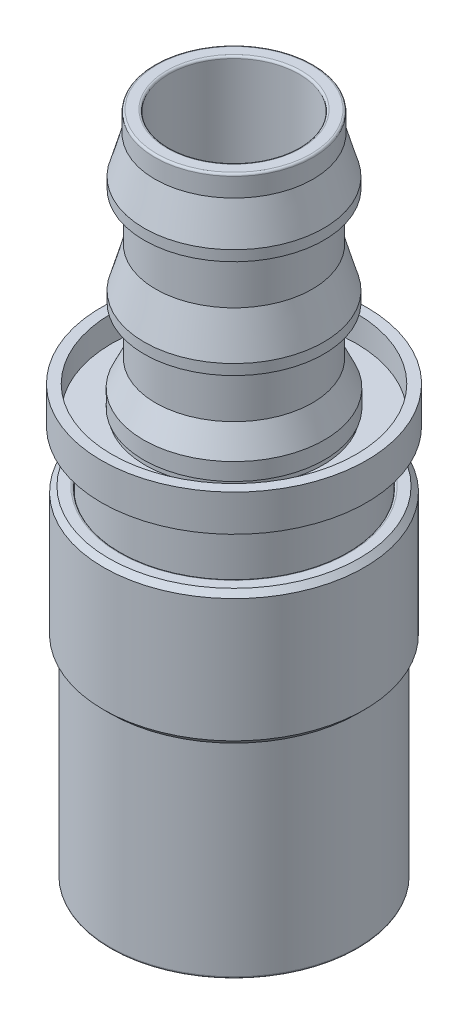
ISO-10303-21;
HEADER;
FILE_DESCRIPTION(('STEP AP214'),'2;1');
FILE_NAME('part.step','',(''),(''),'','','');
FILE_SCHEMA(('AUTOMOTIVE_DESIGN { 1 0 10303 214 1 1 1 1 }'));
ENDSEC;
DATA;
#1=APPLICATION_CONTEXT('core data for automotive mechanical design processes');
#2=APPLICATION_PROTOCOL_DEFINITION('international standard','automotive_design',2000,#1);
#3=PRODUCT_CONTEXT('',#1,'mechanical');
#4=PRODUCT('Part','Part','',(#3));
#5=PRODUCT_RELATED_PRODUCT_CATEGORY('part','',(#4));
#6=PRODUCT_DEFINITION_FORMATION('','',#4);
#7=PRODUCT_DEFINITION_CONTEXT('part definition',#1,'design');
#8=PRODUCT_DEFINITION('design','',#6,#7);
#9=PRODUCT_DEFINITION_SHAPE('','',#8);
#10=(LENGTH_UNIT() NAMED_UNIT(*) SI_UNIT(.MILLI.,.METRE.));
#11=(NAMED_UNIT(*) PLANE_ANGLE_UNIT() SI_UNIT($,.RADIAN.));
#12=(NAMED_UNIT(*) SI_UNIT($,.STERADIAN.) SOLID_ANGLE_UNIT());
#13=UNCERTAINTY_MEASURE_WITH_UNIT(LENGTH_MEASURE(1.E-05),#10,'distance_accuracy_value','');
#14=(GEOMETRIC_REPRESENTATION_CONTEXT(3) GLOBAL_UNCERTAINTY_ASSIGNED_CONTEXT((#13)) GLOBAL_UNIT_ASSIGNED_CONTEXT((#10,
#11,#12)) REPRESENTATION_CONTEXT('',''));
#15=CARTESIAN_POINT('',(0.,0.,0.));
#16=DIRECTION('',(0.,0.,1.));
#17=DIRECTION('',(1.,0.,0.));
#18=AXIS2_PLACEMENT_3D('',#15,#16,#17);
#19=CARTESIAN_POINT('',(0.,17.4498001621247,0.));
#20=DIRECTION('',(0.,1.,0.));
#21=DIRECTION('',(0.,0.,1.));
#22=AXIS2_PLACEMENT_3D('',#19,#20,#21);
#23=CONICAL_SURFACE('',#22,10.4140001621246,0.785398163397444);
#24=CARTESIAN_POINT('',(0.,17.7038,0.));
#25=DIRECTION('',(0.,1.,0.));
#26=DIRECTION('',(1.,0.,0.));
#27=AXIS2_PLACEMENT_3D('',#24,#25,#26);
#28=CIRCLE('',#27,10.668);
#29=CARTESIAN_POINT('',(8.76095107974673,17.7038,-6.08703213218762));
#30=VERTEX_POINT('',#29);
#31=CARTESIAN_POINT('',(0.891048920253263,17.7038,-10.6307222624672));
#32=VERTEX_POINT('',#31);
#33=EDGE_CURVE('P0_E591',#30,#32,#28,.T.);
#34=ORIENTED_EDGE('',*,*,#33,.T.);
#35=CARTESIAN_POINT('',(9.6522,18.1810850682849,-5.57246932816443));
#36=CARTESIAN_POINT('',(9.48625976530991,18.0852929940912,-5.66827496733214));
#37=CARTESIAN_POINT('',(9.31901994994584,17.9924239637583,-5.76483091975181));
#38=CARTESIAN_POINT('',(8.9817388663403,17.8134605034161,-5.95956024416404));
#39=CARTESIAN_POINT('',(8.81169612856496,17.7273697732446,-6.05773446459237));
#40=CARTESIAN_POINT('',(8.46780487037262,17.5625268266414,-6.25628017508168));
#41=CARTESIAN_POINT('',(8.29394013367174,17.4838194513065,-6.35666102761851));
#42=CARTESIAN_POINT('',(7.94335498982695,17.3354526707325,-6.55907145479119));
#43=CARTESIAN_POINT('',(7.76663502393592,17.2657918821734,-6.66110077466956));
#44=CARTESIAN_POINT('',(7.41318080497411,17.1377223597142,-6.86516766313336));
#45=CARTESIAN_POINT('',(7.23648998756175,17.0791547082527,-6.96718015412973));
#46=CARTESIAN_POINT('',(6.88063145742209,16.9731233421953,-7.17263517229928));
#47=CARTESIAN_POINT('',(6.70146401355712,16.925658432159,-7.27607754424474));
#48=CARTESIAN_POINT('',(6.34141858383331,16.8430275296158,-7.48394987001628));
#49=CARTESIAN_POINT('',(6.16054540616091,16.8078338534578,-7.58837704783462));
#50=CARTESIAN_POINT('',(5.79728056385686,16.7505187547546,-7.79810810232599));
#51=CARTESIAN_POINT('',(5.61488913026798,16.7283953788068,-7.90341184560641));
#52=CARTESIAN_POINT('',(5.17041709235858,16.6913007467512,-8.16002789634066));
#53=CARTESIAN_POINT('',(4.90785607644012,16.6835164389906,-8.31161756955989));
#54=CARTESIAN_POINT('',(4.38320889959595,16.6965820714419,-8.61452275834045));
#55=CARTESIAN_POINT('',(4.12112293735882,16.7174420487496,-8.76583815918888));
#56=CARTESIAN_POINT('',(3.59942156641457,16.7865649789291,-9.06704258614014));
#57=CARTESIAN_POINT('',(3.33980925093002,16.8348585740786,-9.21692982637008));
#58=CARTESIAN_POINT('',(2.82504685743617,16.9562236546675,-9.51412803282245));
#59=CARTESIAN_POINT('',(2.56989643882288,17.0292932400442,-9.66143919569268));
#60=CARTESIAN_POINT('',(2.11697001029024,17.1796158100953,-9.9229363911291));
#61=CARTESIAN_POINT('',(1.91819086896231,17.2529145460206,-10.0377015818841));
#62=CARTESIAN_POINT('',(1.52420070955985,17.4113232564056,-10.2651719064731));
#63=CARTESIAN_POINT('',(1.32898979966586,17.4964335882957,-10.3778769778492));
#64=CARTESIAN_POINT('',(0.942750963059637,17.6765577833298,-10.6008720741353));
#65=CARTESIAN_POINT('',(0.751712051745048,17.7715405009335,-10.7111684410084));
#66=CARTESIAN_POINT('',(0.373171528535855,17.9701625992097,-10.9297189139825));
#67=CARTESIAN_POINT('',(0.185667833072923,18.0737966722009,-11.037974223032));
#68=CARTESIAN_POINT('',(-0.000199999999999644,18.1810850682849,-11.1452850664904));
#69=B_SPLINE_CURVE_WITH_KNOTS('',3,(#35,#36,#37,#38,#39,#40,#41,#42,#43,#44,#45,#46,#47,#48,#49,
#50,#51,#52,#53,#54,#55,#56,#57,#58,#59,#60,#61,#62,#63,#64,#65,#66,#67,#68),.UNSPECIFIED.,.F.,
.F.,(4,2,2,2,2,2,2,2,2,2,2,2,2,2,2,2,4),(0.,0.642692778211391,1.28573396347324,1.93245705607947,
2.57908114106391,3.21559379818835,3.85203788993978,4.48703674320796,5.12194066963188,
6.03036042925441,6.93909858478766,7.848853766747,8.75853919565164,9.48105007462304,
10.2035828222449,10.9239015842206,11.6437816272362),.UNSPECIFIED.);
#70=EDGE_CURVE('P0_E390',#30,#32,#69,.T.);
#71=ORIENTED_EDGE('',*,*,#70,.F.);
#72=EDGE_LOOP('',(#34,#71));
#73=FACE_BOUND('',#72,.T.);
#74=ADVANCED_FACE('P0_F43',(#73),#23,.F.);
#75=CARTESIAN_POINT('',(0.,17.7038,0.));
#76=DIRECTION('',(0.,1.,0.));
#77=DIRECTION('',(1.,0.,0.));
#78=AXIS2_PLACEMENT_3D('',#75,#76,#77);
#79=CIRCLE('',#78,10.668);
#80=CARTESIAN_POINT('',(-0.89104892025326,17.7038,-10.6307222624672));
#81=VERTEX_POINT('',#80);
#82=CARTESIAN_POINT('',(-8.76095107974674,17.7038,-6.08703213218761));
#83=VERTEX_POINT('',#82);
#84=EDGE_CURVE('P0_E707',#81,#83,#79,.T.);
#85=ORIENTED_EDGE('',*,*,#84,.T.);
#86=CARTESIAN_POINT('',(0.0002000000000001,18.1810850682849,-11.1452850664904));
#87=CARTESIAN_POINT('',(-0.165740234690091,18.0852929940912,-11.0494794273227));
#88=CARTESIAN_POINT('',(-0.332980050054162,17.9924239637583,-10.952923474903));
#89=CARTESIAN_POINT('',(-0.670261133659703,17.8134605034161,-10.7581941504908));
#90=CARTESIAN_POINT('',(-0.840303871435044,17.7273697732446,-10.6600199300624));
#91=CARTESIAN_POINT('',(-1.18419512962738,17.5625268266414,-10.4614742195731));
#92=CARTESIAN_POINT('',(-1.35805986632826,17.4838194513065,-10.3610933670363));
#93=CARTESIAN_POINT('',(-1.70864501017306,17.3354526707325,-10.1586829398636));
#94=CARTESIAN_POINT('',(-1.88536497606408,17.2657918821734,-10.0566536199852));
#95=CARTESIAN_POINT('',(-2.23881919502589,17.1377223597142,-9.85258673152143));
#96=CARTESIAN_POINT('',(-2.41551001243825,17.0791547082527,-9.75057424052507));
#97=CARTESIAN_POINT('',(-2.77136854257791,16.9731233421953,-9.54511922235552));
#98=CARTESIAN_POINT('',(-2.95053598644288,16.925658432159,-9.44167685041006));
#99=CARTESIAN_POINT('',(-3.31058141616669,16.8430275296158,-9.23380452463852));
#100=CARTESIAN_POINT('',(-3.49145459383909,16.8078338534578,-9.12937734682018));
#101=CARTESIAN_POINT('',(-3.85471943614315,16.7505187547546,-8.9196462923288));
#102=CARTESIAN_POINT('',(-4.03711086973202,16.7283953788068,-8.81434254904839));
#103=CARTESIAN_POINT('',(-4.48158290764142,16.6913007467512,-8.55772649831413));
#104=CARTESIAN_POINT('',(-4.74414392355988,16.6835164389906,-8.40613682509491));
#105=CARTESIAN_POINT('',(-5.26879110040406,16.6965820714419,-8.10323163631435));
#106=CARTESIAN_POINT('',(-5.53087706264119,16.7174420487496,-7.95191623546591));
#107=CARTESIAN_POINT('',(-6.05257843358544,16.7865649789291,-7.65071180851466));
#108=CARTESIAN_POINT('',(-6.31219074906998,16.8348585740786,-7.50082456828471));
#109=CARTESIAN_POINT('',(-6.82695314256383,16.9562236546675,-7.20362636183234));
#110=CARTESIAN_POINT('',(-7.08210356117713,17.0292932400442,-7.05631519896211));
#111=CARTESIAN_POINT('',(-7.53502998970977,17.1796158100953,-6.79481800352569));
#112=CARTESIAN_POINT('',(-7.7338091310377,17.2529145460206,-6.68005281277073));
#113=CARTESIAN_POINT('',(-8.12779929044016,17.4113232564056,-6.45258248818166));
#114=CARTESIAN_POINT('',(-8.32301020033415,17.4964335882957,-6.33987741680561));
#115=CARTESIAN_POINT('',(-8.70924903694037,17.6765577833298,-6.11688232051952));
#116=CARTESIAN_POINT('',(-8.90028794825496,17.7715405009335,-6.00658595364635));
#117=CARTESIAN_POINT('',(-9.27882847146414,17.9701625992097,-5.78803548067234));
#118=CARTESIAN_POINT('',(-9.46633216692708,18.0737966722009,-5.67978017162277));
#119=CARTESIAN_POINT('',(-9.6522,18.1810850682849,-5.57246932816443));
#120=B_SPLINE_CURVE_WITH_KNOTS('',3,(#86,#87,#88,#89,#90,#91,#92,#93,#94,#95,#96,#97,#98,#99,
#100,#101,#102,#103,#104,#105,#106,#107,#108,#109,#110,#111,#112,#113,#114,#115,#116,#117,#118,
#119),.UNSPECIFIED.,.F.,.F.,(4,2,2,2,2,2,2,2,2,2,2,2,2,2,2,2,4),(0.,0.642692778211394,
1.28573396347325,1.93245705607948,2.57908114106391,3.21559379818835,3.85203788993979,
4.48703674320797,5.12194066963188,6.03036042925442,6.93909858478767,7.84885376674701,
8.75853919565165,9.48105007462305,10.2035828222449,10.9239015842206,11.6437816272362),.UNSPECIFIED.);
#121=EDGE_CURVE('P0_E407',#81,#83,#120,.T.);
#122=ORIENTED_EDGE('',*,*,#121,.F.);
#123=EDGE_LOOP('',(#85,#122));
#124=FACE_BOUND('',#123,.T.);
#125=ADVANCED_FACE('P0_F540',(#124),#23,.F.);
#126=CARTESIAN_POINT('',(-9.652,17.7038,-4.54369013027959));
#127=VERTEX_POINT('',#126);
#128=CARTESIAN_POINT('',(-9.652,17.7038,4.54369013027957));
#129=VERTEX_POINT('',#128);
#130=EDGE_CURVE('P0_E1594',#127,#129,#79,.T.);
#131=ORIENTED_EDGE('',*,*,#130,.T.);
#132=CARTESIAN_POINT('',(-9.652,87.9369515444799,-80.3233167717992));
#133=CARTESIAN_POINT('',(-9.652,86.7398887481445,-79.1176396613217));
#134=CARTESIAN_POINT('',(-9.652,85.5430161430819,-77.911773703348));
#135=CARTESIAN_POINT('',(-9.652,83.14971459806,-75.4996002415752));
#136=CARTESIAN_POINT('',(-9.652,81.953285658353,-74.2932927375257));
#137=CARTESIAN_POINT('',(-9.652,78.364212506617,-70.6730606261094));
#138=CARTESIAN_POINT('',(-9.652,75.9723312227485,-68.2583795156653));
#139=CARTESIAN_POINT('',(-9.652,71.1801790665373,-63.4150205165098));
#140=CARTESIAN_POINT('',(-9.652,68.7799210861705,-60.9863298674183));
#141=CARTESIAN_POINT('',(-9.652,65.1827743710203,-57.340633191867));
#142=CARTESIAN_POINT('',(-9.652,63.9843994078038,-56.1250936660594));
#143=CARTESIAN_POINT('',(-9.652,61.5888642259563,-53.6928309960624));
#144=CARTESIAN_POINT('',(-9.652,60.3917040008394,-52.4761078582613));
#145=CARTESIAN_POINT('',(-9.652,57.6171506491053,-49.6527999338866));
#146=CARTESIAN_POINT('',(-9.652,56.040302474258,-48.0456793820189));
#147=CARTESIAN_POINT('',(-9.652,52.889997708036,-44.8280444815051));
#148=CARTESIAN_POINT('',(-9.652,51.3165411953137,-43.2175300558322));
#149=CARTESIAN_POINT('',(-9.652,48.1731326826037,-39.9906602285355));
#150=CARTESIAN_POINT('',(-9.652,46.6031843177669,-38.3743012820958));
#151=CARTESIAN_POINT('',(-9.652,44.2534487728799,-35.9448762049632));
#152=CARTESIAN_POINT('',(-9.652,43.4711005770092,-35.1342872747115));
#153=CARTESIAN_POINT('',(-9.652,41.9085064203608,-33.5110872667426));
#154=CARTESIAN_POINT('',(-9.652,41.1282604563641,-32.6984761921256));
#155=CARTESIAN_POINT('',(-9.652,39.5732230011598,-31.0737509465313));
#156=CARTESIAN_POINT('',(-9.652,38.7984220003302,-30.2616458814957));
#157=CARTESIAN_POINT('',(-9.652,37.2520677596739,-28.6343502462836));
#158=CARTESIAN_POINT('',(-9.652,36.4805145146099,-27.8191596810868));
#159=CARTESIAN_POINT('',(-9.652,34.9413105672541,-26.1845800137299));
#160=CARTESIAN_POINT('',(-9.652,34.1736612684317,-25.3651895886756));
#161=CARTESIAN_POINT('',(-9.652,32.6438478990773,-23.7213311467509));
#162=CARTESIAN_POINT('',(-9.652,31.8816837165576,-22.8968632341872));
#163=CARTESIAN_POINT('',(-9.652,30.3658261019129,-21.2423921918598));
#164=CARTESIAN_POINT('',(-9.652,29.6121218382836,-20.4123990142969));
#165=CARTESIAN_POINT('',(-9.652,28.489242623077,-19.1604502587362));
#166=CARTESIAN_POINT('',(-9.652,28.1162111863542,-18.7419537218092));
#167=CARTESIAN_POINT('',(-9.652,27.3732525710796,-17.9022139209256));
#168=CARTESIAN_POINT('',(-9.652,27.0033253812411,-17.4809706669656));
#169=CARTESIAN_POINT('',(-9.652,26.2674435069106,-16.635453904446));
#170=CARTESIAN_POINT('',(-9.652,25.9014866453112,-16.2111822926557));
#171=CARTESIAN_POINT('',(-9.652,25.1741819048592,-15.3586874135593));
#172=CARTESIAN_POINT('',(-9.652,24.8128341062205,-14.9304640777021));
#173=CARTESIAN_POINT('',(-9.652,24.0959613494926,-14.0692905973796));
#174=CARTESIAN_POINT('',(-9.652,23.7404353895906,-13.6363412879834));
#175=CARTESIAN_POINT('',(-9.652,23.0366929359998,-12.7645520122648));
#176=CARTESIAN_POINT('',(-9.652,22.6884760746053,-12.3257123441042));
#177=CARTESIAN_POINT('',(-9.652,22.2294445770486,-11.7343291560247));
#178=CARTESIAN_POINT('',(-9.652,22.1144272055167,-11.585042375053));
#179=CARTESIAN_POINT('',(-9.652,21.8855703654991,-11.2855624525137));
#180=CARTESIAN_POINT('',(-9.652,21.7717309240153,-11.1353692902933));
#181=CARTESIAN_POINT('',(-9.652,21.5453413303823,-10.834001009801));
#182=CARTESIAN_POINT('',(-9.652,21.4327912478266,-10.6828258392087));
#183=CARTESIAN_POINT('',(-9.652,21.2091210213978,-10.3794230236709));
#184=CARTESIAN_POINT('',(-9.652,21.0980008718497,-10.2271953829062));
#185=CARTESIAN_POINT('',(-9.652,20.7667984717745,-9.76852423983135));
#186=CARTESIAN_POINT('',(-9.652,20.5490797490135,-9.46036505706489));
#187=CARTESIAN_POINT('',(-9.652,20.1213989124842,-8.83870404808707));
#188=CARTESIAN_POINT('',(-9.652,19.9114366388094,-8.52520233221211));
#189=CARTESIAN_POINT('',(-9.652,19.5035848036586,-7.89565641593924));
#190=CARTESIAN_POINT('',(-9.652,19.3055819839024,-7.57968591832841));
#191=CARTESIAN_POINT('',(-9.652,18.9213821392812,-6.94054823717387));
#192=CARTESIAN_POINT('',(-9.652,18.7351866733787,-6.61738011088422));
#193=CARTESIAN_POINT('',(-9.652,18.3780489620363,-5.96326203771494));
#194=CARTESIAN_POINT('',(-9.652,18.2070853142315,-5.63232386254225));
#195=CARTESIAN_POINT('',(-9.652,17.8842718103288,-4.96131988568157));
#196=CARTESIAN_POINT('',(-9.652,17.7324138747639,-4.6212580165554));
#197=CARTESIAN_POINT('',(-9.652,17.4670393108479,-3.96610458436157));
#198=CARTESIAN_POINT('',(-9.652,17.3511987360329,-3.65196329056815));
#199=CARTESIAN_POINT('',(-9.652,17.1435041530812,-3.01577363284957));
#200=CARTESIAN_POINT('',(-9.652,17.0516474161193,-2.69372617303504));
#201=CARTESIAN_POINT('',(-9.652,16.8970427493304,-2.04487103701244));
#202=CARTESIAN_POINT('',(-9.652,16.8341049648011,-1.71810936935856));
#203=CARTESIAN_POINT('',(-9.652,16.740368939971,-1.05996092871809));
#204=CARTESIAN_POINT('',(-9.652,16.7095664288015,-0.728574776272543));
#205=CARTESIAN_POINT('',(-9.652,16.6821903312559,-0.061392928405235));
#206=CARTESIAN_POINT('',(-9.652,16.6859247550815,0.274415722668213));
#207=CARTESIAN_POINT('',(-9.652,16.7280774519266,0.943823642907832));
#208=CARTESIAN_POINT('',(-9.652,16.766498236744,1.27742275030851));
#209=CARTESIAN_POINT('',(-9.652,16.8755723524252,1.94110296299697));
#210=CARTESIAN_POINT('',(-9.652,16.9464030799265,2.27115433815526));
#211=CARTESIAN_POINT('',(-9.652,17.1160280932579,2.92393132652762));
#212=CARTESIAN_POINT('',(-9.652,17.2148275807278,3.24665556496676));
#213=CARTESIAN_POINT('',(-9.652,17.4333868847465,3.87743604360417));
#214=CARTESIAN_POINT('',(-9.652,17.552677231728,4.18565725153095));
#215=CARTESIAN_POINT('',(-9.652,17.8094679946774,4.79448194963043));
#216=CARTESIAN_POINT('',(-9.652,17.9469754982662,5.09508242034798));
#217=CARTESIAN_POINT('',(-9.652,18.2368764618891,5.6895024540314));
#218=CARTESIAN_POINT('',(-9.652,18.3892913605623,5.9833114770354));
#219=CARTESIAN_POINT('',(-9.652,18.7059732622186,6.56438618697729));
#220=CARTESIAN_POINT('',(-9.652,18.8702388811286,6.85165263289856));
#221=CARTESIAN_POINT('',(-9.652,19.2095689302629,7.42243678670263));
#222=CARTESIAN_POINT('',(-9.652,19.3847009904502,7.70591409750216));
#223=CARTESIAN_POINT('',(-9.652,19.7429104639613,8.26779223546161));
#224=CARTESIAN_POINT('',(-9.652,19.9259880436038,8.54619295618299));
#225=CARTESIAN_POINT('',(-9.652,20.2984926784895,9.09831763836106));
#226=CARTESIAN_POINT('',(-9.652,20.4879135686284,9.37204577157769));
#227=CARTESIAN_POINT('',(-9.652,20.8721497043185,9.9156656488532));
#228=CARTESIAN_POINT('',(-9.652,21.0669647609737,10.1855575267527));
#229=CARTESIAN_POINT('',(-9.652,21.4807665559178,10.7487676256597));
#230=CARTESIAN_POINT('',(-9.652,21.7002262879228,11.0417377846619));
#231=CARTESIAN_POINT('',(-9.652,22.1436839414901,11.624228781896));
#232=CARTESIAN_POINT('',(-9.652,22.367681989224,11.9137495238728));
#233=CARTESIAN_POINT('',(-9.652,22.8195039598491,12.4898418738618));
#234=CARTESIAN_POINT('',(-9.652,23.0473283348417,12.7764131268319));
#235=CARTESIAN_POINT('',(-9.652,23.5061969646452,13.3469682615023));
#236=CARTESIAN_POINT('',(-9.652,23.7372412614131,13.6309521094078));
#237=CARTESIAN_POINT('',(-9.652,24.4346920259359,14.4798058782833));
#238=CARTESIAN_POINT('',(-9.652,24.9052013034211,15.0413057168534));
#239=CARTESIAN_POINT('',(-9.652,25.8542868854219,16.1573596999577));
#240=CARTESIAN_POINT('',(-9.652,26.3328627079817,16.7119142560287));
#241=CARTESIAN_POINT('',(-9.652,27.2970323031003,17.81654195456));
#242=CARTESIAN_POINT('',(-9.652,27.7826366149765,18.3666058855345));
#243=CARTESIAN_POINT('',(-9.652,28.7587048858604,19.4624111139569));
#244=CARTESIAN_POINT('',(-9.652,29.2491689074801,20.0081523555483));
#245=CARTESIAN_POINT('',(-9.652,30.233818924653,21.0959803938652));
#246=CARTESIAN_POINT('',(-9.652,30.728003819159,21.638068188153));
#247=CARTESIAN_POINT('',(-9.652,31.7194969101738,22.7193816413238));
#248=CARTESIAN_POINT('',(-9.652,32.2168051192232,23.2586072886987));
#249=CARTESIAN_POINT('',(-9.652,33.2122364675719,24.3328036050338));
#250=CARTESIAN_POINT('',(-9.652,33.7103506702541,24.8677825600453));
#251=CARTESIAN_POINT('',(-9.652,34.7086941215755,25.9357639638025));
#252=CARTESIAN_POINT('',(-9.652,35.2089233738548,26.4687664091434));
#253=CARTESIAN_POINT('',(-9.652,36.7123238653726,28.0653506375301));
#254=CARTESIAN_POINT('',(-9.652,37.7181427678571,29.1264392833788));
#255=CARTESIAN_POINT('',(-9.652,39.7339186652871,31.2427455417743));
#256=CARTESIAN_POINT('',(-9.652,40.7438708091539,32.2979677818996));
#257=CARTESIAN_POINT('',(-9.652,42.7675769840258,34.4047161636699));
#258=CARTESIAN_POINT('',(-9.652,43.7813309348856,35.456242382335));
#259=CARTESIAN_POINT('',(-9.652,45.6867231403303,37.4271027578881));
#260=CARTESIAN_POINT('',(-9.652,46.5780218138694,38.3467654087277));
#261=CARTESIAN_POINT('',(-9.652,48.3624509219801,40.184312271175));
#262=CARTESIAN_POINT('',(-9.652,49.2555813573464,41.1021964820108));
#263=CARTESIAN_POINT('',(-9.652,51.937218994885,43.8536873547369));
#264=CARTESIAN_POINT('',(-9.652,53.727958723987,45.6851180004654));
#265=CARTESIAN_POINT('',(-9.652,57.3142352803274,49.3446230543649));
#266=CARTESIAN_POINT('',(-9.652,59.1097736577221,51.1726959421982));
#267=CARTESIAN_POINT('',(-9.652,62.7038474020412,54.8258827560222));
#268=CARTESIAN_POINT('',(-9.652,64.5023827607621,56.6509966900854));
#269=CARTESIAN_POINT('',(-9.652,68.1020077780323,60.299326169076));
#270=CARTESIAN_POINT('',(-9.652,69.9030978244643,62.1225413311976));
#271=CARTESIAN_POINT('',(-9.652,73.5070034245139,65.7672686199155));
#272=CARTESIAN_POINT('',(-9.652,75.3098189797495,67.5887807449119));
#273=CARTESIAN_POINT('',(-9.652,78.9160749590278,71.2297399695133));
#274=CARTESIAN_POINT('',(-9.652,80.7195148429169,73.0491876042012));
#275=CARTESIAN_POINT('',(-9.652,84.3274816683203,76.6870001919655));
#276=CARTESIAN_POINT('',(-9.652,86.132008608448,78.5053651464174));
#277=CARTESIAN_POINT('',(-9.652,87.9369515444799,80.3233167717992));
#278=B_SPLINE_CURVE_WITH_KNOTS('',3,(#132,#133,#134,#135,#136,#137,#138,#139,#140,#141,#142,
#143,#144,#145,#146,#147,#148,#149,#150,#151,#152,#153,#154,#155,#156,#157,#158,#159,#160,#161,
#162,#163,#164,#165,#166,#167,#168,#169,#170,#171,#172,#173,#174,#175,#176,#177,#178,#179,#180,
#181,#182,#183,#184,#185,#186,#187,#188,#189,#190,#191,#192,#193,#194,#195,#196,#197,#198,#199,
#200,#201,#202,#203,#204,#205,#206,#207,#208,#209,#210,#211,#212,#213,#214,#215,#216,#217,#218,
#219,#220,#221,#222,#223,#224,#225,#226,#227,#228,#229,#230,#231,#232,#233,#234,#235,#236,#237,
#238,#239,#240,#241,#242,#243,#244,#245,#246,#247,#248,#249,#250,#251,#252,#253,#254,#255,#256,
#257,#258,#259,#260,#261,#262,#263,#264,#265,#266,#267,#268,#269,#270,#271,#272,#273,#274,#275,
#276,#277),.UNSPECIFIED.,.F.,.F.,(4,2,2,2,2,2,2,2,2,2,2,2,2,2,2,2,2,2,2,2,2,2,2,2,2,2,2,2,2,2,2,
2,2,2,2,2,2,2,2,2,2,2,2,2,2,2,2,2,2,2,2,2,2,2,2,2,2,2,2,2,2,2,2,2,2,2,2,2,2,2,2,2,4),(0.,
5.09701378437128,10.1940304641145,20.3904022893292,30.6343231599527,35.755137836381,
40.8759250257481,47.6304439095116,54.3851177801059,61.1449970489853,64.5246550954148,
67.9043079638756,71.2715670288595,74.6388206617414,78.0072095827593,81.3755295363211,
84.738883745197,86.4207238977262,88.1025579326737,89.7834176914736,91.4643066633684,
93.1449032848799,94.8254151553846,95.3907776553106,95.9561530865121,96.521558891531,
97.0869624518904,98.2187933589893,99.3506009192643,100.469047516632,101.587641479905,
102.704638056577,103.821160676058,104.824830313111,105.828385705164,106.825255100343,
107.821991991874,108.827626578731,109.833333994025,110.84461326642,111.856080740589,
112.846883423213,113.838072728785,114.830709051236,115.823229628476,116.822708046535,
117.822207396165,118.820762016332,119.819281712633,120.917384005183,122.015516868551,
123.113780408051,124.212058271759,126.409654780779,128.607120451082,130.808318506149,
133.009544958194,135.210143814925,137.410751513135,139.603661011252,141.796574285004,
146.182687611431,150.56462533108,154.946471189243,158.78856858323,162.630667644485,
170.314925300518,178.002071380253,185.689196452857,193.377650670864,201.066112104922,
208.751491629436,216.436861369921),.UNSPECIFIED.);
#279=EDGE_CURVE('P0_E423',#127,#129,#278,.T.);
#280=ORIENTED_EDGE('',*,*,#279,.F.);
#281=EDGE_LOOP('',(#131,#280));
#282=FACE_BOUND('',#281,.T.);
#283=ADVANCED_FACE('P0_F548',(#282),#23,.F.);
#284=CARTESIAN_POINT('',(-8.76095107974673,17.7038,6.08703213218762));
#285=VERTEX_POINT('',#284);
#286=CARTESIAN_POINT('',(-0.891048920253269,17.7038,10.6307222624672));
#287=VERTEX_POINT('',#286);
#288=EDGE_CURVE('P0_E708',#285,#287,#79,.T.);
#289=ORIENTED_EDGE('',*,*,#288,.T.);
#290=CARTESIAN_POINT('',(-9.6522,18.1810850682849,5.57246932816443));
#291=CARTESIAN_POINT('',(-9.48625976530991,18.0852929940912,5.66827496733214));
#292=CARTESIAN_POINT('',(-9.31901994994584,17.9924239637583,5.76483091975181));
#293=CARTESIAN_POINT('',(-8.9817388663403,17.8134605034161,5.95956024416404));
#294=CARTESIAN_POINT('',(-8.81169612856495,17.7273697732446,6.05773446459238));
#295=CARTESIAN_POINT('',(-8.46780487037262,17.5625268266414,6.25628017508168));
#296=CARTESIAN_POINT('',(-8.29394013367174,17.4838194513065,6.35666102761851));
#297=CARTESIAN_POINT('',(-7.94335498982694,17.3354526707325,6.55907145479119));
#298=CARTESIAN_POINT('',(-7.76663502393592,17.2657918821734,6.66110077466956));
#299=CARTESIAN_POINT('',(-7.41318080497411,17.1377223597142,6.86516766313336));
#300=CARTESIAN_POINT('',(-7.23648998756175,17.0791547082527,6.96718015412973));
#301=CARTESIAN_POINT('',(-6.88063145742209,16.9731233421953,7.17263517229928));
#302=CARTESIAN_POINT('',(-6.70146401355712,16.925658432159,7.27607754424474));
#303=CARTESIAN_POINT('',(-6.34141858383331,16.8430275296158,7.48394987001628));
#304=CARTESIAN_POINT('',(-6.16054540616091,16.8078338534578,7.58837704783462));
#305=CARTESIAN_POINT('',(-5.79728056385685,16.7505187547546,7.79810810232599));
#306=CARTESIAN_POINT('',(-5.61488913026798,16.7283953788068,7.90341184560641));
#307=CARTESIAN_POINT('',(-5.17041709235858,16.6913007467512,8.16002789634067));
#308=CARTESIAN_POINT('',(-4.90785607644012,16.6835164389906,8.31161756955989));
#309=CARTESIAN_POINT('',(-4.38320889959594,16.6965820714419,8.61452275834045));
#310=CARTESIAN_POINT('',(-4.12112293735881,16.7174420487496,8.76583815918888));
#311=CARTESIAN_POINT('',(-3.59942156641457,16.7865649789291,9.06704258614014));
#312=CARTESIAN_POINT('',(-3.33980925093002,16.8348585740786,9.21692982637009));
#313=CARTESIAN_POINT('',(-2.82504685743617,16.9562236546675,9.51412803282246));
#314=CARTESIAN_POINT('',(-2.56989643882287,17.0292932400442,9.66143919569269));
#315=CARTESIAN_POINT('',(-2.11697001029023,17.1796158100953,9.9229363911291));
#316=CARTESIAN_POINT('',(-1.9181908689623,17.2529145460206,10.0377015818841));
#317=CARTESIAN_POINT('',(-1.52420070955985,17.4113232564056,10.2651719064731));
#318=CARTESIAN_POINT('',(-1.32898979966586,17.4964335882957,10.3778769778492));
#319=CARTESIAN_POINT('',(-0.942750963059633,17.6765577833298,10.6008720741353));
#320=CARTESIAN_POINT('',(-0.751712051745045,17.7715405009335,10.7111684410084));
#321=CARTESIAN_POINT('',(-0.373171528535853,17.9701625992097,10.9297189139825));
#322=CARTESIAN_POINT('',(-0.185667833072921,18.0737966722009,11.037974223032));
#323=CARTESIAN_POINT('',(0.000200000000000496,18.1810850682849,11.1452850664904));
#324=B_SPLINE_CURVE_WITH_KNOTS('',3,(#290,#291,#292,#293,#294,#295,#296,#297,#298,#299,#300,
#301,#302,#303,#304,#305,#306,#307,#308,#309,#310,#311,#312,#313,#314,#315,#316,#317,#318,#319,
#320,#321,#322,#323),.UNSPECIFIED.,.F.,.F.,(4,2,2,2,2,2,2,2,2,2,2,2,2,2,2,2,4),(0.,
0.642692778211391,1.28573396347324,1.93245705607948,2.57908114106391,3.21559379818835,
3.85203788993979,4.48703674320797,5.12194066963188,6.03036042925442,6.93909858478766,
7.84885376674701,8.75853919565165,9.48105007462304,10.2035828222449,10.9239015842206,
11.6437816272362),.UNSPECIFIED.);
#325=EDGE_CURVE('P0_E439',#285,#287,#324,.T.);
#326=ORIENTED_EDGE('',*,*,#325,.F.);
#327=EDGE_LOOP('',(#289,#326));
#328=FACE_BOUND('',#327,.T.);
#329=ADVANCED_FACE('P0_F570',(#328),#23,.F.);
#330=CARTESIAN_POINT('',(0.891048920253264,17.7038,10.6307222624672));
#331=VERTEX_POINT('',#330);
#332=CARTESIAN_POINT('',(8.76095107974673,17.7038,6.08703213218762));
#333=VERTEX_POINT('',#332);
#334=EDGE_CURVE('P0_E581',#331,#333,#28,.T.);
#335=ORIENTED_EDGE('',*,*,#334,.T.);
#336=CARTESIAN_POINT('',(-0.000199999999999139,18.1810850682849,11.1452850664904));
#337=CARTESIAN_POINT('',(0.165740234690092,18.0852929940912,11.0494794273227));
#338=CARTESIAN_POINT('',(0.332980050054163,17.9924239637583,10.952923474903));
#339=CARTESIAN_POINT('',(0.670261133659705,17.8134605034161,10.7581941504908));
#340=CARTESIAN_POINT('',(0.840303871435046,17.7273697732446,10.6600199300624));
#341=CARTESIAN_POINT('',(1.18419512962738,17.5625268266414,10.4614742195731));
#342=CARTESIAN_POINT('',(1.35805986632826,17.4838194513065,10.3610933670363));
#343=CARTESIAN_POINT('',(1.70864501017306,17.3354526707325,10.1586829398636));
#344=CARTESIAN_POINT('',(1.88536497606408,17.2657918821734,10.0566536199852));
#345=CARTESIAN_POINT('',(2.23881919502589,17.1377223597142,9.85258673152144));
#346=CARTESIAN_POINT('',(2.41551001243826,17.0791547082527,9.75057424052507));
#347=CARTESIAN_POINT('',(2.77136854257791,16.9731233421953,9.54511922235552));
#348=CARTESIAN_POINT('',(2.95053598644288,16.925658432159,9.44167685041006));
#349=CARTESIAN_POINT('',(3.3105814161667,16.8430275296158,9.23380452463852));
#350=CARTESIAN_POINT('',(3.4914545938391,16.8078338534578,9.12937734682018));
#351=CARTESIAN_POINT('',(3.85471943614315,16.7505187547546,8.9196462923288));
#352=CARTESIAN_POINT('',(4.03711086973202,16.7283953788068,8.81434254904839));
#353=CARTESIAN_POINT('',(4.48158290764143,16.6913007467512,8.55772649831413));
#354=CARTESIAN_POINT('',(4.74414392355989,16.6835164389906,8.40613682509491));
#355=CARTESIAN_POINT('',(5.26879110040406,16.6965820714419,8.10323163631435));
#356=CARTESIAN_POINT('',(5.53087706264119,16.7174420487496,7.95191623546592));
#357=CARTESIAN_POINT('',(6.05257843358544,16.7865649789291,7.65071180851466));
#358=CARTESIAN_POINT('',(6.31219074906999,16.8348585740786,7.50082456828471));
#359=CARTESIAN_POINT('',(6.82695314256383,16.9562236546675,7.20362636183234));
#360=CARTESIAN_POINT('',(7.08210356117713,17.0292932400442,7.05631519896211));
#361=CARTESIAN_POINT('',(7.53502998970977,17.1796158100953,6.7948180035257));
#362=CARTESIAN_POINT('',(7.7338091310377,17.2529145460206,6.68005281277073));
#363=CARTESIAN_POINT('',(8.12779929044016,17.4113232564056,6.45258248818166));
#364=CARTESIAN_POINT('',(8.32301020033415,17.4964335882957,6.33987741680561));
#365=CARTESIAN_POINT('',(8.70924903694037,17.6765577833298,6.11688232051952));
#366=CARTESIAN_POINT('',(8.90028794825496,17.7715405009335,6.00658595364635));
#367=CARTESIAN_POINT('',(9.27882847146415,17.9701625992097,5.78803548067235));
#368=CARTESIAN_POINT('',(9.46633216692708,18.073796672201,5.67978017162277));
#369=CARTESIAN_POINT('',(9.6522,18.1810850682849,5.57246932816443));
#370=B_SPLINE_CURVE_WITH_KNOTS('',3,(#336,#337,#338,#339,#340,#341,#342,#343,#344,#345,#346,
#347,#348,#349,#350,#351,#352,#353,#354,#355,#356,#357,#358,#359,#360,#361,#362,#363,#364,#365,
#366,#367,#368,#369),.UNSPECIFIED.,.F.,.F.,(4,2,2,2,2,2,2,2,2,2,2,2,2,2,2,2,4),(0.,
0.642692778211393,1.28573396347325,1.93245705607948,2.57908114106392,3.21559379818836,
3.85203788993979,4.48703674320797,5.12194066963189,6.03036042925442,6.93909858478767,
7.84885376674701,8.75853919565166,9.48105007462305,10.2035828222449,10.9239015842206,
11.6437816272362),.UNSPECIFIED.);
#371=EDGE_CURVE('P0_E359',#331,#333,#370,.T.);
#372=ORIENTED_EDGE('',*,*,#371,.F.);
#373=EDGE_LOOP('',(#335,#372));
#374=FACE_BOUND('',#373,.T.);
#375=ADVANCED_FACE('P0_F556',(#374),#23,.F.);
#376=CARTESIAN_POINT('',(0.,80.6958,0.));
#377=DIRECTION('',(0.,1.,0.));
#378=DIRECTION('',(0.,0.,1.));
#379=AXIS2_PLACEMENT_3D('',#376,#377,#378);
#380=TOROIDAL_SURFACE('',#379,8.1788,0.254);
#381=CARTESIAN_POINT('',(0.,80.6958,0.));
#382=DIRECTION('',(0.,-1.,0.));
#383=DIRECTION('',(0.,0.,-1.));
#384=AXIS2_PLACEMENT_3D('',#381,#382,#383);
#385=CIRCLE('',#384,7.9248);
#386=CARTESIAN_POINT('',(0.,80.6958,7.9248));
#387=VERTEX_POINT('',#386);
#388=CARTESIAN_POINT('',(0.,80.6958,-7.9248));
#389=VERTEX_POINT('',#388);
#390=EDGE_CURVE('P0_E11',#387,#389,#385,.T.);
#391=ORIENTED_EDGE('',*,*,#390,.T.);
#392=CARTESIAN_POINT('',(0.,80.6958,-8.1788));
#393=DIRECTION('',(-1.,0.,0.));
#394=DIRECTION('',(0.,0.,-1.));
#395=AXIS2_PLACEMENT_3D('',#392,#393,#394);
#396=CIRCLE('',#395,0.254);
#397=CARTESIAN_POINT('',(0.,80.9498,-8.1788));
#398=VERTEX_POINT('',#397);
#399=EDGE_CURVE('P0_E53',#389,#398,#396,.T.);
#400=ORIENTED_EDGE('',*,*,#399,.T.);
#401=CARTESIAN_POINT('',(0.,80.9498,0.));
#402=DIRECTION('',(0.,1.,0.));
#403=DIRECTION('',(0.,0.,-1.));
#404=AXIS2_PLACEMENT_3D('',#401,#402,#403);
#405=CIRCLE('',#404,8.1788);
#406=CARTESIAN_POINT('',(0.,80.9498,8.1788));
#407=VERTEX_POINT('',#406);
#408=EDGE_CURVE('P0_E635',#398,#407,#405,.T.);
#409=ORIENTED_EDGE('',*,*,#408,.T.);
#410=CARTESIAN_POINT('',(0.,80.9498,0.));
#411=DIRECTION('',(0.,1.,0.));
#412=DIRECTION('',(0.,0.,-1.));
#413=AXIS2_PLACEMENT_3D('',#410,#411,#412);
#414=CIRCLE('',#413,8.1788);
#415=EDGE_CURVE('P0_E631',#407,#398,#414,.T.);
#416=ORIENTED_EDGE('',*,*,#415,.T.);
#417=ORIENTED_EDGE('',*,*,#399,.F.);
#418=CARTESIAN_POINT('',(0.,80.6958,0.));
#419=DIRECTION('',(0.,-1.,0.));
#420=DIRECTION('',(0.,0.,-1.));
#421=AXIS2_PLACEMENT_3D('',#418,#419,#420);
#422=CIRCLE('',#421,7.9248);
#423=EDGE_CURVE('P0_E636',#389,#387,#422,.T.);
#424=ORIENTED_EDGE('',*,*,#423,.T.);
#425=EDGE_LOOP('',(#391,#400,#409,#416,#417,#424));
#426=FACE_BOUND('',#425,.T.);
#427=ADVANCED_FACE('P0_F569',(#426),#380,.T.);
#428=CARTESIAN_POINT('',(0.,80.9498,7.9248));
#429=DIRECTION('',(0.,1.,0.));
#430=DIRECTION('',(1.,0.,0.));
#431=AXIS2_PLACEMENT_3D('',#428,#429,#430);
#432=PLANE('',#431);
#433=CARTESIAN_POINT('',(0.,80.9498,0.));
#434=DIRECTION('',(0.,-1.,0.));
#435=DIRECTION('',(0.,0.,-1.));
#436=AXIS2_PLACEMENT_3D('',#433,#434,#435);
#437=CIRCLE('',#436,9.37286457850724);
#438=CARTESIAN_POINT('',(0.,80.9498,9.37286457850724));
#439=VERTEX_POINT('',#438);
#440=CARTESIAN_POINT('',(0.,80.9498,-9.37286457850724));
#441=VERTEX_POINT('',#440);
#442=EDGE_CURVE('P0_E677',#439,#441,#437,.T.);
#443=ORIENTED_EDGE('',*,*,#442,.F.);
#444=CARTESIAN_POINT('',(0.,80.9498,0.));
#445=DIRECTION('',(0.,-1.,0.));
#446=DIRECTION('',(0.,0.,-1.));
#447=AXIS2_PLACEMENT_3D('',#444,#445,#446);
#448=CIRCLE('',#447,9.37286457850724);
#449=EDGE_CURVE('P0_E594',#441,#439,#448,.T.);
#450=ORIENTED_EDGE('',*,*,#449,.F.);
#451=EDGE_LOOP('',(#443,#450));
#452=FACE_BOUND('',#451,.T.);
#453=ORIENTED_EDGE('',*,*,#415,.F.);
#454=ORIENTED_EDGE('',*,*,#408,.F.);
#455=EDGE_LOOP('',(#453,#454));
#456=FACE_BOUND('',#455,.T.);
#457=ADVANCED_FACE('P0_F576',(#452,#456),#432,.T.);
#458=CARTESIAN_POINT('',(0.,52.4637,0.));
#459=DIRECTION('',(0.,1.,0.));
#460=DIRECTION('',(0.,0.,1.));
#461=AXIS2_PLACEMENT_3D('',#458,#459,#460);
#462=CYLINDRICAL_SURFACE('',#461,7.9248);
#463=ORIENTED_EDGE('',*,*,#390,.F.);
#464=ORIENTED_EDGE('',*,*,#423,.F.);
#465=DIRECTION('',(0.,-1.,0.));
#466=VECTOR('',#465,1.);
#467=CARTESIAN_POINT('',(0.,52.4637,-7.9248));
#468=LINE('',#467,#466);
#469=CARTESIAN_POINT('',(0.,23.9776,-7.9248));
#470=VERTEX_POINT('',#469);
#471=EDGE_CURVE('P0_E673',#389,#470,#468,.T.);
#472=ORIENTED_EDGE('',*,*,#471,.T.);
#473=CARTESIAN_POINT('',(0.,23.9776,0.));
#474=DIRECTION('',(0.,1.,0.));
#475=DIRECTION('',(1.,0.,0.));
#476=AXIS2_PLACEMENT_3D('',#473,#474,#475);
#477=CIRCLE('',#476,7.9248);
#478=CARTESIAN_POINT('',(0.,23.9776,7.9248));
#479=VERTEX_POINT('',#478);
#480=EDGE_CURVE('P0_E629',#479,#470,#477,.T.);
#481=ORIENTED_EDGE('',*,*,#480,.F.);
#482=CARTESIAN_POINT('',(0.,23.9776,0.));
#483=DIRECTION('',(0.,1.,0.));
#484=DIRECTION('',(1.,0.,0.));
#485=AXIS2_PLACEMENT_3D('',#482,#483,#484);
#486=CIRCLE('',#485,7.9248);
#487=EDGE_CURVE('P0_E827',#470,#479,#486,.T.);
#488=ORIENTED_EDGE('',*,*,#487,.F.);
#489=ORIENTED_EDGE('',*,*,#471,.F.);
#490=EDGE_LOOP('',(#463,#464,#472,#481,#488,#489));
#491=FACE_BOUND('',#490,.T.);
#492=ADVANCED_FACE('P0_F943',(#491),#462,.F.);
#493=CARTESIAN_POINT('',(0.,80.6958,0.));
#494=DIRECTION('',(0.,1.,0.));
#495=DIRECTION('',(0.,0.,1.));
#496=AXIS2_PLACEMENT_3D('',#493,#494,#495);
#497=TOROIDAL_SURFACE('',#496,9.37286457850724,0.254);
#498=ORIENTED_EDGE('',*,*,#442,.T.);
#499=CARTESIAN_POINT('',(0.,80.6958,-9.37286457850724));
#500=DIRECTION('',(-1.,0.,0.));
#501=DIRECTION('',(0.,0.,-1.));
#502=AXIS2_PLACEMENT_3D('',#499,#500,#501);
#503=CIRCLE('',#502,0.254);
#504=CARTESIAN_POINT('',(0.,80.6958,-9.62686457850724));
#505=VERTEX_POINT('',#504);
#506=EDGE_CURVE('P0_E740',#441,#505,#503,.T.);
#507=ORIENTED_EDGE('',*,*,#506,.T.);
#508=CARTESIAN_POINT('',(0.,80.6958,0.));
#509=DIRECTION('',(0.,1.,0.));
#510=DIRECTION('',(0.,0.,-1.));
#511=AXIS2_PLACEMENT_3D('',#508,#509,#510);
#512=CIRCLE('',#511,9.62686457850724);
#513=CARTESIAN_POINT('',(0.,80.6958,9.62686457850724));
#514=VERTEX_POINT('',#513);
#515=EDGE_CURVE('P0_E698',#505,#514,#512,.T.);
#516=ORIENTED_EDGE('',*,*,#515,.T.);
#517=CARTESIAN_POINT('',(0.,80.6958,0.));
#518=DIRECTION('',(0.,1.,0.));
#519=DIRECTION('',(0.,0.,-1.));
#520=AXIS2_PLACEMENT_3D('',#517,#518,#519);
#521=CIRCLE('',#520,9.62686457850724);
#522=EDGE_CURVE('P0_E695',#514,#505,#521,.T.);
#523=ORIENTED_EDGE('',*,*,#522,.T.);
#524=ORIENTED_EDGE('',*,*,#506,.F.);
#525=ORIENTED_EDGE('',*,*,#449,.T.);
#526=EDGE_LOOP('',(#498,#507,#516,#523,#524,#525));
#527=FACE_BOUND('',#526,.T.);
#528=ADVANCED_FACE('P0_F876',(#527),#497,.T.);
#529=CARTESIAN_POINT('',(0.,79.6798,0.));
#530=DIRECTION('',(0.,1.,0.));
#531=DIRECTION('',(0.,0.,1.));
#532=AXIS2_PLACEMENT_3D('',#529,#530,#531);
#533=CYLINDRICAL_SURFACE('',#532,9.62686457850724);
#534=ORIENTED_EDGE('',*,*,#522,.F.);
#535=ORIENTED_EDGE('',*,*,#515,.F.);
#536=DIRECTION('',(0.,-1.,0.));
#537=VECTOR('',#536,1.);
#538=CARTESIAN_POINT('',(0.,79.6798,-9.62686457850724));
#539=LINE('',#538,#537);
#540=CARTESIAN_POINT('',(0.,78.4098,-9.62686457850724));
#541=VERTEX_POINT('',#540);
#542=EDGE_CURVE('P0_E649',#505,#541,#539,.T.);
#543=ORIENTED_EDGE('',*,*,#542,.T.);
#544=CARTESIAN_POINT('',(0.,78.4098,0.));
#545=DIRECTION('',(0.,1.,0.));
#546=DIRECTION('',(1.,0.,0.));
#547=AXIS2_PLACEMENT_3D('',#544,#545,#546);
#548=CIRCLE('',#547,9.62686457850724);
#549=CARTESIAN_POINT('',(0.,78.4098,9.62686457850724));
#550=VERTEX_POINT('',#549);
#551=EDGE_CURVE('P0_E653',#541,#550,#548,.T.);
#552=ORIENTED_EDGE('',*,*,#551,.T.);
#553=CARTESIAN_POINT('',(0.,78.4098,0.));
#554=DIRECTION('',(0.,1.,0.));
#555=DIRECTION('',(1.,0.,0.));
#556=AXIS2_PLACEMENT_3D('',#553,#554,#555);
#557=CIRCLE('',#556,9.62686457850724);
#558=EDGE_CURVE('P0_E733',#550,#541,#557,.T.);
#559=ORIENTED_EDGE('',*,*,#558,.T.);
#560=ORIENTED_EDGE('',*,*,#542,.F.);
#561=EDGE_LOOP('',(#534,#535,#543,#552,#559,#560));
#562=FACE_BOUND('',#561,.T.);
#563=ADVANCED_FACE('P0_F878',(#562),#533,.T.);
#564=CARTESIAN_POINT('',(0.,0.254,0.));
#565=DIRECTION('',(0.,1.,0.));
#566=DIRECTION('',(0.,0.,1.));
#567=AXIS2_PLACEMENT_3D('',#564,#565,#566);
#568=TOROIDAL_SURFACE('',#567,11.8618,0.254);
#569=CARTESIAN_POINT('',(0.,0.254,0.));
#570=DIRECTION('',(0.,-1.,0.));
#571=DIRECTION('',(0.,0.,-1.));
#572=AXIS2_PLACEMENT_3D('',#569,#570,#571);
#573=CIRCLE('',#572,12.1158);
#574=CARTESIAN_POINT('',(0.,0.254,12.1158));
#575=VERTEX_POINT('',#574);
#576=CARTESIAN_POINT('',(0.,0.254,-12.1158));
#577=VERTEX_POINT('',#576);
#578=EDGE_CURVE('P0_E736',#575,#577,#573,.T.);
#579=ORIENTED_EDGE('',*,*,#578,.T.);
#580=CARTESIAN_POINT('',(0.,0.254,-11.8618));
#581=DIRECTION('',(-1.,0.,0.));
#582=DIRECTION('',(0.,0.,-1.));
#583=AXIS2_PLACEMENT_3D('',#580,#581,#582);
#584=CIRCLE('',#583,0.254);
#585=CARTESIAN_POINT('',(0.,0.,-11.8618));
#586=VERTEX_POINT('',#585);
#587=EDGE_CURVE('P0_E780',#577,#586,#584,.T.);
#588=ORIENTED_EDGE('',*,*,#587,.T.);
#589=CARTESIAN_POINT('',(0.,0.,0.));
#590=DIRECTION('',(0.,1.,0.));
#591=DIRECTION('',(0.,0.,-1.));
#592=AXIS2_PLACEMENT_3D('',#589,#590,#591);
#593=CIRCLE('',#592,11.8618);
#594=CARTESIAN_POINT('',(0.,0.,11.8618));
#595=VERTEX_POINT('',#594);
#596=EDGE_CURVE('P0_E764',#586,#595,#593,.T.);
#597=ORIENTED_EDGE('',*,*,#596,.T.);
#598=CARTESIAN_POINT('',(0.,0.,0.));
#599=DIRECTION('',(0.,1.,0.));
#600=DIRECTION('',(0.,0.,-1.));
#601=AXIS2_PLACEMENT_3D('',#598,#599,#600);
#602=CIRCLE('',#601,11.8618);
#603=EDGE_CURVE('P0_E761',#595,#586,#602,.T.);
#604=ORIENTED_EDGE('',*,*,#603,.T.);
#605=ORIENTED_EDGE('',*,*,#587,.F.);
#606=CARTESIAN_POINT('',(0.,0.254,0.));
#607=DIRECTION('',(0.,-1.,0.));
#608=DIRECTION('',(0.,0.,-1.));
#609=AXIS2_PLACEMENT_3D('',#606,#607,#608);
#610=CIRCLE('',#609,12.1158);
#611=EDGE_CURVE('P0_E725',#577,#575,#610,.T.);
#612=ORIENTED_EDGE('',*,*,#611,.T.);
#613=EDGE_LOOP('',(#579,#588,#597,#604,#605,#612));
#614=FACE_BOUND('',#613,.T.);
#615=ADVANCED_FACE('P0_F958',(#614),#568,.T.);
#616=CARTESIAN_POINT('',(0.,0.,12.1158));
#617=DIRECTION('',(0.,-1.,0.));
#618=DIRECTION('',(0.,0.,-1.));
#619=AXIS2_PLACEMENT_3D('',#616,#617,#618);
#620=PLANE('',#619);
#621=ORIENTED_EDGE('',*,*,#603,.F.);
#622=ORIENTED_EDGE('',*,*,#596,.F.);
#623=EDGE_LOOP('',(#621,#622));
#624=FACE_BOUND('',#623,.T.);
#625=CARTESIAN_POINT('',(0.,0.,0.));
#626=DIRECTION('',(0.,-1.,0.));
#627=DIRECTION('',(0.,0.,-1.));
#628=AXIS2_PLACEMENT_3D('',#625,#626,#627);
#629=CIRCLE('',#628,11.1760003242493);
#630=CARTESIAN_POINT('',(0.,0.,11.1760003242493));
#631=VERTEX_POINT('',#630);
#632=EDGE_CURVE('P0_E642',#631,#631,#629,.T.);
#633=ORIENTED_EDGE('',*,*,#632,.F.);
#634=EDGE_LOOP('',(#633));
#635=FACE_BOUND('',#634,.T.);
#636=ADVANCED_FACE('P0_F963',(#624,#635),#620,.T.);
#637=CARTESIAN_POINT('',(0.,8.1153,0.));
#638=DIRECTION('',(0.,1.,0.));
#639=DIRECTION('',(0.,0.,1.));
#640=AXIS2_PLACEMENT_3D('',#637,#638,#639);
#641=CYLINDRICAL_SURFACE('',#640,12.1158);
#642=CARTESIAN_POINT('',(0.,16.2306,0.));
#643=DIRECTION('',(0.,1.,0.));
#644=DIRECTION('',(1.,0.,0.));
#645=AXIS2_PLACEMENT_3D('',#642,#643,#644);
#646=CIRCLE('',#645,12.1158);
#647=CARTESIAN_POINT('',(0.,16.2306,12.1158));
#648=VERTEX_POINT('',#647);
#649=CARTESIAN_POINT('',(0.,16.2306,-12.1158));
#650=VERTEX_POINT('',#649);
#651=EDGE_CURVE('P0_E678',#648,#650,#646,.T.);
#652=ORIENTED_EDGE('',*,*,#651,.F.);
#653=CARTESIAN_POINT('',(0.,16.2306,0.));
#654=DIRECTION('',(0.,1.,0.));
#655=DIRECTION('',(1.,0.,0.));
#656=AXIS2_PLACEMENT_3D('',#653,#654,#655);
#657=CIRCLE('',#656,12.1158);
#658=EDGE_CURVE('P0_E683',#650,#648,#657,.T.);
#659=ORIENTED_EDGE('',*,*,#658,.F.);
#660=DIRECTION('',(0.,-1.,0.));
#661=VECTOR('',#660,1.);
#662=CARTESIAN_POINT('',(0.,8.1153,-12.1158));
#663=LINE('',#662,#661);
#664=EDGE_CURVE('P0_E721',#650,#577,#663,.T.);
#665=ORIENTED_EDGE('',*,*,#664,.T.);
#666=ORIENTED_EDGE('',*,*,#578,.F.);
#667=ORIENTED_EDGE('',*,*,#611,.F.);
#668=ORIENTED_EDGE('',*,*,#664,.F.);
#669=EDGE_LOOP('',(#652,#659,#665,#666,#667,#668));
#670=FACE_BOUND('',#669,.T.);
#671=ADVANCED_FACE('P0_F970',(#670),#641,.T.);
#672=CARTESIAN_POINT('',(0.,16.4846,0.));
#673=DIRECTION('',(0.,1.,0.));
#674=DIRECTION('',(0.,0.,1.));
#675=AXIS2_PLACEMENT_3D('',#672,#673,#674);
#676=TOROIDAL_SURFACE('',#675,13.4874,0.254);
#677=CARTESIAN_POINT('',(0.,16.4846,0.));
#678=DIRECTION('',(0.,-1.,0.));
#679=DIRECTION('',(0.,0.,-1.));
#680=AXIS2_PLACEMENT_3D('',#677,#678,#679);
#681=CIRCLE('',#680,13.7414);
#682=CARTESIAN_POINT('',(0.,16.4846,13.7414));
#683=VERTEX_POINT('',#682);
#684=CARTESIAN_POINT('',(0.,16.4846,-13.7414));
#685=VERTEX_POINT('',#684);
#686=EDGE_CURVE('P0_E726',#683,#685,#681,.T.);
#687=ORIENTED_EDGE('',*,*,#686,.T.);
#688=CARTESIAN_POINT('',(0.,16.4846,-13.4874));
#689=DIRECTION('',(-1.,0.,0.));
#690=DIRECTION('',(0.,0.,-1.));
#691=AXIS2_PLACEMENT_3D('',#688,#689,#690);
#692=CIRCLE('',#691,0.254);
#693=CARTESIAN_POINT('',(0.,16.2306,-13.4874));
#694=VERTEX_POINT('',#693);
#695=EDGE_CURVE('P0_E769',#685,#694,#692,.T.);
#696=ORIENTED_EDGE('',*,*,#695,.T.);
#697=CARTESIAN_POINT('',(0.,16.2306,0.));
#698=DIRECTION('',(0.,1.,0.));
#699=DIRECTION('',(0.,0.,-1.));
#700=AXIS2_PLACEMENT_3D('',#697,#698,#699);
#701=CIRCLE('',#700,13.4874);
#702=CARTESIAN_POINT('',(0.,16.2306,13.4874));
#703=VERTEX_POINT('',#702);
#704=EDGE_CURVE('P0_E805',#694,#703,#701,.T.);
#705=ORIENTED_EDGE('',*,*,#704,.T.);
#706=CARTESIAN_POINT('',(0.,16.2306,0.));
#707=DIRECTION('',(0.,1.,0.));
#708=DIRECTION('',(0.,0.,-1.));
#709=AXIS2_PLACEMENT_3D('',#706,#707,#708);
#710=CIRCLE('',#709,13.4874);
#711=EDGE_CURVE('P0_E773',#703,#694,#710,.T.);
#712=ORIENTED_EDGE('',*,*,#711,.T.);
#713=ORIENTED_EDGE('',*,*,#695,.F.);
#714=CARTESIAN_POINT('',(0.,16.4846,0.));
#715=DIRECTION('',(0.,-1.,0.));
#716=DIRECTION('',(0.,0.,-1.));
#717=AXIS2_PLACEMENT_3D('',#714,#715,#716);
#718=CIRCLE('',#717,13.7414);
#719=EDGE_CURVE('P0_E716',#685,#683,#718,.T.);
#720=ORIENTED_EDGE('',*,*,#719,.T.);
#721=EDGE_LOOP('',(#687,#696,#705,#712,#713,#720));
#722=FACE_BOUND('',#721,.T.);
#723=ADVANCED_FACE('P0_F1007',(#722),#676,.T.);
#724=CARTESIAN_POINT('',(0.,31.9149084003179,0.));
#725=DIRECTION('',(0.,1.,0.));
#726=DIRECTION('',(0.,0.,1.));
#727=AXIS2_PLACEMENT_3D('',#724,#725,#726);
#728=CYLINDRICAL_SURFACE('',#727,13.7414);
#729=CARTESIAN_POINT('',(0.,47.3452168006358,0.));
#730=DIRECTION('',(0.,1.,0.));
#731=DIRECTION('',(0.,0.,-1.));
#732=AXIS2_PLACEMENT_3D('',#729,#730,#731);
#733=CIRCLE('',#732,13.7414);
#734=CARTESIAN_POINT('',(0.,47.3452168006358,13.7414));
#735=VERTEX_POINT('',#734);
#736=CARTESIAN_POINT('',(0.,47.3452168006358,-13.7414));
#737=VERTEX_POINT('',#736);
#738=EDGE_CURVE('P0_E641',#735,#737,#733,.T.);
#739=ORIENTED_EDGE('',*,*,#738,.F.);
#740=CARTESIAN_POINT('',(0.,47.3452168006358,0.));
#741=DIRECTION('',(0.,1.,0.));
#742=DIRECTION('',(0.,0.,-1.));
#743=AXIS2_PLACEMENT_3D('',#740,#741,#742);
#744=CIRCLE('',#743,13.7414);
#745=EDGE_CURVE('P0_E776',#737,#735,#744,.T.);
#746=ORIENTED_EDGE('',*,*,#745,.F.);
#747=DIRECTION('',(0.,-1.,0.));
#748=VECTOR('',#747,1.);
#749=CARTESIAN_POINT('',(0.,31.9149084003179,-13.7414));
#750=LINE('',#749,#748);
#751=EDGE_CURVE('P0_E682',#737,#685,#750,.T.);
#752=ORIENTED_EDGE('',*,*,#751,.T.);
#753=ORIENTED_EDGE('',*,*,#686,.F.);
#754=ORIENTED_EDGE('',*,*,#719,.F.);
#755=ORIENTED_EDGE('',*,*,#751,.F.);
#756=EDGE_LOOP('',(#739,#746,#752,#753,#754,#755));
#757=FACE_BOUND('',#756,.T.);
#758=ADVANCED_FACE('P0_F505',(#757),#728,.T.);
#759=CARTESIAN_POINT('',(0.,16.2306,13.7414));
#760=DIRECTION('',(0.,-1.,0.));
#761=DIRECTION('',(0.,0.,-1.));
#762=AXIS2_PLACEMENT_3D('',#759,#760,#761);
#763=PLANE('',#762);
#764=ORIENTED_EDGE('',*,*,#711,.F.);
#765=ORIENTED_EDGE('',*,*,#704,.F.);
#766=EDGE_LOOP('',(#764,#765));
#767=FACE_BOUND('',#766,.T.);
#768=ORIENTED_EDGE('',*,*,#651,.T.);
#769=ORIENTED_EDGE('',*,*,#658,.T.);
#770=EDGE_LOOP('',(#768,#769));
#771=FACE_BOUND('',#770,.T.);
#772=ADVANCED_FACE('P0_F974',(#767,#771),#763,.T.);
#773=CARTESIAN_POINT('',(0.,47.3452168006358,0.));
#774=DIRECTION('',(0.,1.,0.));
#775=DIRECTION('',(0.,0.,1.));
#776=AXIS2_PLACEMENT_3D('',#773,#774,#775);
#777=TOROIDAL_SURFACE('',#776,13.4874,0.254);
#778=CARTESIAN_POINT('',(0.,47.5992168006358,0.));
#779=DIRECTION('',(0.,-1.,0.));
#780=DIRECTION('',(0.,0.,-1.));
#781=AXIS2_PLACEMENT_3D('',#778,#779,#780);
#782=CIRCLE('',#781,13.4874);
#783=CARTESIAN_POINT('',(0.,47.5992168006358,13.4874));
#784=VERTEX_POINT('',#783);
#785=CARTESIAN_POINT('',(0.,47.5992168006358,-13.4874));
#786=VERTEX_POINT('',#785);
#787=EDGE_CURVE('P0_E690',#784,#786,#782,.T.);
#788=ORIENTED_EDGE('',*,*,#787,.T.);
#789=CARTESIAN_POINT('',(0.,47.3452168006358,-13.4874));
#790=DIRECTION('',(-1.,0.,0.));
#791=DIRECTION('',(0.,0.,-1.));
#792=AXIS2_PLACEMENT_3D('',#789,#790,#791);
#793=CIRCLE('',#792,0.254);
#794=EDGE_CURVE('P0_E747',#786,#737,#793,.T.);
#795=ORIENTED_EDGE('',*,*,#794,.T.);
#796=ORIENTED_EDGE('',*,*,#745,.T.);
#797=ORIENTED_EDGE('',*,*,#738,.T.);
#798=ORIENTED_EDGE('',*,*,#794,.F.);
#799=CARTESIAN_POINT('',(0.,47.5992168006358,0.));
#800=DIRECTION('',(0.,-1.,0.));
#801=DIRECTION('',(0.,0.,-1.));
#802=AXIS2_PLACEMENT_3D('',#799,#800,#801);
#803=CIRCLE('',#802,13.4874);
#804=EDGE_CURVE('P0_E637',#786,#784,#803,.T.);
#805=ORIENTED_EDGE('',*,*,#804,.T.);
#806=EDGE_LOOP('',(#788,#795,#796,#797,#798,#805));
#807=FACE_BOUND('',#806,.T.);
#808=ADVANCED_FACE('P0_F976',(#807),#777,.T.);
#809=CARTESIAN_POINT('',(0.,47.5992168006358,10.4648));
#810=DIRECTION('',(0.,1.,0.));
#811=DIRECTION('',(1.,0.,0.));
#812=AXIS2_PLACEMENT_3D('',#809,#810,#811);
#813=PLANE('',#812);
#814=ORIENTED_EDGE('',*,*,#787,.F.);
#815=ORIENTED_EDGE('',*,*,#804,.F.);
#816=EDGE_LOOP('',(#814,#815));
#817=FACE_BOUND('',#816,.T.);
#818=CARTESIAN_POINT('',(0.,47.5992168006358,0.));
#819=DIRECTION('',(0.,1.,0.));
#820=DIRECTION('',(1.,0.,0.));
#821=AXIS2_PLACEMENT_3D('',#818,#819,#820);
#822=CIRCLE('',#821,10.4648);
#823=CARTESIAN_POINT('',(0.,47.5992168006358,10.4648));
#824=VERTEX_POINT('',#823);
#825=CARTESIAN_POINT('',(0.,47.5992168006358,-10.4648));
#826=VERTEX_POINT('',#825);
#827=EDGE_CURVE('P0_E660',#824,#826,#822,.T.);
#828=ORIENTED_EDGE('',*,*,#827,.F.);
#829=CARTESIAN_POINT('',(0.,47.5992168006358,0.));
#830=DIRECTION('',(0.,1.,0.));
#831=DIRECTION('',(1.,0.,0.));
#832=AXIS2_PLACEMENT_3D('',#829,#830,#831);
#833=CIRCLE('',#832,10.4648);
#834=EDGE_CURVE('P0_E663',#826,#824,#833,.T.);
#835=ORIENTED_EDGE('',*,*,#834,.F.);
#836=EDGE_LOOP('',(#828,#835));
#837=FACE_BOUND('',#836,.T.);
#838=ADVANCED_FACE('P0_F503',(#817,#837),#813,.T.);
#839=CARTESIAN_POINT('',(0.,0.508,0.));
#840=DIRECTION('',(0.,-1.,0.));
#841=DIRECTION('',(0.,0.,-1.));
#842=AXIS2_PLACEMENT_3D('',#839,#840,#841);
#843=CONICAL_SURFACE('',#842,10.6680003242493,0.785398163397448);
#844=CARTESIAN_POINT('',(9.652,-8.52874182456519,17.1789335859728));
#845=CARTESIAN_POINT('',(9.652,-8.30813214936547,16.9258783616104));
#846=CARTESIAN_POINT('',(9.652,-8.08817704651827,16.6722508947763));
#847=CARTESIAN_POINT('',(9.652,-7.64976660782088,16.1636964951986));
#848=CARTESIAN_POINT('',(9.652,-7.43131129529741,15.9087695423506));
#849=CARTESIAN_POINT('',(9.652,-6.99599879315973,15.3973525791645));
#850=CARTESIAN_POINT('',(9.652,-6.77914237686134,15.1408619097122));
#851=CARTESIAN_POINT('',(9.652,-6.3473771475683,14.6262504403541));
#852=CARTESIAN_POINT('',(9.652,-6.13246832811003,14.368129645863));
#853=CARTESIAN_POINT('',(9.652,-5.48187726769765,13.5798933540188));
#854=CARTESIAN_POINT('',(9.652,-5.04969902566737,13.0468631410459));
#855=CARTESIAN_POINT('',(9.652,-4.41087184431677,12.2399458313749));
#856=CARTESIAN_POINT('',(9.652,-4.19952498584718,11.9697741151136));
#857=CARTESIAN_POINT('',(9.652,-3.78053233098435,11.4265786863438));
#858=CARTESIAN_POINT('',(9.652,-3.57288646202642,11.1535550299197));
#859=CARTESIAN_POINT('',(9.652,-3.16172720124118,10.6038969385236));
#860=CARTESIAN_POINT('',(9.652,-2.958219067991,10.327258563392));
#861=CARTESIAN_POINT('',(9.652,-2.55645401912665,9.77018130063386));
#862=CARTESIAN_POINT('',(9.652,-2.35819716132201,9.48974237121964));
#863=CARTESIAN_POINT('',(9.652,-1.96786240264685,8.92423277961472));
#864=CARTESIAN_POINT('',(9.652,-1.77578989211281,8.639158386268));
#865=CARTESIAN_POINT('',(9.652,-1.39939960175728,8.06392577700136));
#866=CARTESIAN_POINT('',(9.652,-1.21508165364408,7.77376767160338));
#867=CARTESIAN_POINT('',(9.652,-0.857207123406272,7.18957086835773));
#868=CARTESIAN_POINT('',(9.652,-0.683585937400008,6.89557192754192));
#869=CARTESIAN_POINT('',(9.652,-0.34799032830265,6.30091447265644));
#870=CARTESIAN_POINT('',(9.652,-0.186017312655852,6.00025515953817));
#871=CARTESIAN_POINT('',(9.652,0.123154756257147,5.39192095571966));
#872=CARTESIAN_POINT('',(9.652,0.270374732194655,5.08425678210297));
#873=CARTESIAN_POINT('',(9.652,0.546649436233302,4.460940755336));
#874=CARTESIAN_POINT('',(9.652,0.675711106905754,4.1452920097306));
#875=CARTESIAN_POINT('',(9.652,0.914057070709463,3.49839317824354));
#876=CARTESIAN_POINT('',(9.652,1.02282932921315,3.16695176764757));
#877=CARTESIAN_POINT('',(9.652,1.21170406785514,2.49591611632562));
#878=CARTESIAN_POINT('',(9.652,1.29181109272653,2.15632317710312));
#879=CARTESIAN_POINT('',(9.652,1.41795373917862,1.47314225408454));
#880=CARTESIAN_POINT('',(9.652,1.46421854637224,1.12959745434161));
#881=CARTESIAN_POINT('',(9.652,1.52011467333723,0.439518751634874));
#882=CARTESIAN_POINT('',(9.652,1.52975100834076,0.0929852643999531));
#883=CARTESIAN_POINT('',(9.652,1.51159261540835,-0.599995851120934));
#884=CARTESIAN_POINT('',(9.652,1.48369870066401,-0.946440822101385));
#885=CARTESIAN_POINT('',(9.652,1.39251616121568,-1.63460859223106));
#886=CARTESIAN_POINT('',(9.652,1.32922004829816,-1.97633037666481));
#887=CARTESIAN_POINT('',(9.652,1.17099784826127,-2.65496220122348));
#888=CARTESIAN_POINT('',(9.652,1.07583597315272,-2.9918162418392));
#889=CARTESIAN_POINT('',(9.652,0.859279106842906,-3.65685282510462));
#890=CARTESIAN_POINT('',(9.652,0.737883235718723,-3.98503507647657));
#891=CARTESIAN_POINT('',(9.652,0.44854250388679,-4.69485046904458));
#892=CARTESIAN_POINT('',(9.652,0.276135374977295,-5.07464763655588));
#893=CARTESIAN_POINT('',(9.652,-0.09174786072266,-5.82299688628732));
#894=CARTESIAN_POINT('',(9.652,-0.28723701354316,-6.19154245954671));
#895=CARTESIAN_POINT('',(9.652,-0.69618420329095,-6.91942614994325));
#896=CARTESIAN_POINT('',(9.652,-0.909677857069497,-7.27874409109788));
#897=CARTESIAN_POINT('',(9.652,-1.35018087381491,-7.98884269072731));
#898=CARTESIAN_POINT('',(9.652,-1.5771876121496,-8.33962498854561));
#899=CARTESIAN_POINT('',(9.652,-2.04303845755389,-9.03599431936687));
#900=CARTESIAN_POINT('',(9.652,-2.28194066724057,-9.38154229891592));
#901=CARTESIAN_POINT('',(9.652,-2.76818296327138,-10.066645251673));
#902=CARTESIAN_POINT('',(9.652,-3.01552334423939,-10.4062000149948));
#903=CARTESIAN_POINT('',(9.652,-3.51666745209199,-11.0798908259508));
#904=CARTESIAN_POINT('',(9.652,-3.77046348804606,-11.4140326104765));
#905=CARTESIAN_POINT('',(9.652,-4.28351793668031,-12.0780794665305));
#906=CARTESIAN_POINT('',(9.652,-4.54277627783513,-12.4079845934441));
#907=CARTESIAN_POINT('',(9.652,-5.10724991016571,-13.1162451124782));
#908=CARTESIAN_POINT('',(9.652,-5.41323336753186,-13.4939874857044));
#909=CARTESIAN_POINT('',(9.652,-6.03006391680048,-14.2454744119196));
#910=CARTESIAN_POINT('',(9.652,-6.34091102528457,-14.6192189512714));
#911=CARTESIAN_POINT('',(9.652,-6.96282185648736,-15.358888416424));
#912=CARTESIAN_POINT('',(9.652,-7.27383808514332,-15.7248533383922));
#913=CARTESIAN_POINT('',(9.652,-7.89904694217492,-16.453907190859));
#914=CARTESIAN_POINT('',(9.652,-8.21323878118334,-16.816996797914));
#915=CARTESIAN_POINT('',(9.652,-8.52874182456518,-17.1789335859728));
#916=B_SPLINE_CURVE_WITH_KNOTS('',3,(#844,#845,#846,#847,#848,#849,#850,#851,#852,#853,#854,
#855,#856,#857,#858,#859,#860,#861,#862,#863,#864,#865,#866,#867,#868,#869,#870,#871,#872,#873,
#874,#875,#876,#877,#878,#879,#880,#881,#882,#883,#884,#885,#886,#887,#888,#889,#890,#891,#892,
#893,#894,#895,#896,#897,#898,#899,#900,#901,#902,#903,#904,#905,#906,#907,#908,#909,#910,#911,
#912,#913,#914,#915),.UNSPECIFIED.,.F.,.F.,(4,2,2,2,2,2,2,2,2,2,2,2,2,2,2,2,2,2,2,2,2,2,2,2,2,2,
2,2,2,2,2,2,2,2,2,4),(0.,1.00715001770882,2.01431566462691,3.02194010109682,4.02956119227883,
6.08805283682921,7.11707784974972,8.14608266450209,9.17632241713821,10.2065735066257,
11.2376995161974,12.2688031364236,13.2929015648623,14.3171235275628,15.3398717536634,
16.3622278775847,17.4076551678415,18.4529166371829,19.4910321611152,20.5290055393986,
21.5697275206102,22.6106697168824,23.6594910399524,24.7083475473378,25.95859077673,
27.2095440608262,28.4630328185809,29.7162789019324,30.9763996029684,32.2365643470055,
33.4952922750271,34.754003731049,36.2123201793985,37.67064160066,39.1114379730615,
40.5518846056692),.UNSPECIFIED.);
#917=CARTESIAN_POINT('',(9.652,0.030830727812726,5.57258479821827));
#918=VERTEX_POINT('',#917);
#919=CARTESIAN_POINT('',(9.652,0.030830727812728,-5.57258479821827));
#920=VERTEX_POINT('',#919);
#921=EDGE_CURVE('P0_E367',#918,#920,#916,.T.);
#922=ORIENTED_EDGE('',*,*,#921,.T.);
#923=CARTESIAN_POINT('',(9.6522,0.0307152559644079,-5.57246932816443));
#924=CARTESIAN_POINT('',(9.48625976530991,0.126507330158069,-5.66827496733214));
#925=CARTESIAN_POINT('',(9.31901994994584,0.219376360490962,-5.76483091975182));
#926=CARTESIAN_POINT('',(8.98173886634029,0.39833982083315,-5.95956024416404));
#927=CARTESIAN_POINT('',(8.81169612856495,0.484430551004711,-6.05773446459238));
#928=CARTESIAN_POINT('',(8.46780487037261,0.649273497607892,-6.25628017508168));
#929=CARTESIAN_POINT('',(8.29394013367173,0.727980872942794,-6.35666102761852));
#930=CARTESIAN_POINT('',(7.94335498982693,0.876347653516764,-6.5590714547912));
#931=CARTESIAN_POINT('',(7.76663502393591,0.946008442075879,-6.66110077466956));
#932=CARTESIAN_POINT('',(7.4131808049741,1.07407796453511,-6.86516766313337));
#933=CARTESIAN_POINT('',(7.23648998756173,1.1326456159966,-6.96718015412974));
#934=CARTESIAN_POINT('',(6.88063145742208,1.23867698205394,-7.17263517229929));
#935=CARTESIAN_POINT('',(6.70146401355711,1.28614189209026,-7.27607754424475));
#936=CARTESIAN_POINT('',(6.34141858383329,1.36877279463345,-7.48394987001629));
#937=CARTESIAN_POINT('',(6.16054540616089,1.40396647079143,-7.58837704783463));
#938=CARTESIAN_POINT('',(5.79728056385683,1.46128156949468,-7.79810810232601));
#939=CARTESIAN_POINT('',(5.61488913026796,1.48340494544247,-7.90341184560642));
#940=CARTESIAN_POINT('',(5.17041709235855,1.52049957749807,-8.16002789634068));
#941=CARTESIAN_POINT('',(4.90785607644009,1.52828388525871,-8.31161756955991));
#942=CARTESIAN_POINT('',(4.38320889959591,1.5152182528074,-8.61452275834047));
#943=CARTESIAN_POINT('',(4.12112293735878,1.49435827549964,-8.7658381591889));
#944=CARTESIAN_POINT('',(3.59942156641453,1.4252353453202,-9.06704258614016));
#945=CARTESIAN_POINT('',(3.33980925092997,1.37694175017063,-9.21692982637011));
#946=CARTESIAN_POINT('',(2.82504685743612,1.25557666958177,-9.51412803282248));
#947=CARTESIAN_POINT('',(2.56989643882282,1.18250708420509,-9.66143919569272));
#948=CARTESIAN_POINT('',(2.11697001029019,1.03218451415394,-9.92293639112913));
#949=CARTESIAN_POINT('',(1.91819086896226,0.958885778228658,-10.0377015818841));
#950=CARTESIAN_POINT('',(1.52420070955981,0.800477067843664,-10.2651719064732));
#951=CARTESIAN_POINT('',(1.32898979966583,0.715366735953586,-10.3778769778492));
#952=CARTESIAN_POINT('',(0.942750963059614,0.535242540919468,-10.6008720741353));
#953=CARTESIAN_POINT('',(0.751712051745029,0.440259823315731,-10.7111684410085));
#954=CARTESIAN_POINT('',(0.373171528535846,0.241637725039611,-10.9297189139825));
#955=CARTESIAN_POINT('',(0.185667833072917,0.13800365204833,-11.037974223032));
#956=CARTESIAN_POINT('',(-0.000200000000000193,0.0307152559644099,-11.1452850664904));
#957=B_SPLINE_CURVE_WITH_KNOTS('',3,(#923,#924,#925,#926,#927,#928,#929,#930,#931,#932,#933,
#934,#935,#936,#937,#938,#939,#940,#941,#942,#943,#944,#945,#946,#947,#948,#949,#950,#951,#952,
#953,#954,#955,#956),.UNSPECIFIED.,.F.,.F.,(4,2,2,2,2,2,2,2,2,2,2,2,2,2,2,2,4),(0.,
0.642692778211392,1.28573396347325,1.93245705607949,2.57908114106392,3.21559379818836,
3.8520378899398,4.48703674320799,5.1219406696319,6.03036042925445,6.9390985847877,
7.84885376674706,8.75853919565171,9.48105007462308,10.2035828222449,10.9239015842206,
11.6437816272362),.UNSPECIFIED.);
#958=CARTESIAN_POINT('',(0.,0.0308307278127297,-11.1451695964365));
#959=VERTEX_POINT('',#958);
#960=EDGE_CURVE('P0_E485',#920,#959,#957,.T.);
#961=ORIENTED_EDGE('',*,*,#960,.T.);
#962=CARTESIAN_POINT('',(0.0002000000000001,0.0307152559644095,-11.1452850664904));
#963=CARTESIAN_POINT('',(-0.16574023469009,0.126507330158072,-11.0494794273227));
#964=CARTESIAN_POINT('',(-0.332980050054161,0.219376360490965,-10.952923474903));
#965=CARTESIAN_POINT('',(-0.670261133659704,0.398339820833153,-10.7581941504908));
#966=CARTESIAN_POINT('',(-0.840303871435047,0.484430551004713,-10.6600199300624));
#967=CARTESIAN_POINT('',(-1.18419512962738,0.649273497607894,-10.4614742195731));
#968=CARTESIAN_POINT('',(-1.35805986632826,0.727980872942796,-10.3610933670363));
#969=CARTESIAN_POINT('',(-1.70864501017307,0.876347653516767,-10.1586829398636));
#970=CARTESIAN_POINT('',(-1.88536497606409,0.946008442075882,-10.0566536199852));
#971=CARTESIAN_POINT('',(-2.2388191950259,1.07407796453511,-9.85258673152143));
#972=CARTESIAN_POINT('',(-2.41551001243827,1.1326456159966,-9.75057424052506));
#973=CARTESIAN_POINT('',(-2.77136854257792,1.23867698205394,-9.54511922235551));
#974=CARTESIAN_POINT('',(-2.95053598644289,1.28614189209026,-9.44167685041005));
#975=CARTESIAN_POINT('',(-3.31058141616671,1.36877279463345,-9.23380452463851));
#976=CARTESIAN_POINT('',(-3.49145459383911,1.40396647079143,-9.12937734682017));
#977=CARTESIAN_POINT('',(-3.85471943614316,1.46128156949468,-8.91964629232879));
#978=CARTESIAN_POINT('',(-4.03711086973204,1.48340494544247,-8.81434254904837));
#979=CARTESIAN_POINT('',(-4.48158290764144,1.52049957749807,-8.55772649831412));
#980=CARTESIAN_POINT('',(-4.74414392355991,1.52828388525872,-8.40613682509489));
#981=CARTESIAN_POINT('',(-5.26879110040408,1.5152182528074,-8.10323163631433));
#982=CARTESIAN_POINT('',(-5.53087706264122,1.49435827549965,-7.9519162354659));
#983=CARTESIAN_POINT('',(-6.05257843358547,1.4252353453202,-7.65071180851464));
#984=CARTESIAN_POINT('',(-6.31219074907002,1.37694175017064,-7.50082456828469));
#985=CARTESIAN_POINT('',(-6.82695314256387,1.25557666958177,-7.20362636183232));
#986=CARTESIAN_POINT('',(-7.08210356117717,1.18250708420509,-7.05631519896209));
#987=CARTESIAN_POINT('',(-7.53502998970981,1.03218451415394,-6.79481800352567));
#988=CARTESIAN_POINT('',(-7.73380913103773,0.958885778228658,-6.68005281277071));
#989=CARTESIAN_POINT('',(-8.12779929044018,0.800477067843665,-6.45258248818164));
#990=CARTESIAN_POINT('',(-8.32301020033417,0.715366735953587,-6.3398774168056));
#991=CARTESIAN_POINT('',(-8.70924903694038,0.535242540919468,-6.11688232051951));
#992=CARTESIAN_POINT('',(-8.90028794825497,0.440259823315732,-6.00658595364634));
#993=CARTESIAN_POINT('',(-9.27882847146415,0.241637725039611,-5.78803548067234));
#994=CARTESIAN_POINT('',(-9.46633216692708,0.13800365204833,-5.67978017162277));
#995=CARTESIAN_POINT('',(-9.6522,0.0307152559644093,-5.57246932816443));
#996=B_SPLINE_CURVE_WITH_KNOTS('',3,(#962,#963,#964,#965,#966,#967,#968,#969,#970,#971,#972,
#973,#974,#975,#976,#977,#978,#979,#980,#981,#982,#983,#984,#985,#986,#987,#988,#989,#990,#991,
#992,#993,#994,#995),.UNSPECIFIED.,.F.,.F.,(4,2,2,2,2,2,2,2,2,2,2,2,2,2,2,2,4),(0.,
0.642692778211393,1.28573396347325,1.93245705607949,2.57908114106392,3.21559379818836,
3.8520378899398,4.48703674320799,5.1219406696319,6.03036042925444,6.9390985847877,
7.84885376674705,8.7585391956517,9.48105007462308,10.2035828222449,10.9239015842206,
11.6437816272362),.UNSPECIFIED.);
#997=CARTESIAN_POINT('',(-9.652,0.0308307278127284,-5.57258479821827));
#998=VERTEX_POINT('',#997);
#999=EDGE_CURVE('P0_E476',#959,#998,#996,.T.);
#1000=ORIENTED_EDGE('',*,*,#999,.T.);
#1001=CARTESIAN_POINT('',(-9.652,-8.52874182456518,-17.1789335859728));
#1002=CARTESIAN_POINT('',(-9.652,-8.30813214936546,-16.9258783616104));
#1003=CARTESIAN_POINT('',(-9.652,-8.08817704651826,-16.6722508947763));
#1004=CARTESIAN_POINT('',(-9.652,-7.64976660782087,-16.1636964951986));
#1005=CARTESIAN_POINT('',(-9.652,-7.43131129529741,-15.9087695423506));
#1006=CARTESIAN_POINT('',(-9.652,-6.99599879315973,-15.3973525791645));
#1007=CARTESIAN_POINT('',(-9.652,-6.77914237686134,-15.1408619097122));
#1008=CARTESIAN_POINT('',(-9.652,-6.34737714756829,-14.6262504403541));
#1009=CARTESIAN_POINT('',(-9.652,-6.13246832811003,-14.368129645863));
#1010=CARTESIAN_POINT('',(-9.652,-5.48187726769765,-13.5798933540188));
#1011=CARTESIAN_POINT('',(-9.652,-5.04969902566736,-13.0468631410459));
#1012=CARTESIAN_POINT('',(-9.652,-4.41087184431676,-12.2399458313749));
#1013=CARTESIAN_POINT('',(-9.652,-4.19952498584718,-11.9697741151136));
#1014=CARTESIAN_POINT('',(-9.652,-3.78053233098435,-11.4265786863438));
#1015=CARTESIAN_POINT('',(-9.652,-3.57288646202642,-11.1535550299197));
#1016=CARTESIAN_POINT('',(-9.652,-3.16172720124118,-10.6038969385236));
#1017=CARTESIAN_POINT('',(-9.652,-2.95821906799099,-10.327258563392));
#1018=CARTESIAN_POINT('',(-9.652,-2.55645401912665,-9.77018130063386));
#1019=CARTESIAN_POINT('',(-9.652,-2.35819716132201,-9.48974237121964));
#1020=CARTESIAN_POINT('',(-9.652,-1.96786240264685,-8.92423277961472));
#1021=CARTESIAN_POINT('',(-9.652,-1.7757898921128,-8.639158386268));
#1022=CARTESIAN_POINT('',(-9.652,-1.39939960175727,-8.06392577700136));
#1023=CARTESIAN_POINT('',(-9.652,-1.21508165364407,-7.77376767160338));
#1024=CARTESIAN_POINT('',(-9.652,-0.85720712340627,-7.18957086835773));
#1025=CARTESIAN_POINT('',(-9.652,-0.683585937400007,-6.89557192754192));
#1026=CARTESIAN_POINT('',(-9.652,-0.347990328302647,-6.30091447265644));
#1027=CARTESIAN_POINT('',(-9.652,-0.186017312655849,-6.00025515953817));
#1028=CARTESIAN_POINT('',(-9.652,0.12315475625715,-5.39192095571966));
#1029=CARTESIAN_POINT('',(-9.652,0.270374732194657,-5.08425678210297));
#1030=CARTESIAN_POINT('',(-9.652,0.546649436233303,-4.460940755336));
#1031=CARTESIAN_POINT('',(-9.652,0.675711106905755,-4.1452920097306));
#1032=CARTESIAN_POINT('',(-9.652,0.914057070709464,-3.49839317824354));
#1033=CARTESIAN_POINT('',(-9.652,1.02282932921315,-3.16695176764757));
#1034=CARTESIAN_POINT('',(-9.652,1.21170406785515,-2.49591611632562));
#1035=CARTESIAN_POINT('',(-9.652,1.29181109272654,-2.15632317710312));
#1036=CARTESIAN_POINT('',(-9.652,1.41795373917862,-1.47314225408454));
#1037=CARTESIAN_POINT('',(-9.652,1.46421854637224,-1.12959745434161));
#1038=CARTESIAN_POINT('',(-9.652,1.52011467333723,-0.439518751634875));
#1039=CARTESIAN_POINT('',(-9.652,1.52975100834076,-0.092985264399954));
#1040=CARTESIAN_POINT('',(-9.652,1.51159261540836,0.599995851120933));
#1041=CARTESIAN_POINT('',(-9.652,1.48369870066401,0.946440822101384));
#1042=CARTESIAN_POINT('',(-9.652,1.39251616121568,1.63460859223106));
#1043=CARTESIAN_POINT('',(-9.652,1.32922004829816,1.97633037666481));
#1044=CARTESIAN_POINT('',(-9.652,1.17099784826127,2.65496220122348));
#1045=CARTESIAN_POINT('',(-9.652,1.07583597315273,2.9918162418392));
#1046=CARTESIAN_POINT('',(-9.652,0.859279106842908,3.65685282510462));
#1047=CARTESIAN_POINT('',(-9.652,0.737883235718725,3.98503507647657));
#1048=CARTESIAN_POINT('',(-9.652,0.448542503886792,4.69485046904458));
#1049=CARTESIAN_POINT('',(-9.652,0.276135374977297,5.07464763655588));
#1050=CARTESIAN_POINT('',(-9.652,-0.0917478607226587,5.82299688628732));
#1051=CARTESIAN_POINT('',(-9.652,-0.287237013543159,6.1915424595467));
#1052=CARTESIAN_POINT('',(-9.652,-0.696184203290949,6.91942614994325));
#1053=CARTESIAN_POINT('',(-9.652,-0.909677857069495,7.27874409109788));
#1054=CARTESIAN_POINT('',(-9.652,-1.35018087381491,7.9888426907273));
#1055=CARTESIAN_POINT('',(-9.652,-1.5771876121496,8.33962498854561));
#1056=CARTESIAN_POINT('',(-9.652,-2.04303845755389,9.03599431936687));
#1057=CARTESIAN_POINT('',(-9.652,-2.28194066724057,9.38154229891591));
#1058=CARTESIAN_POINT('',(-9.652,-2.76818296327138,10.066645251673));
#1059=CARTESIAN_POINT('',(-9.652,-3.01552334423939,10.4062000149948));
#1060=CARTESIAN_POINT('',(-9.652,-3.51666745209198,11.0798908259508));
#1061=CARTESIAN_POINT('',(-9.652,-3.77046348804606,11.4140326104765));
#1062=CARTESIAN_POINT('',(-9.652,-4.28351793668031,12.0780794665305));
#1063=CARTESIAN_POINT('',(-9.652,-4.54277627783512,12.4079845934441));
#1064=CARTESIAN_POINT('',(-9.652,-5.10724991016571,13.1162451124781));
#1065=CARTESIAN_POINT('',(-9.652,-5.41323336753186,13.4939874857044));
#1066=CARTESIAN_POINT('',(-9.652,-6.03006391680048,14.2454744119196));
#1067=CARTESIAN_POINT('',(-9.652,-6.34091102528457,14.6192189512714));
#1068=CARTESIAN_POINT('',(-9.652,-6.96282185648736,15.358888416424));
#1069=CARTESIAN_POINT('',(-9.652,-7.27383808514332,15.7248533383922));
#1070=CARTESIAN_POINT('',(-9.652,-7.89904694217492,16.453907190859));
#1071=CARTESIAN_POINT('',(-9.652,-8.21323878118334,16.816996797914));
#1072=CARTESIAN_POINT('',(-9.652,-8.52874182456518,17.1789335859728));
#1073=B_SPLINE_CURVE_WITH_KNOTS('',3,(#1001,#1002,#1003,#1004,#1005,#1006,#1007,#1008,#1009,
#1010,#1011,#1012,#1013,#1014,#1015,#1016,#1017,#1018,#1019,#1020,#1021,#1022,#1023,#1024,#1025,
#1026,#1027,#1028,#1029,#1030,#1031,#1032,#1033,#1034,#1035,#1036,#1037,#1038,#1039,#1040,#1041,
#1042,#1043,#1044,#1045,#1046,#1047,#1048,#1049,#1050,#1051,#1052,#1053,#1054,#1055,#1056,#1057,
#1058,#1059,#1060,#1061,#1062,#1063,#1064,#1065,#1066,#1067,#1068,#1069,#1070,#1071,#1072),
.UNSPECIFIED.,.F.,.F.,(4,2,2,2,2,2,2,2,2,2,2,2,2,2,2,2,2,2,2,2,2,2,2,2,2,2,2,2,2,2,2,2,2,2,2,4),
(0.,1.00715001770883,2.01431566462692,3.02194010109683,4.02956119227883,6.08805283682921,
7.11707784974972,8.14608266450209,9.17632241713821,10.2065735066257,11.2376995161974,
12.2688031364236,13.2929015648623,14.3171235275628,15.3398717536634,16.3622278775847,
17.4076551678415,18.4529166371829,19.4910321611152,20.5290055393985,21.5697275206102,
22.6106697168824,23.6594910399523,24.7083475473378,25.95859077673,27.2095440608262,
28.4630328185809,29.7162789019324,30.9763996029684,32.2365643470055,33.4952922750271,
34.754003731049,36.2123201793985,37.67064160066,39.1114379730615,40.5518846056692),.UNSPECIFIED.);
#1074=CARTESIAN_POINT('',(-9.652,0.0308307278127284,5.57258479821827));
#1075=VERTEX_POINT('',#1074);
#1076=EDGE_CURVE('P0_E486',#998,#1075,#1073,.T.);
#1077=ORIENTED_EDGE('',*,*,#1076,.T.);
#1078=CARTESIAN_POINT('',(-9.6522,0.0307152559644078,5.57246932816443));
#1079=CARTESIAN_POINT('',(-9.48625976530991,0.126507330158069,5.66827496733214));
#1080=CARTESIAN_POINT('',(-9.31901994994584,0.219376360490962,5.76483091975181));
#1081=CARTESIAN_POINT('',(-8.98173886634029,0.39833982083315,5.95956024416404));
#1082=CARTESIAN_POINT('',(-8.81169612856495,0.48443055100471,6.05773446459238));
#1083=CARTESIAN_POINT('',(-8.46780487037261,0.649273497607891,6.25628017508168));
#1084=CARTESIAN_POINT('',(-8.29394013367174,0.727980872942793,6.35666102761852));
#1085=CARTESIAN_POINT('',(-7.94335498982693,0.876347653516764,6.5590714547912));
#1086=CARTESIAN_POINT('',(-7.76663502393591,0.946008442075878,6.66110077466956));
#1087=CARTESIAN_POINT('',(-7.4131808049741,1.07407796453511,6.86516766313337));
#1088=CARTESIAN_POINT('',(-7.23648998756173,1.1326456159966,6.96718015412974));
#1089=CARTESIAN_POINT('',(-6.88063145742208,1.23867698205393,7.17263517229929));
#1090=CARTESIAN_POINT('',(-6.70146401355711,1.28614189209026,7.27607754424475));
#1091=CARTESIAN_POINT('',(-6.34141858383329,1.36877279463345,7.48394987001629));
#1092=CARTESIAN_POINT('',(-6.16054540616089,1.40396647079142,7.58837704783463));
#1093=CARTESIAN_POINT('',(-5.79728056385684,1.46128156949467,7.798108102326));
#1094=CARTESIAN_POINT('',(-5.61488913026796,1.48340494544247,7.90341184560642));
#1095=CARTESIAN_POINT('',(-5.17041709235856,1.52049957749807,8.16002789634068));
#1096=CARTESIAN_POINT('',(-4.90785607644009,1.52828388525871,8.31161756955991));
#1097=CARTESIAN_POINT('',(-4.38320889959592,1.5152182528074,8.61452275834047));
#1098=CARTESIAN_POINT('',(-4.12112293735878,1.49435827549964,8.7658381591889));
#1099=CARTESIAN_POINT('',(-3.59942156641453,1.4252353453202,9.06704258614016));
#1100=CARTESIAN_POINT('',(-3.33980925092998,1.37694175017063,9.21692982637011));
#1101=CARTESIAN_POINT('',(-2.82504685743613,1.25557666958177,9.51412803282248));
#1102=CARTESIAN_POINT('',(-2.56989643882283,1.18250708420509,9.66143919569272));
#1103=CARTESIAN_POINT('',(-2.11697001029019,1.03218451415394,9.92293639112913));
#1104=CARTESIAN_POINT('',(-1.91819086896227,0.958885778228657,10.0377015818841));
#1105=CARTESIAN_POINT('',(-1.52420070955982,0.800477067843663,10.2651719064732));
#1106=CARTESIAN_POINT('',(-1.32898979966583,0.715366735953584,10.3778769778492));
#1107=CARTESIAN_POINT('',(-0.942750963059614,0.535242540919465,10.6008720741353));
#1108=CARTESIAN_POINT('',(-0.751712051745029,0.440259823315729,10.7111684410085));
#1109=CARTESIAN_POINT('',(-0.373171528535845,0.241637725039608,10.9297189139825));
#1110=CARTESIAN_POINT('',(-0.185667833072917,0.138003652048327,11.037974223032));
#1111=CARTESIAN_POINT('',(0.000200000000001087,0.0307152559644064,11.1452850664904));
#1112=B_SPLINE_CURVE_WITH_KNOTS('',3,(#1078,#1079,#1080,#1081,#1082,#1083,#1084,#1085,#1086,
#1087,#1088,#1089,#1090,#1091,#1092,#1093,#1094,#1095,#1096,#1097,#1098,#1099,#1100,#1101,#1102,
#1103,#1104,#1105,#1106,#1107,#1108,#1109,#1110,#1111),.UNSPECIFIED.,.F.,.F.,(4,2,2,2,2,2,2,2,2,
2,2,2,2,2,2,2,4),(0.,0.642692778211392,1.28573396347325,1.93245705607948,2.57908114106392,
3.21559379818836,3.8520378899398,4.48703674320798,5.1219406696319,6.03036042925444,
6.9390985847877,7.84885376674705,8.7585391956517,9.48105007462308,10.2035828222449,
10.9239015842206,11.6437816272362),.UNSPECIFIED.);
#1113=CARTESIAN_POINT('',(0.,0.030830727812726,11.1451695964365));
#1114=VERTEX_POINT('',#1113);
#1115=EDGE_CURVE('P0_E525',#1075,#1114,#1112,.T.);
#1116=ORIENTED_EDGE('',*,*,#1115,.T.);
#1117=DIRECTION('',(0.,0.707106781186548,-0.707106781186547));
#1118=VECTOR('',#1117,1.);
#1119=CARTESIAN_POINT('',(0.,0.508,10.6680003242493));
#1120=LINE('',#1119,#1118);
#1121=EDGE_CURVE('P0_E812',#631,#1114,#1120,.T.);
#1122=ORIENTED_EDGE('',*,*,#1121,.F.);
#1123=ORIENTED_EDGE('',*,*,#632,.T.);
#1124=ORIENTED_EDGE('',*,*,#1121,.T.);
#1125=CARTESIAN_POINT('',(-0.000199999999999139,0.0307152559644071,11.1452850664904));
#1126=CARTESIAN_POINT('',(0.165740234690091,0.126507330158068,11.0494794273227));
#1127=CARTESIAN_POINT('',(0.332980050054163,0.219376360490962,10.952923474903));
#1128=CARTESIAN_POINT('',(0.670261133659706,0.39833982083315,10.7581941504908));
#1129=CARTESIAN_POINT('',(0.840303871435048,0.48443055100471,10.6600199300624));
#1130=CARTESIAN_POINT('',(1.18419512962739,0.649273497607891,10.4614742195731));
#1131=CARTESIAN_POINT('',(1.35805986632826,0.727980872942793,10.3610933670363));
#1132=CARTESIAN_POINT('',(1.70864501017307,0.876347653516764,10.1586829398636));
#1133=CARTESIAN_POINT('',(1.88536497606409,0.946008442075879,10.0566536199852));
#1134=CARTESIAN_POINT('',(2.2388191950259,1.07407796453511,9.85258673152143));
#1135=CARTESIAN_POINT('',(2.41551001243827,1.1326456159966,9.75057424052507));
#1136=CARTESIAN_POINT('',(2.77136854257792,1.23867698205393,9.54511922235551));
#1137=CARTESIAN_POINT('',(2.95053598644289,1.28614189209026,9.44167685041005));
#1138=CARTESIAN_POINT('',(3.31058141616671,1.36877279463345,9.23380452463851));
#1139=CARTESIAN_POINT('',(3.49145459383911,1.40396647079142,9.12937734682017));
#1140=CARTESIAN_POINT('',(3.85471943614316,1.46128156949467,8.9196462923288));
#1141=CARTESIAN_POINT('',(4.03711086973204,1.48340494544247,8.81434254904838));
#1142=CARTESIAN_POINT('',(4.48158290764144,1.52049957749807,8.55772649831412));
#1143=CARTESIAN_POINT('',(4.7441439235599,1.52828388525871,8.4061368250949));
#1144=CARTESIAN_POINT('',(5.26879110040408,1.5152182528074,8.10323163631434));
#1145=CARTESIAN_POINT('',(5.53087706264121,1.49435827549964,7.9519162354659));
#1146=CARTESIAN_POINT('',(6.05257843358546,1.4252353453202,7.65071180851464));
#1147=CARTESIAN_POINT('',(6.31219074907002,1.37694175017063,7.5008245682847));
#1148=CARTESIAN_POINT('',(6.82695314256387,1.25557666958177,7.20362636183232));
#1149=CARTESIAN_POINT('',(7.08210356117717,1.18250708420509,7.05631519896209));
#1150=CARTESIAN_POINT('',(7.5350299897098,1.03218451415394,6.79481800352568));
#1151=CARTESIAN_POINT('',(7.73380913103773,0.958885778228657,6.68005281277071));
#1152=CARTESIAN_POINT('',(8.12779929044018,0.800477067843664,6.45258248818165));
#1153=CARTESIAN_POINT('',(8.32301020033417,0.715366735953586,6.3398774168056));
#1154=CARTESIAN_POINT('',(8.70924903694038,0.535242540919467,6.11688232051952));
#1155=CARTESIAN_POINT('',(8.90028794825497,0.44025982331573,6.00658595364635));
#1156=CARTESIAN_POINT('',(9.27882847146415,0.241637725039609,5.78803548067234));
#1157=CARTESIAN_POINT('',(9.46633216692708,0.138003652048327,5.67978017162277));
#1158=CARTESIAN_POINT('',(9.6522,0.0307152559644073,5.57246932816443));
#1159=B_SPLINE_CURVE_WITH_KNOTS('',3,(#1125,#1126,#1127,#1128,#1129,#1130,#1131,#1132,#1133,
#1134,#1135,#1136,#1137,#1138,#1139,#1140,#1141,#1142,#1143,#1144,#1145,#1146,#1147,#1148,#1149,
#1150,#1151,#1152,#1153,#1154,#1155,#1156,#1157,#1158),.UNSPECIFIED.,.F.,.F.,(4,2,2,2,2,2,2,2,2,
2,2,2,2,2,2,2,4),(0.,0.642692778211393,1.28573396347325,1.93245705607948,2.57908114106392,
3.21559379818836,3.8520378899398,4.48703674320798,5.1219406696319,6.03036042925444,
6.93909858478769,7.84885376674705,8.7585391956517,9.48105007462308,10.2035828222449,
10.9239015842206,11.6437816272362),.UNSPECIFIED.);
#1160=EDGE_CURVE('P0_E519',#1114,#918,#1159,.T.);
#1161=ORIENTED_EDGE('',*,*,#1160,.T.);
#1162=EDGE_LOOP('',(#922,#961,#1000,#1077,#1116,#1122,#1123,#1124,#1161));
#1163=FACE_BOUND('',#1162,.T.);
#1164=ADVANCED_FACE('P0_F497',(#1163),#843,.F.);
#1165=CARTESIAN_POINT('',(0.,23.9776,10.668));
#1166=DIRECTION('',(0.,-1.,0.));
#1167=DIRECTION('',(0.,0.,-1.));
#1168=AXIS2_PLACEMENT_3D('',#1165,#1166,#1167);
#1169=PLANE('',#1168);
#1170=CARTESIAN_POINT('',(0.,23.9776,0.));
#1171=DIRECTION('',(0.,1.,0.));
#1172=DIRECTION('',(1.,0.,0.));
#1173=AXIS2_PLACEMENT_3D('',#1170,#1171,#1172);
#1174=CIRCLE('',#1173,10.668);
#1175=CARTESIAN_POINT('',(0.,23.9776,10.668));
#1176=VERTEX_POINT('',#1175);
#1177=CARTESIAN_POINT('',(0.,23.9776,-10.668));
#1178=VERTEX_POINT('',#1177);
#1179=EDGE_CURVE('P0_E822',#1176,#1178,#1174,.T.);
#1180=ORIENTED_EDGE('',*,*,#1179,.F.);
#1181=CARTESIAN_POINT('',(0.,23.9776,0.));
#1182=DIRECTION('',(0.,1.,0.));
#1183=DIRECTION('',(1.,0.,0.));
#1184=AXIS2_PLACEMENT_3D('',#1181,#1182,#1183);
#1185=CIRCLE('',#1184,10.668);
#1186=EDGE_CURVE('P0_E47',#1178,#1176,#1185,.T.);
#1187=ORIENTED_EDGE('',*,*,#1186,.F.);
#1188=EDGE_LOOP('',(#1180,#1187));
#1189=FACE_BOUND('',#1188,.T.);
#1190=ORIENTED_EDGE('',*,*,#480,.T.);
#1191=ORIENTED_EDGE('',*,*,#487,.T.);
#1192=EDGE_LOOP('',(#1190,#1191));
#1193=FACE_BOUND('',#1192,.T.);
#1194=ADVANCED_FACE('P0_F502',(#1189,#1193),#1169,.T.);
#1195=CARTESIAN_POINT('',(0.,20.8407,0.));
#1196=DIRECTION('',(0.,1.,0.));
#1197=DIRECTION('',(0.,0.,1.));
#1198=AXIS2_PLACEMENT_3D('',#1195,#1196,#1197);
#1199=CYLINDRICAL_SURFACE('',#1198,10.668);
#1200=ORIENTED_EDGE('',*,*,#1179,.T.);
#1201=DIRECTION('',(0.,-1.,0.));
#1202=VECTOR('',#1201,1.);
#1203=CARTESIAN_POINT('',(0.,20.8407,-10.668));
#1204=LINE('',#1203,#1202);
#1205=CARTESIAN_POINT('',(0.,17.7038,-10.668));
#1206=VERTEX_POINT('',#1205);
#1207=EDGE_CURVE('P0_E818',#1178,#1206,#1204,.T.);
#1208=ORIENTED_EDGE('',*,*,#1207,.T.);
#1209=CARTESIAN_POINT('',(0.,17.7038,0.));
#1210=DIRECTION('',(0.,1.,0.));
#1211=DIRECTION('',(0.,0.,1.));
#1212=AXIS2_PLACEMENT_3D('',#1209,#1210,#1211);
#1213=CIRCLE('',#1212,10.668);
#1214=EDGE_CURVE('P0_E919',#32,#1206,#1213,.T.);
#1215=ORIENTED_EDGE('',*,*,#1214,.F.);
#1216=ORIENTED_EDGE('',*,*,#33,.F.);
#1217=CARTESIAN_POINT('',(9.652,17.7038,-4.54369013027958));
#1218=VERTEX_POINT('',#1217);
#1219=EDGE_CURVE('P0_E922',#1218,#30,#1213,.T.);
#1220=ORIENTED_EDGE('',*,*,#1219,.F.);
#1221=CARTESIAN_POINT('',(9.652,17.7038,4.54369013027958));
#1222=VERTEX_POINT('',#1221);
#1223=EDGE_CURVE('P0_E584',#1222,#1218,#28,.T.);
#1224=ORIENTED_EDGE('',*,*,#1223,.F.);
#1225=EDGE_CURVE('P0_E371',#333,#1222,#1213,.T.);
#1226=ORIENTED_EDGE('',*,*,#1225,.F.);
#1227=ORIENTED_EDGE('',*,*,#334,.F.);
#1228=EDGE_CURVE('P0_E583',#287,#331,#28,.T.);
#1229=ORIENTED_EDGE('',*,*,#1228,.F.);
#1230=ORIENTED_EDGE('',*,*,#288,.F.);
#1231=EDGE_CURVE('P0_E373',#129,#285,#1213,.T.);
#1232=ORIENTED_EDGE('',*,*,#1231,.F.);
#1233=ORIENTED_EDGE('',*,*,#130,.F.);
#1234=EDGE_CURVE('P0_E378',#83,#127,#1213,.T.);
#1235=ORIENTED_EDGE('',*,*,#1234,.F.);
#1236=ORIENTED_EDGE('',*,*,#84,.F.);
#1237=EDGE_CURVE('P0_E704',#1206,#81,#79,.T.);
#1238=ORIENTED_EDGE('',*,*,#1237,.F.);
#1239=ORIENTED_EDGE('',*,*,#1207,.F.);
#1240=ORIENTED_EDGE('',*,*,#1186,.T.);
#1241=EDGE_LOOP('',(#1200,#1208,#1215,#1216,#1220,#1224,#1226,#1227,#1229,#1230,#1232,#1233,
#1235,#1236,#1238,#1239,#1240));
#1242=FACE_BOUND('',#1241,.T.);
#1243=ADVANCED_FACE('P0_F554',(#1242),#1199,.F.);
#1244=ORIENTED_EDGE('',*,*,#1223,.T.);
#1245=CARTESIAN_POINT('',(9.65200000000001,87.9369515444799,80.3233167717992));
#1246=CARTESIAN_POINT('',(9.65200000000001,86.7398887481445,79.1176396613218));
#1247=CARTESIAN_POINT('',(9.65200000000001,85.5430161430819,77.911773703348));
#1248=CARTESIAN_POINT('',(9.65200000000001,83.14971459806,75.4996002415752));
#1249=CARTESIAN_POINT('',(9.65200000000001,81.953285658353,74.2932927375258));
#1250=CARTESIAN_POINT('',(9.65200000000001,78.364212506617,70.6730606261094));
#1251=CARTESIAN_POINT('',(9.65200000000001,75.9723312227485,68.2583795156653));
#1252=CARTESIAN_POINT('',(9.65200000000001,71.1801790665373,63.4150205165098));
#1253=CARTESIAN_POINT('',(9.65200000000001,68.7799210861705,60.9863298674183));
#1254=CARTESIAN_POINT('',(9.65200000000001,65.1827743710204,57.340633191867));
#1255=CARTESIAN_POINT('',(9.65200000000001,63.9843994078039,56.1250936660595));
#1256=CARTESIAN_POINT('',(9.65200000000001,61.5888642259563,53.6928309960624));
#1257=CARTESIAN_POINT('',(9.65200000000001,60.3917040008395,52.4761078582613));
#1258=CARTESIAN_POINT('',(9.65200000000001,57.6171506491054,49.6527999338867));
#1259=CARTESIAN_POINT('',(9.65200000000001,56.040302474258,48.045679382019));
#1260=CARTESIAN_POINT('',(9.65200000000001,52.889997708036,44.8280444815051));
#1261=CARTESIAN_POINT('',(9.652,51.3165411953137,43.2175300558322));
#1262=CARTESIAN_POINT('',(9.652,48.1731326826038,39.9906602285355));
#1263=CARTESIAN_POINT('',(9.652,46.6031843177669,38.3743012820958));
#1264=CARTESIAN_POINT('',(9.652,44.25344877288,35.9448762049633));
#1265=CARTESIAN_POINT('',(9.652,43.4711005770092,35.1342872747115));
#1266=CARTESIAN_POINT('',(9.652,41.9085064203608,33.5110872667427));
#1267=CARTESIAN_POINT('',(9.652,41.1282604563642,32.6984761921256));
#1268=CARTESIAN_POINT('',(9.652,39.5732230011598,31.0737509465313));
#1269=CARTESIAN_POINT('',(9.652,38.7984220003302,30.2616458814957));
#1270=CARTESIAN_POINT('',(9.652,37.2520677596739,28.6343502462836));
#1271=CARTESIAN_POINT('',(9.652,36.4805145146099,27.8191596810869));
#1272=CARTESIAN_POINT('',(9.652,34.9413105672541,26.1845800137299));
#1273=CARTESIAN_POINT('',(9.652,34.1736612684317,25.3651895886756));
#1274=CARTESIAN_POINT('',(9.652,32.6438478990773,23.7213311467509));
#1275=CARTESIAN_POINT('',(9.652,31.8816837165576,22.8968632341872));
#1276=CARTESIAN_POINT('',(9.652,30.3658261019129,21.2423921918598));
#1277=CARTESIAN_POINT('',(9.652,29.6121218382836,20.4123990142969));
#1278=CARTESIAN_POINT('',(9.652,28.489242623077,19.1604502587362));
#1279=CARTESIAN_POINT('',(9.652,28.1162111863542,18.7419537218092));
#1280=CARTESIAN_POINT('',(9.652,27.3732525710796,17.9022139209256));
#1281=CARTESIAN_POINT('',(9.652,27.0033253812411,17.4809706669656));
#1282=CARTESIAN_POINT('',(9.652,26.2674435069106,16.635453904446));
#1283=CARTESIAN_POINT('',(9.652,25.9014866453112,16.2111822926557));
#1284=CARTESIAN_POINT('',(9.652,25.1741819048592,15.3586874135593));
#1285=CARTESIAN_POINT('',(9.652,24.8128341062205,14.9304640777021));
#1286=CARTESIAN_POINT('',(9.652,24.0959613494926,14.0692905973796));
#1287=CARTESIAN_POINT('',(9.652,23.7404353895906,13.6363412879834));
#1288=CARTESIAN_POINT('',(9.652,23.0366929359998,12.7645520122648));
#1289=CARTESIAN_POINT('',(9.652,22.6884760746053,12.3257123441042));
#1290=CARTESIAN_POINT('',(9.652,22.2294445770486,11.7343291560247));
#1291=CARTESIAN_POINT('',(9.652,22.1144272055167,11.585042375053));
#1292=CARTESIAN_POINT('',(9.652,21.8855703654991,11.2855624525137));
#1293=CARTESIAN_POINT('',(9.652,21.7717309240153,11.1353692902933));
#1294=CARTESIAN_POINT('',(9.652,21.5453413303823,10.834001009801));
#1295=CARTESIAN_POINT('',(9.652,21.4327912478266,10.6828258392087));
#1296=CARTESIAN_POINT('',(9.652,21.2091210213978,10.379423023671));
#1297=CARTESIAN_POINT('',(9.652,21.0980008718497,10.2271953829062));
#1298=CARTESIAN_POINT('',(9.652,20.7667984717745,9.76852423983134));
#1299=CARTESIAN_POINT('',(9.652,20.5490797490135,9.46036505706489));
#1300=CARTESIAN_POINT('',(9.652,20.1213989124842,8.83870404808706));
#1301=CARTESIAN_POINT('',(9.652,19.9114366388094,8.5252023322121));
#1302=CARTESIAN_POINT('',(9.652,19.5035848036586,7.89565641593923));
#1303=CARTESIAN_POINT('',(9.652,19.3055819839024,7.5796859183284));
#1304=CARTESIAN_POINT('',(9.652,18.9213821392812,6.94054823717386));
#1305=CARTESIAN_POINT('',(9.652,18.7351866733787,6.61738011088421));
#1306=CARTESIAN_POINT('',(9.652,18.3780489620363,5.96326203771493));
#1307=CARTESIAN_POINT('',(9.652,18.2070853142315,5.63232386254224));
#1308=CARTESIAN_POINT('',(9.652,17.8842718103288,4.96131988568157));
#1309=CARTESIAN_POINT('',(9.652,17.7324138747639,4.62125801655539));
#1310=CARTESIAN_POINT('',(9.652,17.4670393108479,3.96610458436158));
#1311=CARTESIAN_POINT('',(9.652,17.3511987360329,3.65196329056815));
#1312=CARTESIAN_POINT('',(9.652,17.1435041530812,3.01577363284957));
#1313=CARTESIAN_POINT('',(9.652,17.0516474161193,2.69372617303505));
#1314=CARTESIAN_POINT('',(9.652,16.8970427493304,2.04487103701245));
#1315=CARTESIAN_POINT('',(9.652,16.8341049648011,1.71810936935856));
#1316=CARTESIAN_POINT('',(9.652,16.740368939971,1.0599609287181));
#1317=CARTESIAN_POINT('',(9.652,16.7095664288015,0.728574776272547));
#1318=CARTESIAN_POINT('',(9.652,16.6821903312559,0.0613929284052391));
#1319=CARTESIAN_POINT('',(9.652,16.6859247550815,-0.274415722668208));
#1320=CARTESIAN_POINT('',(9.652,16.7280774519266,-0.943823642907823));
#1321=CARTESIAN_POINT('',(9.652,16.766498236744,-1.2774227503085));
#1322=CARTESIAN_POINT('',(9.652,16.8755723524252,-1.94110296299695));
#1323=CARTESIAN_POINT('',(9.652,16.9464030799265,-2.27115433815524));
#1324=CARTESIAN_POINT('',(9.652,17.1160280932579,-2.92393132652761));
#1325=CARTESIAN_POINT('',(9.652,17.2148275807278,-3.24665556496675));
#1326=CARTESIAN_POINT('',(9.652,17.4333868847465,-3.87743604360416));
#1327=CARTESIAN_POINT('',(9.652,17.552677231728,-4.18565725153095));
#1328=CARTESIAN_POINT('',(9.652,17.8094679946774,-4.79448194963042));
#1329=CARTESIAN_POINT('',(9.652,17.9469754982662,-5.09508242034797));
#1330=CARTESIAN_POINT('',(9.652,18.2368764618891,-5.68950245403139));
#1331=CARTESIAN_POINT('',(9.652,18.3892913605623,-5.98331147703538));
#1332=CARTESIAN_POINT('',(9.652,18.7059732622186,-6.56438618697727));
#1333=CARTESIAN_POINT('',(9.652,18.8702388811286,-6.85165263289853));
#1334=CARTESIAN_POINT('',(9.652,19.2095689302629,-7.42243678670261));
#1335=CARTESIAN_POINT('',(9.652,19.3847009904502,-7.70591409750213));
#1336=CARTESIAN_POINT('',(9.652,19.7429104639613,-8.26779223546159));
#1337=CARTESIAN_POINT('',(9.652,19.9259880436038,-8.54619295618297));
#1338=CARTESIAN_POINT('',(9.652,20.2984926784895,-9.09831763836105));
#1339=CARTESIAN_POINT('',(9.652,20.4879135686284,-9.37204577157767));
#1340=CARTESIAN_POINT('',(9.652,20.8721497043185,-9.91566564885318));
#1341=CARTESIAN_POINT('',(9.652,21.0669647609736,-10.1855575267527));
#1342=CARTESIAN_POINT('',(9.652,21.4807665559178,-10.7487676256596));
#1343=CARTESIAN_POINT('',(9.652,21.7002262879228,-11.0417377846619));
#1344=CARTESIAN_POINT('',(9.652,22.1436839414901,-11.624228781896));
#1345=CARTESIAN_POINT('',(9.652,22.367681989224,-11.9137495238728));
#1346=CARTESIAN_POINT('',(9.652,22.8195039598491,-12.4898418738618));
#1347=CARTESIAN_POINT('',(9.652,23.0473283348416,-12.7764131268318));
#1348=CARTESIAN_POINT('',(9.652,23.5061969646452,-13.3469682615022));
#1349=CARTESIAN_POINT('',(9.652,23.737241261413,-13.6309521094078));
#1350=CARTESIAN_POINT('',(9.652,24.4346920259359,-14.4798058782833));
#1351=CARTESIAN_POINT('',(9.652,24.905201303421,-15.0413057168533));
#1352=CARTESIAN_POINT('',(9.652,25.8542868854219,-16.1573596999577));
#1353=CARTESIAN_POINT('',(9.652,26.3328627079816,-16.7119142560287));
#1354=CARTESIAN_POINT('',(9.652,27.2970323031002,-17.81654195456));
#1355=CARTESIAN_POINT('',(9.652,27.7826366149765,-18.3666058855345));
#1356=CARTESIAN_POINT('',(9.652,28.7587048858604,-19.4624111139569));
#1357=CARTESIAN_POINT('',(9.652,29.24916890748,-20.0081523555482));
#1358=CARTESIAN_POINT('',(9.652,30.233818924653,-21.0959803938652));
#1359=CARTESIAN_POINT('',(9.652,30.7280038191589,-21.6380681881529));
#1360=CARTESIAN_POINT('',(9.652,31.7194969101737,-22.7193816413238));
#1361=CARTESIAN_POINT('',(9.65199999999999,32.2168051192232,-23.2586072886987));
#1362=CARTESIAN_POINT('',(9.65199999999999,33.2122364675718,-24.3328036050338));
#1363=CARTESIAN_POINT('',(9.65199999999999,33.710350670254,-24.8677825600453));
#1364=CARTESIAN_POINT('',(9.65199999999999,34.7086941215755,-25.9357639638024));
#1365=CARTESIAN_POINT('',(9.65199999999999,35.2089233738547,-26.4687664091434));
#1366=CARTESIAN_POINT('',(9.65199999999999,36.7123238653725,-28.06535063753));
#1367=CARTESIAN_POINT('',(9.65199999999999,37.718142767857,-29.1264392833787));
#1368=CARTESIAN_POINT('',(9.65199999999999,39.733918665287,-31.2427455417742));
#1369=CARTESIAN_POINT('',(9.65199999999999,40.7438708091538,-32.2979677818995));
#1370=CARTESIAN_POINT('',(9.65199999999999,42.7675769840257,-34.4047161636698));
#1371=CARTESIAN_POINT('',(9.65199999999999,43.7813309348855,-35.4562423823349));
#1372=CARTESIAN_POINT('',(9.65199999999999,45.6867231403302,-37.427102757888));
#1373=CARTESIAN_POINT('',(9.65199999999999,46.5780218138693,-38.3467654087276));
#1374=CARTESIAN_POINT('',(9.65199999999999,48.36245092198,-40.1843122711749));
#1375=CARTESIAN_POINT('',(9.65199999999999,49.2555813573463,-41.1021964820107));
#1376=CARTESIAN_POINT('',(9.65199999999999,51.9372189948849,-43.8536873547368));
#1377=CARTESIAN_POINT('',(9.65199999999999,53.727958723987,-45.6851180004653));
#1378=CARTESIAN_POINT('',(9.65199999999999,57.3142352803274,-49.3446230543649));
#1379=CARTESIAN_POINT('',(9.65199999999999,59.1097736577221,-51.1726959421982));
#1380=CARTESIAN_POINT('',(9.65199999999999,62.7038474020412,-54.8258827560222));
#1381=CARTESIAN_POINT('',(9.65199999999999,64.5023827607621,-56.6509966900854));
#1382=CARTESIAN_POINT('',(9.65199999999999,68.1020077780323,-60.299326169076));
#1383=CARTESIAN_POINT('',(9.65199999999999,69.9030978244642,-62.1225413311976));
#1384=CARTESIAN_POINT('',(9.65199999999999,73.5070034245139,-65.7672686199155));
#1385=CARTESIAN_POINT('',(9.65199999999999,75.3098189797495,-67.5887807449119));
#1386=CARTESIAN_POINT('',(9.65199999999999,78.9160749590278,-71.2297399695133));
#1387=CARTESIAN_POINT('',(9.65199999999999,80.7195148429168,-73.0491876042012));
#1388=CARTESIAN_POINT('',(9.65199999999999,84.3274816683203,-76.6870001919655));
#1389=CARTESIAN_POINT('',(9.65199999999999,86.132008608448,-78.5053651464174));
#1390=CARTESIAN_POINT('',(9.65199999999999,87.9369515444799,-80.3233167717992));
#1391=B_SPLINE_CURVE_WITH_KNOTS('',3,(#1245,#1246,#1247,#1248,#1249,#1250,#1251,#1252,#1253,
#1254,#1255,#1256,#1257,#1258,#1259,#1260,#1261,#1262,#1263,#1264,#1265,#1266,#1267,#1268,#1269,
#1270,#1271,#1272,#1273,#1274,#1275,#1276,#1277,#1278,#1279,#1280,#1281,#1282,#1283,#1284,#1285,
#1286,#1287,#1288,#1289,#1290,#1291,#1292,#1293,#1294,#1295,#1296,#1297,#1298,#1299,#1300,#1301,
#1302,#1303,#1304,#1305,#1306,#1307,#1308,#1309,#1310,#1311,#1312,#1313,#1314,#1315,#1316,#1317,
#1318,#1319,#1320,#1321,#1322,#1323,#1324,#1325,#1326,#1327,#1328,#1329,#1330,#1331,#1332,#1333,
#1334,#1335,#1336,#1337,#1338,#1339,#1340,#1341,#1342,#1343,#1344,#1345,#1346,#1347,#1348,#1349,
#1350,#1351,#1352,#1353,#1354,#1355,#1356,#1357,#1358,#1359,#1360,#1361,#1362,#1363,#1364,#1365,
#1366,#1367,#1368,#1369,#1370,#1371,#1372,#1373,#1374,#1375,#1376,#1377,#1378,#1379,#1380,#1381,
#1382,#1383,#1384,#1385,#1386,#1387,#1388,#1389,#1390),.UNSPECIFIED.,.F.,.F.,(4,2,2,2,2,2,2,2,2,
2,2,2,2,2,2,2,2,2,2,2,2,2,2,2,2,2,2,2,2,2,2,2,2,2,2,2,2,2,2,2,2,2,2,2,2,2,2,2,2,2,2,2,2,2,2,2,2,
2,2,2,2,2,2,2,2,2,2,2,2,2,2,2,4),(0.,5.09701378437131,10.1940304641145,20.3904022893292,
30.6343231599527,35.755137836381,40.875925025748,47.6304439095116,54.3851177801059,
61.1449970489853,64.5246550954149,67.9043079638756,71.2715670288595,74.6388206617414,
78.0072095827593,81.3755295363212,84.7388837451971,86.4207238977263,88.1025579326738,
89.7834176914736,91.4643066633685,93.1449032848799,94.8254151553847,95.3907776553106,
95.9561530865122,96.5215588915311,97.0869624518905,98.2187933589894,99.3506009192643,
100.469047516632,101.587641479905,102.704638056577,103.821160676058,104.824830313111,
105.828385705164,106.825255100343,107.821991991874,108.827626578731,109.833333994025,
110.84461326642,111.856080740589,112.846883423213,113.838072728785,114.830709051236,
115.823229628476,116.822708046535,117.822207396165,118.820762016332,119.819281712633,
120.917384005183,122.015516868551,123.113780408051,124.212058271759,126.409654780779,
128.607120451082,130.808318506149,133.009544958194,135.210143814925,137.410751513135,
139.603661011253,141.796574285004,146.182687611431,150.56462533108,154.946471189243,
158.78856858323,162.630667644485,170.314925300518,178.002071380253,185.689196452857,
193.377650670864,201.066112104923,208.751491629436,216.436861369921),.UNSPECIFIED.);
#1392=EDGE_CURVE('P0_E374',#1222,#1218,#1391,.T.);
#1393=ORIENTED_EDGE('',*,*,#1392,.F.);
#1394=EDGE_LOOP('',(#1244,#1393));
#1395=FACE_BOUND('',#1394,.T.);
#1396=ADVANCED_FACE('P0_F543',(#1395),#23,.F.);
#1397=CARTESIAN_POINT('',(0.,48.5646084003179,0.));
#1398=DIRECTION('',(0.,1.,0.));
#1399=DIRECTION('',(0.,0.,1.));
#1400=AXIS2_PLACEMENT_3D('',#1397,#1398,#1399);
#1401=CYLINDRICAL_SURFACE('',#1400,10.4648);
#1402=CARTESIAN_POINT('',(0.,49.53,0.));
#1403=DIRECTION('',(0.,1.,0.));
#1404=DIRECTION('',(1.,0.,0.));
#1405=AXIS2_PLACEMENT_3D('',#1402,#1403,#1404);
#1406=CIRCLE('',#1405,10.4648);
#1407=CARTESIAN_POINT('',(0.,49.53,10.4648));
#1408=VERTEX_POINT('',#1407);
#1409=CARTESIAN_POINT('',(0.,49.53,-10.4648));
#1410=VERTEX_POINT('',#1409);
#1411=EDGE_CURVE('P0_E664',#1408,#1410,#1406,.T.);
#1412=ORIENTED_EDGE('',*,*,#1411,.F.);
#1413=CARTESIAN_POINT('',(0.,49.53,0.));
#1414=DIRECTION('',(0.,1.,0.));
#1415=DIRECTION('',(1.,0.,0.));
#1416=AXIS2_PLACEMENT_3D('',#1413,#1414,#1415);
#1417=CIRCLE('',#1416,10.4648);
#1418=EDGE_CURVE('P0_E712',#1410,#1408,#1417,.T.);
#1419=ORIENTED_EDGE('',*,*,#1418,.F.);
#1420=DIRECTION('',(0.,-1.,0.));
#1421=VECTOR('',#1420,1.);
#1422=CARTESIAN_POINT('',(0.,48.5646084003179,-10.4648));
#1423=LINE('',#1422,#1421);
#1424=EDGE_CURVE('P0_E694',#1410,#826,#1423,.T.);
#1425=ORIENTED_EDGE('',*,*,#1424,.T.);
#1426=ORIENTED_EDGE('',*,*,#834,.T.);
#1427=ORIENTED_EDGE('',*,*,#827,.T.);
#1428=ORIENTED_EDGE('',*,*,#1424,.F.);
#1429=EDGE_LOOP('',(#1412,#1419,#1425,#1426,#1427,#1428));
#1430=FACE_BOUND('',#1429,.T.);
#1431=ADVANCED_FACE('P0_F553',(#1430),#1401,.T.);
#1432=CARTESIAN_POINT('',(0.,49.53,10.9982));
#1433=DIRECTION('',(0.,-1.,0.));
#1434=DIRECTION('',(0.,0.,-1.));
#1435=AXIS2_PLACEMENT_3D('',#1432,#1433,#1434);
#1436=PLANE('',#1435);
#1437=CARTESIAN_POINT('',(0.,49.53,0.));
#1438=DIRECTION('',(0.,1.,0.));
#1439=DIRECTION('',(1.,0.,0.));
#1440=AXIS2_PLACEMENT_3D('',#1437,#1438,#1439);
#1441=CIRCLE('',#1440,10.9982);
#1442=CARTESIAN_POINT('',(0.,49.53,10.9982));
#1443=VERTEX_POINT('',#1442);
#1444=CARTESIAN_POINT('',(0.,49.53,-10.9982));
#1445=VERTEX_POINT('',#1444);
#1446=EDGE_CURVE('P0_E601',#1443,#1445,#1441,.T.);
#1447=ORIENTED_EDGE('',*,*,#1446,.F.);
#1448=CARTESIAN_POINT('',(0.,49.53,0.));
#1449=DIRECTION('',(0.,1.,0.));
#1450=DIRECTION('',(1.,0.,0.));
#1451=AXIS2_PLACEMENT_3D('',#1448,#1449,#1450);
#1452=CIRCLE('',#1451,10.9982);
#1453=EDGE_CURVE('P0_E603',#1445,#1443,#1452,.T.);
#1454=ORIENTED_EDGE('',*,*,#1453,.F.);
#1455=EDGE_LOOP('',(#1447,#1454));
#1456=FACE_BOUND('',#1455,.T.);
#1457=ORIENTED_EDGE('',*,*,#1411,.T.);
#1458=ORIENTED_EDGE('',*,*,#1418,.T.);
#1459=EDGE_LOOP('',(#1457,#1458));
#1460=FACE_BOUND('',#1459,.T.);
#1461=ADVANCED_FACE('P0_F561',(#1456,#1460),#1436,.T.);
#1462=CARTESIAN_POINT('',(0.,50.5792613,0.));
#1463=DIRECTION('',(0.,-1.,0.));
#1464=DIRECTION('',(0.,0.,1.));
#1465=AXIS2_PLACEMENT_3D('',#1462,#1463,#1464);
#1466=CONICAL_SURFACE('',#1465,10.9981976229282,2.26546661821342E-06);
#1467=CARTESIAN_POINT('',(0.,51.6285226,0.));
#1468=DIRECTION('',(0.,1.,0.));
#1469=DIRECTION('',(1.,0.,0.));
#1470=AXIS2_PLACEMENT_3D('',#1467,#1468,#1469);
#1471=CIRCLE('',#1470,10.9981952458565);
#1472=CARTESIAN_POINT('',(0.,51.6285226,10.9981952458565));
#1473=VERTEX_POINT('',#1472);
#1474=CARTESIAN_POINT('',(0.,51.6285226,-10.9981952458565));
#1475=VERTEX_POINT('',#1474);
#1476=EDGE_CURVE('P0_E625',#1473,#1475,#1471,.T.);
#1477=ORIENTED_EDGE('',*,*,#1476,.F.);
#1478=CARTESIAN_POINT('',(0.,51.6285226,0.));
#1479=DIRECTION('',(0.,1.,0.));
#1480=DIRECTION('',(1.,0.,0.));
#1481=AXIS2_PLACEMENT_3D('',#1478,#1479,#1480);
#1482=CIRCLE('',#1481,10.9981952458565);
#1483=EDGE_CURVE('P0_E616',#1475,#1473,#1482,.T.);
#1484=ORIENTED_EDGE('',*,*,#1483,.F.);
#1485=DIRECTION('',(0.,-0.999999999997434,-2.26547168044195E-06));
#1486=VECTOR('',#1485,1.);
#1487=CARTESIAN_POINT('',(0.,50.5792613,-10.9981976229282));
#1488=LINE('',#1487,#1486);
#1489=EDGE_CURVE('P0_E613',#1475,#1445,#1488,.T.);
#1490=ORIENTED_EDGE('',*,*,#1489,.T.);
#1491=ORIENTED_EDGE('',*,*,#1453,.T.);
#1492=ORIENTED_EDGE('',*,*,#1446,.T.);
#1493=ORIENTED_EDGE('',*,*,#1489,.F.);
#1494=EDGE_LOOP('',(#1477,#1484,#1490,#1491,#1492,#1493));
#1495=FACE_BOUND('',#1494,.T.);
#1496=ADVANCED_FACE('P0_F947',(#1495),#1466,.T.);
#1497=CARTESIAN_POINT('',(0.,53.2081613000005,0.));
#1498=DIRECTION('',(0.,-1.,0.));
#1499=DIRECTION('',(0.,0.,1.));
#1500=AXIS2_PLACEMENT_3D('',#1497,#1498,#1499);
#1501=CONICAL_SURFACE('',#1500,10.2615976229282,0.436332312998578);
#1502=CARTESIAN_POINT('',(0.,54.787800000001,0.));
#1503=DIRECTION('',(0.,1.,0.));
#1504=DIRECTION('',(1.,0.,0.));
#1505=AXIS2_PLACEMENT_3D('',#1502,#1503,#1504);
#1506=CIRCLE('',#1505,9.525);
#1507=CARTESIAN_POINT('',(0.,54.787800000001,9.525));
#1508=VERTEX_POINT('',#1507);
#1509=CARTESIAN_POINT('',(0.,54.787800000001,-9.525));
#1510=VERTEX_POINT('',#1509);
#1511=EDGE_CURVE('P0_E670',#1508,#1510,#1506,.T.);
#1512=ORIENTED_EDGE('',*,*,#1511,.F.);
#1513=CARTESIAN_POINT('',(0.,54.787800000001,0.));
#1514=DIRECTION('',(0.,1.,0.));
#1515=DIRECTION('',(1.,0.,0.));
#1516=AXIS2_PLACEMENT_3D('',#1513,#1514,#1515);
#1517=CIRCLE('',#1516,9.525);
#1518=EDGE_CURVE('P0_E665',#1510,#1508,#1517,.T.);
#1519=ORIENTED_EDGE('',*,*,#1518,.F.);
#1520=DIRECTION('',(0.,-0.906307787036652,-0.422618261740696));
#1521=VECTOR('',#1520,1.);
#1522=CARTESIAN_POINT('',(0.,53.2081613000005,-10.2615976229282));
#1523=LINE('',#1522,#1521);
#1524=EDGE_CURVE('P0_E604',#1510,#1475,#1523,.T.);
#1525=ORIENTED_EDGE('',*,*,#1524,.T.);
#1526=ORIENTED_EDGE('',*,*,#1483,.T.);
#1527=ORIENTED_EDGE('',*,*,#1476,.T.);
#1528=ORIENTED_EDGE('',*,*,#1524,.F.);
#1529=EDGE_LOOP('',(#1512,#1519,#1525,#1526,#1527,#1528));
#1530=FACE_BOUND('',#1529,.T.);
#1531=ADVANCED_FACE('P0_F950',(#1530),#1501,.T.);
#1532=CARTESIAN_POINT('',(0.,57.708800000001,0.));
#1533=DIRECTION('',(0.,1.,0.));
#1534=DIRECTION('',(0.,0.,1.));
#1535=AXIS2_PLACEMENT_3D('',#1532,#1533,#1534);
#1536=CYLINDRICAL_SURFACE('',#1535,9.525);
#1537=CARTESIAN_POINT('',(0.,60.629800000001,0.));
#1538=DIRECTION('',(0.,1.,0.));
#1539=DIRECTION('',(1.,0.,0.));
#1540=AXIS2_PLACEMENT_3D('',#1537,#1538,#1539);
#1541=CIRCLE('',#1540,9.525);
#1542=CARTESIAN_POINT('',(0.,60.629800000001,9.525));
#1543=VERTEX_POINT('',#1542);
#1544=CARTESIAN_POINT('',(0.,60.629800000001,-9.525));
#1545=VERTEX_POINT('',#1544);
#1546=EDGE_CURVE('P0_E756',#1543,#1545,#1541,.T.);
#1547=ORIENTED_EDGE('',*,*,#1546,.F.);
#1548=CARTESIAN_POINT('',(0.,60.629800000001,0.));
#1549=DIRECTION('',(0.,1.,0.));
#1550=DIRECTION('',(1.,0.,0.));
#1551=AXIS2_PLACEMENT_3D('',#1548,#1549,#1550);
#1552=CIRCLE('',#1551,9.525);
#1553=EDGE_CURVE('P0_E795',#1545,#1543,#1552,.T.);
#1554=ORIENTED_EDGE('',*,*,#1553,.F.);
#1555=DIRECTION('',(0.,-1.,0.));
#1556=VECTOR('',#1555,1.);
#1557=CARTESIAN_POINT('',(0.,57.708800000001,-9.525));
#1558=LINE('',#1557,#1556);
#1559=EDGE_CURVE('P0_E669',#1545,#1510,#1558,.T.);
#1560=ORIENTED_EDGE('',*,*,#1559,.T.);
#1561=ORIENTED_EDGE('',*,*,#1518,.T.);
#1562=ORIENTED_EDGE('',*,*,#1511,.T.);
#1563=ORIENTED_EDGE('',*,*,#1559,.F.);
#1564=EDGE_LOOP('',(#1547,#1554,#1560,#1561,#1562,#1563));
#1565=FACE_BOUND('',#1564,.T.);
#1566=ADVANCED_FACE('P0_F997',(#1565),#1536,.T.);
#1567=CARTESIAN_POINT('',(0.,60.6298,10.922));
#1568=DIRECTION('',(0.,-1.,0.));
#1569=DIRECTION('',(0.,0.,-1.));
#1570=AXIS2_PLACEMENT_3D('',#1567,#1568,#1569);
#1571=PLANE('',#1570);
#1572=CARTESIAN_POINT('',(0.,60.6298,0.));
#1573=DIRECTION('',(0.,1.,0.));
#1574=DIRECTION('',(1.,0.,0.));
#1575=AXIS2_PLACEMENT_3D('',#1572,#1573,#1574);
#1576=CIRCLE('',#1575,10.922);
#1577=CARTESIAN_POINT('',(0.,60.6298,10.922));
#1578=VERTEX_POINT('',#1577);
#1579=CARTESIAN_POINT('',(0.,60.6298,-10.922));
#1580=VERTEX_POINT('',#1579);
#1581=EDGE_CURVE('P0_E648',#1578,#1580,#1576,.T.);
#1582=ORIENTED_EDGE('',*,*,#1581,.F.);
#1583=CARTESIAN_POINT('',(0.,60.6298,0.));
#1584=DIRECTION('',(0.,1.,0.));
#1585=DIRECTION('',(1.,0.,0.));
#1586=AXIS2_PLACEMENT_3D('',#1583,#1584,#1585);
#1587=CIRCLE('',#1586,10.922);
#1588=EDGE_CURVE('P0_E643',#1580,#1578,#1587,.T.);
#1589=ORIENTED_EDGE('',*,*,#1588,.F.);
#1590=EDGE_LOOP('',(#1582,#1589));
#1591=FACE_BOUND('',#1590,.T.);
#1592=ORIENTED_EDGE('',*,*,#1546,.T.);
#1593=ORIENTED_EDGE('',*,*,#1553,.T.);
#1594=EDGE_LOOP('',(#1592,#1593));
#1595=FACE_BOUND('',#1594,.T.);
#1596=ADVANCED_FACE('P0_F852',(#1591,#1595),#1571,.T.);
#1597=CARTESIAN_POINT('',(0.,61.2648,0.));
#1598=DIRECTION('',(0.,1.,0.));
#1599=DIRECTION('',(0.,0.,1.));
#1600=AXIS2_PLACEMENT_3D('',#1597,#1598,#1599);
#1601=CYLINDRICAL_SURFACE('',#1600,10.922);
#1602=CARTESIAN_POINT('',(0.,61.8998,0.));
#1603=DIRECTION('',(0.,1.,0.));
#1604=DIRECTION('',(1.,0.,0.));
#1605=AXIS2_PLACEMENT_3D('',#1602,#1603,#1604);
#1606=CIRCLE('',#1605,10.922);
#1607=CARTESIAN_POINT('',(0.,61.8998,10.922));
#1608=VERTEX_POINT('',#1607);
#1609=CARTESIAN_POINT('',(0.,61.8998,-10.922));
#1610=VERTEX_POINT('',#1609);
#1611=EDGE_CURVE('P0_E753',#1608,#1610,#1606,.T.);
#1612=ORIENTED_EDGE('',*,*,#1611,.F.);
#1613=CARTESIAN_POINT('',(0.,61.8998,0.));
#1614=DIRECTION('',(0.,1.,0.));
#1615=DIRECTION('',(1.,0.,0.));
#1616=AXIS2_PLACEMENT_3D('',#1613,#1614,#1615);
#1617=CIRCLE('',#1616,10.922);
#1618=EDGE_CURVE('P0_E748',#1610,#1608,#1617,.T.);
#1619=ORIENTED_EDGE('',*,*,#1618,.F.);
#1620=DIRECTION('',(0.,-1.,0.));
#1621=VECTOR('',#1620,1.);
#1622=CARTESIAN_POINT('',(0.,61.2648,-10.922));
#1623=LINE('',#1622,#1621);
#1624=EDGE_CURVE('P0_E647',#1610,#1580,#1623,.T.);
#1625=ORIENTED_EDGE('',*,*,#1624,.T.);
#1626=ORIENTED_EDGE('',*,*,#1588,.T.);
#1627=ORIENTED_EDGE('',*,*,#1581,.T.);
#1628=ORIENTED_EDGE('',*,*,#1624,.F.);
#1629=EDGE_LOOP('',(#1612,#1619,#1625,#1626,#1627,#1628));
#1630=FACE_BOUND('',#1629,.T.);
#1631=ADVANCED_FACE('P0_F849',(#1630),#1601,.T.);
#1632=CARTESIAN_POINT('',(0.,64.3381999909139,0.));
#1633=DIRECTION('',(0.,-1.,0.));
#1634=DIRECTION('',(0.,0.,1.));
#1635=AXIS2_PLACEMENT_3D('',#1632,#1633,#1634);
#1636=CONICAL_SURFACE('',#1635,10.2235,0.278987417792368);
#1637=CARTESIAN_POINT('',(0.,66.7765999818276,0.));
#1638=DIRECTION('',(0.,1.,0.));
#1639=DIRECTION('',(1.,0.,0.));
#1640=AXIS2_PLACEMENT_3D('',#1637,#1638,#1639);
#1641=CIRCLE('',#1640,9.525);
#1642=CARTESIAN_POINT('',(0.,66.7765999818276,9.525));
#1643=VERTEX_POINT('',#1642);
#1644=CARTESIAN_POINT('',(0.,66.7765999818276,-9.525));
#1645=VERTEX_POINT('',#1644);
#1646=EDGE_CURVE('P0_E658',#1643,#1645,#1641,.T.);
#1647=ORIENTED_EDGE('',*,*,#1646,.F.);
#1648=CARTESIAN_POINT('',(0.,66.7765999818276,0.));
#1649=DIRECTION('',(0.,1.,0.));
#1650=DIRECTION('',(1.,0.,0.));
#1651=AXIS2_PLACEMENT_3D('',#1648,#1649,#1650);
#1652=CIRCLE('',#1651,9.525);
#1653=EDGE_CURVE('P0_E686',#1645,#1643,#1652,.T.);
#1654=ORIENTED_EDGE('',*,*,#1653,.F.);
#1655=DIRECTION('',(0.,-0.961334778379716,-0.275382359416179));
#1656=VECTOR('',#1655,1.);
#1657=CARTESIAN_POINT('',(0.,64.3381999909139,-10.2235));
#1658=LINE('',#1657,#1656);
#1659=EDGE_CURVE('P0_E752',#1645,#1610,#1658,.T.);
#1660=ORIENTED_EDGE('',*,*,#1659,.T.);
#1661=ORIENTED_EDGE('',*,*,#1618,.T.);
#1662=ORIENTED_EDGE('',*,*,#1611,.T.);
#1663=ORIENTED_EDGE('',*,*,#1659,.F.);
#1664=EDGE_LOOP('',(#1647,#1654,#1660,#1661,#1662,#1663));
#1665=FACE_BOUND('',#1664,.T.);
#1666=ADVANCED_FACE('P0_F953',(#1665),#1636,.T.);
#1667=CARTESIAN_POINT('',(0.,69.6975999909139,0.));
#1668=DIRECTION('',(0.,1.,0.));
#1669=DIRECTION('',(0.,0.,1.));
#1670=AXIS2_PLACEMENT_3D('',#1667,#1668,#1669);
#1671=CYLINDRICAL_SURFACE('',#1670,9.525);
#1672=CARTESIAN_POINT('',(0.,72.6186,0.));
#1673=DIRECTION('',(0.,1.,0.));
#1674=DIRECTION('',(1.,0.,0.));
#1675=AXIS2_PLACEMENT_3D('',#1672,#1673,#1674);
#1676=CIRCLE('',#1675,9.525);
#1677=CARTESIAN_POINT('',(0.,72.6186,9.525));
#1678=VERTEX_POINT('',#1677);
#1679=CARTESIAN_POINT('',(0.,72.6186,-9.525));
#1680=VERTEX_POINT('',#1679);
#1681=EDGE_CURVE('P0_E654',#1678,#1680,#1676,.T.);
#1682=ORIENTED_EDGE('',*,*,#1681,.F.);
#1683=CARTESIAN_POINT('',(0.,72.6186,0.));
#1684=DIRECTION('',(0.,1.,0.));
#1685=DIRECTION('',(1.,0.,0.));
#1686=AXIS2_PLACEMENT_3D('',#1683,#1684,#1685);
#1687=CIRCLE('',#1686,9.525);
#1688=EDGE_CURVE('P0_E659',#1680,#1678,#1687,.T.);
#1689=ORIENTED_EDGE('',*,*,#1688,.F.);
#1690=DIRECTION('',(0.,-1.,0.));
#1691=VECTOR('',#1690,1.);
#1692=CARTESIAN_POINT('',(0.,69.6975999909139,-9.525));
#1693=LINE('',#1692,#1691);
#1694=EDGE_CURVE('P0_E760',#1680,#1645,#1693,.T.);
#1695=ORIENTED_EDGE('',*,*,#1694,.T.);
#1696=ORIENTED_EDGE('',*,*,#1653,.T.);
#1697=ORIENTED_EDGE('',*,*,#1646,.T.);
#1698=ORIENTED_EDGE('',*,*,#1694,.F.);
#1699=EDGE_LOOP('',(#1682,#1689,#1695,#1696,#1697,#1698));
#1700=FACE_BOUND('',#1699,.T.);
#1701=ADVANCED_FACE('P0_F892',(#1700),#1671,.T.);
#1702=CARTESIAN_POINT('',(0.,72.6186,10.922));
#1703=DIRECTION('',(0.,-1.,0.));
#1704=DIRECTION('',(0.,0.,-1.));
#1705=AXIS2_PLACEMENT_3D('',#1702,#1703,#1704);
#1706=PLANE('',#1705);
#1707=CARTESIAN_POINT('',(0.,72.6186,0.));
#1708=DIRECTION('',(0.,1.,0.));
#1709=DIRECTION('',(1.,0.,0.));
#1710=AXIS2_PLACEMENT_3D('',#1707,#1708,#1709);
#1711=CIRCLE('',#1710,10.922);
#1712=CARTESIAN_POINT('',(0.,72.6186,10.922));
#1713=VERTEX_POINT('',#1712);
#1714=CARTESIAN_POINT('',(0.,72.6186,-10.922));
#1715=VERTEX_POINT('',#1714);
#1716=EDGE_CURVE('P0_E719',#1713,#1715,#1711,.T.);
#1717=ORIENTED_EDGE('',*,*,#1716,.F.);
#1718=CARTESIAN_POINT('',(0.,72.6186,0.));
#1719=DIRECTION('',(0.,1.,0.));
#1720=DIRECTION('',(1.,0.,0.));
#1721=AXIS2_PLACEMENT_3D('',#1718,#1719,#1720);
#1722=CIRCLE('',#1721,10.922);
#1723=EDGE_CURVE('P0_E703',#1715,#1713,#1722,.T.);
#1724=ORIENTED_EDGE('',*,*,#1723,.F.);
#1725=EDGE_LOOP('',(#1717,#1724));
#1726=FACE_BOUND('',#1725,.T.);
#1727=ORIENTED_EDGE('',*,*,#1681,.T.);
#1728=ORIENTED_EDGE('',*,*,#1688,.T.);
#1729=EDGE_LOOP('',(#1727,#1728));
#1730=FACE_BOUND('',#1729,.T.);
#1731=ADVANCED_FACE('P0_F45',(#1726,#1730),#1706,.T.);
#1732=CARTESIAN_POINT('',(0.,73.2536,0.));
#1733=DIRECTION('',(0.,1.,0.));
#1734=DIRECTION('',(0.,0.,1.));
#1735=AXIS2_PLACEMENT_3D('',#1732,#1733,#1734);
#1736=CYLINDRICAL_SURFACE('',#1735,10.922);
#1737=CARTESIAN_POINT('',(0.,73.8886,0.));
#1738=DIRECTION('',(0.,1.,0.));
#1739=DIRECTION('',(1.,0.,0.));
#1740=AXIS2_PLACEMENT_3D('',#1737,#1738,#1739);
#1741=CIRCLE('',#1740,10.922);
#1742=CARTESIAN_POINT('',(0.,73.8886,10.922));
#1743=VERTEX_POINT('',#1742);
#1744=CARTESIAN_POINT('',(0.,73.8886,-10.922));
#1745=VERTEX_POINT('',#1744);
#1746=EDGE_CURVE('P0_E600',#1743,#1745,#1741,.T.);
#1747=ORIENTED_EDGE('',*,*,#1746,.F.);
#1748=CARTESIAN_POINT('',(0.,73.8886,0.));
#1749=DIRECTION('',(0.,1.,0.));
#1750=DIRECTION('',(1.,0.,0.));
#1751=AXIS2_PLACEMENT_3D('',#1748,#1749,#1750);
#1752=CIRCLE('',#1751,10.922);
#1753=EDGE_CURVE('P0_E596',#1745,#1743,#1752,.T.);
#1754=ORIENTED_EDGE('',*,*,#1753,.F.);
#1755=DIRECTION('',(0.,-1.,0.));
#1756=VECTOR('',#1755,1.);
#1757=CARTESIAN_POINT('',(0.,73.2536,-10.922));
#1758=LINE('',#1757,#1756);
#1759=EDGE_CURVE('P0_E699',#1745,#1715,#1758,.T.);
#1760=ORIENTED_EDGE('',*,*,#1759,.T.);
#1761=ORIENTED_EDGE('',*,*,#1723,.T.);
#1762=ORIENTED_EDGE('',*,*,#1716,.T.);
#1763=ORIENTED_EDGE('',*,*,#1759,.F.);
#1764=EDGE_LOOP('',(#1747,#1754,#1760,#1761,#1762,#1763));
#1765=FACE_BOUND('',#1764,.T.);
#1766=ADVANCED_FACE('P0_F886',(#1765),#1736,.T.);
#1767=CARTESIAN_POINT('',(0.,76.1492,0.));
#1768=DIRECTION('',(0.,-1.,0.));
#1769=DIRECTION('',(0.,0.,1.));
#1770=AXIS2_PLACEMENT_3D('',#1767,#1768,#1769);
#1771=CONICAL_SURFACE('',#1770,10.2744322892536,0.278987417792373);
#1772=ORIENTED_EDGE('',*,*,#558,.F.);
#1773=ORIENTED_EDGE('',*,*,#551,.F.);
#1774=DIRECTION('',(0.,-0.961334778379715,-0.275382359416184));
#1775=VECTOR('',#1774,1.);
#1776=CARTESIAN_POINT('',(0.,76.1492,-10.2744322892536));
#1777=LINE('',#1776,#1775);
#1778=EDGE_CURVE('P0_E599',#541,#1745,#1777,.T.);
#1779=ORIENTED_EDGE('',*,*,#1778,.T.);
#1780=ORIENTED_EDGE('',*,*,#1753,.T.);
#1781=ORIENTED_EDGE('',*,*,#1746,.T.);
#1782=ORIENTED_EDGE('',*,*,#1778,.F.);
#1783=EDGE_LOOP('',(#1772,#1773,#1779,#1780,#1781,#1782));
#1784=FACE_BOUND('',#1783,.T.);
#1785=ADVANCED_FACE('P0_F507',(#1784),#1771,.T.);
#1786=CARTESIAN_POINT('',(0.,80.9508,-11.1451695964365));
#1787=DIRECTION('',(0.5,0.,-0.866025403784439));
#1788=DIRECTION('',(-0.866025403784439,0.,-0.5));
#1789=AXIS2_PLACEMENT_3D('',#1786,#1787,#1788);
#1790=PLANE('',#1789);
#1791=DIRECTION('',(0.,-1.,0.));
#1792=VECTOR('',#1791,1.);
#1793=CARTESIAN_POINT('',(9.652,80.9508,-5.57258479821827));
#1794=LINE('',#1793,#1792);
#1795=CARTESIAN_POINT('',(9.652,18.1809695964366,-5.57258479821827));
#1796=VERTEX_POINT('',#1795);
#1797=EDGE_CURVE('P0_E61',#1796,#920,#1794,.T.);
#1798=ORIENTED_EDGE('',*,*,#1797,.F.);
#1799=EDGE_CURVE('P0_E387',#1796,#30,#69,.T.);
#1800=ORIENTED_EDGE('',*,*,#1799,.T.);
#1801=ORIENTED_EDGE('',*,*,#70,.T.);
#1802=CARTESIAN_POINT('',(0.,18.1809695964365,-11.1451695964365));
#1803=VERTEX_POINT('',#1802);
#1804=EDGE_CURVE('P0_E392',#32,#1803,#69,.T.);
#1805=ORIENTED_EDGE('',*,*,#1804,.T.);
#1806=DIRECTION('',(0.,-1.,0.));
#1807=VECTOR('',#1806,1.);
#1808=CARTESIAN_POINT('',(0.,80.9508,-11.1451695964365));
#1809=LINE('',#1808,#1807);
#1810=EDGE_CURVE('P0_E362',#1803,#959,#1809,.T.);
#1811=ORIENTED_EDGE('',*,*,#1810,.T.);
#1812=ORIENTED_EDGE('',*,*,#960,.F.);
#1813=EDGE_LOOP('',(#1798,#1800,#1801,#1805,#1811,#1812));
#1814=FACE_BOUND('',#1813,.T.);
#1815=ADVANCED_FACE('P0_F472',(#1814),#1790,.F.);
#1816=CARTESIAN_POINT('',(-9.652,80.9508,-5.57258479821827));
#1817=DIRECTION('',(-0.5,0.,-0.866025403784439));
#1818=DIRECTION('',(-0.866025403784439,0.,0.5));
#1819=AXIS2_PLACEMENT_3D('',#1816,#1817,#1818);
#1820=PLANE('',#1819);
#1821=ORIENTED_EDGE('',*,*,#1810,.F.);
#1822=EDGE_CURVE('P0_E403',#1803,#81,#120,.T.);
#1823=ORIENTED_EDGE('',*,*,#1822,.T.);
#1824=ORIENTED_EDGE('',*,*,#121,.T.);
#1825=CARTESIAN_POINT('',(-9.652,18.1809695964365,-5.57258479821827));
#1826=VERTEX_POINT('',#1825);
#1827=EDGE_CURVE('P0_E408',#83,#1826,#120,.T.);
#1828=ORIENTED_EDGE('',*,*,#1827,.T.);
#1829=DIRECTION('',(0.,-1.,0.));
#1830=VECTOR('',#1829,1.);
#1831=CARTESIAN_POINT('',(-9.652,80.9508,-5.57258479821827));
#1832=LINE('',#1831,#1830);
#1833=EDGE_CURVE('P0_E933',#1826,#998,#1832,.T.);
#1834=ORIENTED_EDGE('',*,*,#1833,.T.);
#1835=ORIENTED_EDGE('',*,*,#999,.F.);
#1836=EDGE_LOOP('',(#1821,#1823,#1824,#1828,#1834,#1835));
#1837=FACE_BOUND('',#1836,.T.);
#1838=ADVANCED_FACE('P0_F463',(#1837),#1820,.F.);
#1839=CARTESIAN_POINT('',(-9.652,80.9508,5.57258479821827));
#1840=DIRECTION('',(-1.,0.,0.));
#1841=DIRECTION('',(0.,0.,1.));
#1842=AXIS2_PLACEMENT_3D('',#1839,#1840,#1841);
#1843=PLANE('',#1842);
#1844=ORIENTED_EDGE('',*,*,#1833,.F.);
#1845=EDGE_CURVE('P0_E419',#1826,#127,#278,.T.);
#1846=ORIENTED_EDGE('',*,*,#1845,.T.);
#1847=ORIENTED_EDGE('',*,*,#279,.T.);
#1848=CARTESIAN_POINT('',(-9.652,18.1809695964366,5.57258479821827));
#1849=VERTEX_POINT('',#1848);
#1850=EDGE_CURVE('P0_E424',#129,#1849,#278,.T.);
#1851=ORIENTED_EDGE('',*,*,#1850,.T.);
#1852=DIRECTION('',(0.,-1.,0.));
#1853=VECTOR('',#1852,1.);
#1854=CARTESIAN_POINT('',(-9.652,80.9508,5.57258479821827));
#1855=LINE('',#1854,#1853);
#1856=EDGE_CURVE('P0_E930',#1849,#1075,#1855,.T.);
#1857=ORIENTED_EDGE('',*,*,#1856,.T.);
#1858=ORIENTED_EDGE('',*,*,#1076,.F.);
#1859=EDGE_LOOP('',(#1844,#1846,#1847,#1851,#1857,#1858));
#1860=FACE_BOUND('',#1859,.T.);
#1861=ADVANCED_FACE('P0_F471',(#1860),#1843,.F.);
#1862=CARTESIAN_POINT('',(0.,80.9508,11.1451695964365));
#1863=DIRECTION('',(-0.5,0.,0.866025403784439));
#1864=DIRECTION('',(0.866025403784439,0.,0.5));
#1865=AXIS2_PLACEMENT_3D('',#1862,#1863,#1864);
#1866=PLANE('',#1865);
#1867=ORIENTED_EDGE('',*,*,#1856,.F.);
#1868=EDGE_CURVE('P0_E435',#1849,#285,#324,.T.);
#1869=ORIENTED_EDGE('',*,*,#1868,.T.);
#1870=ORIENTED_EDGE('',*,*,#325,.T.);
#1871=CARTESIAN_POINT('',(0.,18.1809695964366,11.1451695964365));
#1872=VERTEX_POINT('',#1871);
#1873=EDGE_CURVE('P0_E440',#287,#1872,#324,.T.);
#1874=ORIENTED_EDGE('',*,*,#1873,.T.);
#1875=DIRECTION('',(0.,-1.,0.));
#1876=VECTOR('',#1875,1.);
#1877=CARTESIAN_POINT('',(0.,80.9508,11.1451695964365));
#1878=LINE('',#1877,#1876);
#1879=EDGE_CURVE('P0_E368',#1872,#1114,#1878,.T.);
#1880=ORIENTED_EDGE('',*,*,#1879,.T.);
#1881=ORIENTED_EDGE('',*,*,#1115,.F.);
#1882=EDGE_LOOP('',(#1867,#1869,#1870,#1874,#1880,#1881));
#1883=FACE_BOUND('',#1882,.T.);
#1884=ADVANCED_FACE('P0_F531',(#1883),#1866,.F.);
#1885=CARTESIAN_POINT('',(9.652,80.9508,5.57258479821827));
#1886=DIRECTION('',(0.5,0.,0.866025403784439));
#1887=DIRECTION('',(0.866025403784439,0.,-0.5));
#1888=AXIS2_PLACEMENT_3D('',#1885,#1886,#1887);
#1889=PLANE('',#1888);
#1890=ORIENTED_EDGE('',*,*,#1879,.F.);
#1891=EDGE_CURVE('P0_E364',#1872,#331,#370,.T.);
#1892=ORIENTED_EDGE('',*,*,#1891,.T.);
#1893=ORIENTED_EDGE('',*,*,#371,.T.);
#1894=CARTESIAN_POINT('',(9.652,18.1809695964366,5.57258479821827));
#1895=VERTEX_POINT('',#1894);
#1896=EDGE_CURVE('P0_E352',#333,#1895,#370,.T.);
#1897=ORIENTED_EDGE('',*,*,#1896,.T.);
#1898=DIRECTION('',(0.,-1.,0.));
#1899=VECTOR('',#1898,1.);
#1900=CARTESIAN_POINT('',(9.652,80.9508,5.57258479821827));
#1901=LINE('',#1900,#1899);
#1902=EDGE_CURVE('P0_E355',#1895,#918,#1901,.T.);
#1903=ORIENTED_EDGE('',*,*,#1902,.T.);
#1904=ORIENTED_EDGE('',*,*,#1160,.F.);
#1905=EDGE_LOOP('',(#1890,#1892,#1893,#1897,#1903,#1904));
#1906=FACE_BOUND('',#1905,.T.);
#1907=ADVANCED_FACE('P0_F354',(#1906),#1889,.F.);
#1908=CARTESIAN_POINT('',(9.652,80.9508,-5.57258479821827));
#1909=DIRECTION('',(1.,0.,0.));
#1910=DIRECTION('',(0.,0.,-1.));
#1911=AXIS2_PLACEMENT_3D('',#1908,#1909,#1910);
#1912=PLANE('',#1911);
#1913=ORIENTED_EDGE('',*,*,#1902,.F.);
#1914=EDGE_CURVE('P0_E68',#1895,#1222,#1391,.T.);
#1915=ORIENTED_EDGE('',*,*,#1914,.T.);
#1916=ORIENTED_EDGE('',*,*,#1392,.T.);
#1917=EDGE_CURVE('P0_E376',#1218,#1796,#1391,.T.);
#1918=ORIENTED_EDGE('',*,*,#1917,.T.);
#1919=ORIENTED_EDGE('',*,*,#1797,.T.);
#1920=ORIENTED_EDGE('',*,*,#921,.F.);
#1921=EDGE_LOOP('',(#1913,#1915,#1916,#1918,#1919,#1920));
#1922=FACE_BOUND('',#1921,.T.);
#1923=ADVANCED_FACE('P0_F365',(#1922),#1912,.F.);
#1924=CARTESIAN_POINT('',(0.,17.4498001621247,0.));
#1925=DIRECTION('',(0.,1.,0.));
#1926=DIRECTION('',(0.,0.,1.));
#1927=AXIS2_PLACEMENT_3D('',#1924,#1925,#1926);
#1928=CONICAL_SURFACE('',#1927,10.4140001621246,0.785398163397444);
#1929=ORIENTED_EDGE('',*,*,#1225,.T.);
#1930=ORIENTED_EDGE('',*,*,#1914,.F.);
#1931=ORIENTED_EDGE('',*,*,#1896,.F.);
#1932=EDGE_LOOP('',(#1929,#1930,#1931));
#1933=FACE_BOUND('',#1932,.T.);
#1934=ADVANCED_FACE('P0_F370',(#1933),#1928,.T.);
#1935=ORIENTED_EDGE('',*,*,#1219,.T.);
#1936=ORIENTED_EDGE('',*,*,#1799,.F.);
#1937=ORIENTED_EDGE('',*,*,#1917,.F.);
#1938=EDGE_LOOP('',(#1935,#1936,#1937));
#1939=FACE_BOUND('',#1938,.T.);
#1940=ADVANCED_FACE('P0_F461',(#1939),#1928,.T.);
#1941=ORIENTED_EDGE('',*,*,#1214,.T.);
#1942=ORIENTED_EDGE('',*,*,#1237,.T.);
#1943=ORIENTED_EDGE('',*,*,#1822,.F.);
#1944=ORIENTED_EDGE('',*,*,#1804,.F.);
#1945=EDGE_LOOP('',(#1941,#1942,#1943,#1944));
#1946=FACE_BOUND('',#1945,.T.);
#1947=ADVANCED_FACE('P0_F918',(#1946),#1928,.T.);
#1948=ORIENTED_EDGE('',*,*,#1234,.T.);
#1949=ORIENTED_EDGE('',*,*,#1845,.F.);
#1950=ORIENTED_EDGE('',*,*,#1827,.F.);
#1951=EDGE_LOOP('',(#1948,#1949,#1950));
#1952=FACE_BOUND('',#1951,.T.);
#1953=ADVANCED_FACE('P0_F1518',(#1952),#1928,.T.);
#1954=ORIENTED_EDGE('',*,*,#1231,.T.);
#1955=ORIENTED_EDGE('',*,*,#1868,.F.);
#1956=ORIENTED_EDGE('',*,*,#1850,.F.);
#1957=EDGE_LOOP('',(#1954,#1955,#1956));
#1958=FACE_BOUND('',#1957,.T.);
#1959=ADVANCED_FACE('P0_F1527',(#1958),#1928,.T.);
#1960=ORIENTED_EDGE('',*,*,#1228,.T.);
#1961=ORIENTED_EDGE('',*,*,#1891,.F.);
#1962=ORIENTED_EDGE('',*,*,#1873,.F.);
#1963=EDGE_LOOP('',(#1960,#1961,#1962));
#1964=FACE_BOUND('',#1963,.T.);
#1965=ADVANCED_FACE('P0_F462',(#1964),#1928,.T.);
#1966=CLOSED_SHELL('',(#74,#125,#283,#329,#375,#427,#457,#492,#528,#563,#615,#636,#671,#723,
#758,#772,#808,#838,#1164,#1194,#1243,#1396,#1431,#1461,#1496,#1531,#1566,#1596,#1631,#1666,
#1701,#1731,#1766,#1785,#1815,#1838,#1861,#1884,#1907,#1923,#1934,#1940,#1947,#1953,#1959,#1965));
#1967=MANIFOLD_SOLID_BREP('P0_B2',#1966);
#1968=CARTESIAN_POINT('',(0.,47.599216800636,-10.795));
#1969=DIRECTION('',(0.,-1.,0.));
#1970=DIRECTION('',(0.,0.,-1.));
#1971=AXIS2_PLACEMENT_3D('',#1968,#1969,#1970);
#1972=PLANE('',#1971);
#1973=CARTESIAN_POINT('',(0.,47.599216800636,0.));
#1974=DIRECTION('',(0.,-1.,0.));
#1975=DIRECTION('',(1.,0.,0.));
#1976=AXIS2_PLACEMENT_3D('',#1973,#1974,#1975);
#1977=CIRCLE('',#1976,16.129);
#1978=CARTESIAN_POINT('',(0.,47.599216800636,-16.129));
#1979=VERTEX_POINT('',#1978);
#1980=CARTESIAN_POINT('',(0.,47.599216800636,16.129));
#1981=VERTEX_POINT('',#1980);
#1982=EDGE_CURVE('P1_E11',#1979,#1981,#1977,.T.);
#1983=ORIENTED_EDGE('',*,*,#1982,.T.);
#1984=CARTESIAN_POINT('',(0.,47.599216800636,0.));
#1985=DIRECTION('',(0.,-1.,0.));
#1986=DIRECTION('',(1.,0.,0.));
#1987=AXIS2_PLACEMENT_3D('',#1984,#1985,#1986);
#1988=CIRCLE('',#1987,16.129);
#1989=EDGE_CURVE('P1_E27',#1981,#1979,#1988,.T.);
#1990=ORIENTED_EDGE('',*,*,#1989,.T.);
#1991=EDGE_LOOP('',(#1983,#1990));
#1992=FACE_BOUND('',#1991,.T.);
#1993=CARTESIAN_POINT('',(0.,47.599216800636,0.));
#1994=DIRECTION('',(0.,-1.,0.));
#1995=DIRECTION('',(1.,0.,0.));
#1996=AXIS2_PLACEMENT_3D('',#1993,#1994,#1995);
#1997=CIRCLE('',#1996,10.795);
#1998=CARTESIAN_POINT('',(0.,47.599216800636,-10.795));
#1999=VERTEX_POINT('',#1998);
#2000=CARTESIAN_POINT('',(0.,47.599216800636,10.795));
#2001=VERTEX_POINT('',#2000);
#2002=EDGE_CURVE('P1_E154',#1999,#2001,#1997,.T.);
#2003=ORIENTED_EDGE('',*,*,#2002,.F.);
#2004=CARTESIAN_POINT('',(0.,47.599216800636,0.));
#2005=DIRECTION('',(0.,-1.,0.));
#2006=DIRECTION('',(1.,0.,0.));
#2007=AXIS2_PLACEMENT_3D('',#2004,#2005,#2006);
#2008=CIRCLE('',#2007,10.795);
#2009=EDGE_CURVE('P1_E110',#2001,#1999,#2008,.T.);
#2010=ORIENTED_EDGE('',*,*,#2009,.F.);
#2011=EDGE_LOOP('',(#2003,#2010));
#2012=FACE_BOUND('',#2011,.T.);
#2013=ADVANCED_FACE('P1_F17',(#1992,#2012),#1972,.T.);
#2014=CARTESIAN_POINT('',(0.,48.234216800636,0.));
#2015=DIRECTION('',(0.,-1.,0.));
#2016=DIRECTION('',(0.,0.,-1.));
#2017=AXIS2_PLACEMENT_3D('',#2014,#2015,#2016);
#2018=CYLINDRICAL_SURFACE('',#2017,10.795);
#2019=ORIENTED_EDGE('',*,*,#2002,.T.);
#2020=DIRECTION('',(0.,1.,0.));
#2021=VECTOR('',#2020,1.);
#2022=CARTESIAN_POINT('',(0.,48.234216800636,10.795));
#2023=LINE('',#2022,#2021);
#2024=CARTESIAN_POINT('',(0.,48.869216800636,10.795));
#2025=VERTEX_POINT('',#2024);
#2026=EDGE_CURVE('P1_E121',#2001,#2025,#2023,.T.);
#2027=ORIENTED_EDGE('',*,*,#2026,.T.);
#2028=CARTESIAN_POINT('',(0.,48.869216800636,0.));
#2029=DIRECTION('',(0.,-1.,0.));
#2030=DIRECTION('',(1.,0.,0.));
#2031=AXIS2_PLACEMENT_3D('',#2028,#2029,#2030);
#2032=CIRCLE('',#2031,10.795);
#2033=CARTESIAN_POINT('',(0.,48.869216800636,-10.795));
#2034=VERTEX_POINT('',#2033);
#2035=EDGE_CURVE('P1_E108',#2034,#2025,#2032,.T.);
#2036=ORIENTED_EDGE('',*,*,#2035,.F.);
#2037=CARTESIAN_POINT('',(0.,48.869216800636,0.));
#2038=DIRECTION('',(0.,-1.,0.));
#2039=DIRECTION('',(1.,0.,0.));
#2040=AXIS2_PLACEMENT_3D('',#2037,#2038,#2039);
#2041=CIRCLE('',#2040,10.795);
#2042=EDGE_CURVE('P1_E111',#2025,#2034,#2041,.T.);
#2043=ORIENTED_EDGE('',*,*,#2042,.F.);
#2044=ORIENTED_EDGE('',*,*,#2026,.F.);
#2045=ORIENTED_EDGE('',*,*,#2009,.T.);
#2046=EDGE_LOOP('',(#2019,#2027,#2036,#2043,#2044,#2045));
#2047=FACE_BOUND('',#2046,.T.);
#2048=ADVANCED_FACE('P1_F136',(#2047),#2018,.F.);
#2049=CARTESIAN_POINT('',(0.,48.869216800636,-14.859));
#2050=DIRECTION('',(0.,1.,0.));
#2051=DIRECTION('',(1.,0.,0.));
#2052=AXIS2_PLACEMENT_3D('',#2049,#2050,#2051);
#2053=PLANE('',#2052);
#2054=CARTESIAN_POINT('',(0.,48.869216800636,0.));
#2055=DIRECTION('',(0.,-1.,0.));
#2056=DIRECTION('',(1.,0.,0.));
#2057=AXIS2_PLACEMENT_3D('',#2054,#2055,#2056);
#2058=CIRCLE('',#2057,14.859);
#2059=CARTESIAN_POINT('',(0.,48.869216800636,-14.859));
#2060=VERTEX_POINT('',#2059);
#2061=CARTESIAN_POINT('',(0.,48.869216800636,14.859));
#2062=VERTEX_POINT('',#2061);
#2063=EDGE_CURVE('P1_E93',#2060,#2062,#2058,.T.);
#2064=ORIENTED_EDGE('',*,*,#2063,.F.);
#2065=CARTESIAN_POINT('',(0.,48.869216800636,0.));
#2066=DIRECTION('',(0.,-1.,0.));
#2067=DIRECTION('',(1.,0.,0.));
#2068=AXIS2_PLACEMENT_3D('',#2065,#2066,#2067);
#2069=CIRCLE('',#2068,14.859);
#2070=EDGE_CURVE('P1_E86',#2062,#2060,#2069,.T.);
#2071=ORIENTED_EDGE('',*,*,#2070,.F.);
#2072=EDGE_LOOP('',(#2064,#2071));
#2073=FACE_BOUND('',#2072,.T.);
#2074=ORIENTED_EDGE('',*,*,#2035,.T.);
#2075=ORIENTED_EDGE('',*,*,#2042,.T.);
#2076=EDGE_LOOP('',(#2074,#2075));
#2077=FACE_BOUND('',#2076,.T.);
#2078=ADVANCED_FACE('P1_F134',(#2073,#2077),#2053,.T.);
#2079=CARTESIAN_POINT('',(0.,50.456716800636,0.));
#2080=DIRECTION('',(0.,-1.,0.));
#2081=DIRECTION('',(0.,0.,-1.));
#2082=AXIS2_PLACEMENT_3D('',#2079,#2080,#2081);
#2083=CYLINDRICAL_SURFACE('',#2082,14.859);
#2084=ORIENTED_EDGE('',*,*,#2063,.T.);
#2085=DIRECTION('',(0.,1.,0.));
#2086=VECTOR('',#2085,1.);
#2087=CARTESIAN_POINT('',(0.,50.456716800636,14.859));
#2088=LINE('',#2087,#2086);
#2089=CARTESIAN_POINT('',(0.,52.044216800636,14.859));
#2090=VERTEX_POINT('',#2089);
#2091=EDGE_CURVE('P1_E90',#2062,#2090,#2088,.T.);
#2092=ORIENTED_EDGE('',*,*,#2091,.T.);
#2093=CARTESIAN_POINT('',(0.,52.044216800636,0.));
#2094=DIRECTION('',(0.,-1.,0.));
#2095=DIRECTION('',(1.,0.,0.));
#2096=AXIS2_PLACEMENT_3D('',#2093,#2094,#2095);
#2097=CIRCLE('',#2096,14.859);
#2098=CARTESIAN_POINT('',(0.,52.044216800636,-14.859));
#2099=VERTEX_POINT('',#2098);
#2100=EDGE_CURVE('P1_E80',#2099,#2090,#2097,.T.);
#2101=ORIENTED_EDGE('',*,*,#2100,.F.);
#2102=CARTESIAN_POINT('',(0.,52.044216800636,0.));
#2103=DIRECTION('',(0.,-1.,0.));
#2104=DIRECTION('',(1.,0.,0.));
#2105=AXIS2_PLACEMENT_3D('',#2102,#2103,#2104);
#2106=CIRCLE('',#2105,14.859);
#2107=EDGE_CURVE('P1_E83',#2090,#2099,#2106,.T.);
#2108=ORIENTED_EDGE('',*,*,#2107,.F.);
#2109=ORIENTED_EDGE('',*,*,#2091,.F.);
#2110=ORIENTED_EDGE('',*,*,#2070,.T.);
#2111=EDGE_LOOP('',(#2084,#2092,#2101,#2108,#2109,#2110));
#2112=FACE_BOUND('',#2111,.T.);
#2113=ADVANCED_FACE('P1_F91',(#2112),#2083,.F.);
#2114=CARTESIAN_POINT('',(0.,52.044216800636,-16.129));
#2115=DIRECTION('',(0.,1.,0.));
#2116=DIRECTION('',(1.,0.,0.));
#2117=AXIS2_PLACEMENT_3D('',#2114,#2115,#2116);
#2118=PLANE('',#2117);
#2119=CARTESIAN_POINT('',(0.,52.044216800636,0.));
#2120=DIRECTION('',(0.,-1.,0.));
#2121=DIRECTION('',(1.,0.,0.));
#2122=AXIS2_PLACEMENT_3D('',#2119,#2120,#2121);
#2123=CIRCLE('',#2122,16.129);
#2124=CARTESIAN_POINT('',(0.,52.044216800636,-16.129));
#2125=VERTEX_POINT('',#2124);
#2126=CARTESIAN_POINT('',(0.,52.044216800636,16.129));
#2127=VERTEX_POINT('',#2126);
#2128=EDGE_CURVE('P1_E106',#2125,#2127,#2123,.T.);
#2129=ORIENTED_EDGE('',*,*,#2128,.F.);
#2130=CARTESIAN_POINT('',(0.,52.044216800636,0.));
#2131=DIRECTION('',(0.,-1.,0.));
#2132=DIRECTION('',(1.,0.,0.));
#2133=AXIS2_PLACEMENT_3D('',#2130,#2131,#2132);
#2134=CIRCLE('',#2133,16.129);
#2135=EDGE_CURVE('P1_E103',#2127,#2125,#2134,.T.);
#2136=ORIENTED_EDGE('',*,*,#2135,.F.);
#2137=EDGE_LOOP('',(#2129,#2136));
#2138=FACE_BOUND('',#2137,.T.);
#2139=ORIENTED_EDGE('',*,*,#2100,.T.);
#2140=ORIENTED_EDGE('',*,*,#2107,.T.);
#2141=EDGE_LOOP('',(#2139,#2140));
#2142=FACE_BOUND('',#2141,.T.);
#2143=ADVANCED_FACE('P1_F19',(#2138,#2142),#2118,.T.);
#2144=CARTESIAN_POINT('',(0.,49.821716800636,0.));
#2145=DIRECTION('',(0.,-1.,0.));
#2146=DIRECTION('',(0.,0.,-1.));
#2147=AXIS2_PLACEMENT_3D('',#2144,#2145,#2146);
#2148=CYLINDRICAL_SURFACE('',#2147,16.129);
#2149=ORIENTED_EDGE('',*,*,#1982,.F.);
#2150=ORIENTED_EDGE('',*,*,#1989,.F.);
#2151=DIRECTION('',(0.,1.,0.));
#2152=VECTOR('',#2151,1.);
#2153=CARTESIAN_POINT('',(0.,49.821716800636,16.129));
#2154=LINE('',#2153,#2152);
#2155=EDGE_CURVE('P1_E97',#1981,#2127,#2154,.T.);
#2156=ORIENTED_EDGE('',*,*,#2155,.T.);
#2157=ORIENTED_EDGE('',*,*,#2135,.T.);
#2158=ORIENTED_EDGE('',*,*,#2128,.T.);
#2159=ORIENTED_EDGE('',*,*,#2155,.F.);
#2160=EDGE_LOOP('',(#2149,#2150,#2156,#2157,#2158,#2159));
#2161=FACE_BOUND('',#2160,.T.);
#2162=ADVANCED_FACE('P1_F171',(#2161),#2148,.T.);
#2163=CLOSED_SHELL('',(#2013,#2048,#2078,#2113,#2143,#2162));
#2164=MANIFOLD_SOLID_BREP('P1_B1',#2163);
#2165=CARTESIAN_POINT('',(0.,20.9931,0.));
#2166=DIRECTION('',(0.,1.,0.));
#2167=DIRECTION('',(0.,0.,1.));
#2168=AXIS2_PLACEMENT_3D('',#2165,#2166,#2167);
#2169=CYLINDRICAL_SURFACE('',#2168,7.9248);
#2170=CARTESIAN_POINT('',(0.,23.9776,0.));
#2171=DIRECTION('',(0.,1.,0.));
#2172=DIRECTION('',(1.,0.,0.));
#2173=AXIS2_PLACEMENT_3D('',#2170,#2171,#2172);
#2174=CIRCLE('',#2173,7.9248);
#2175=CARTESIAN_POINT('',(0.,23.9776,7.9248));
#2176=VERTEX_POINT('',#2175);
#2177=CARTESIAN_POINT('',(0.,23.9776,-7.9248));
#2178=VERTEX_POINT('',#2177);
#2179=EDGE_CURVE('P2_E11',#2176,#2178,#2174,.T.);
#2180=ORIENTED_EDGE('',*,*,#2179,.T.);
#2181=DIRECTION('',(0.,-1.,0.));
#2182=VECTOR('',#2181,1.);
#2183=CARTESIAN_POINT('',(0.,20.9931,-7.9248));
#2184=LINE('',#2183,#2182);
#2185=CARTESIAN_POINT('',(0.,18.0086,-7.9248));
#2186=VERTEX_POINT('',#2185);
#2187=EDGE_CURVE('P2_E28',#2178,#2186,#2184,.T.);
#2188=ORIENTED_EDGE('',*,*,#2187,.T.);
#2189=CARTESIAN_POINT('',(0.,18.0086,0.));
#2190=DIRECTION('',(0.,1.,0.));
#2191=DIRECTION('',(1.,0.,0.));
#2192=AXIS2_PLACEMENT_3D('',#2189,#2190,#2191);
#2193=CIRCLE('',#2192,7.9248);
#2194=CARTESIAN_POINT('',(0.,18.0086,7.9248));
#2195=VERTEX_POINT('',#2194);
#2196=EDGE_CURVE('P2_E82',#2195,#2186,#2193,.T.);
#2197=ORIENTED_EDGE('',*,*,#2196,.F.);
#2198=CARTESIAN_POINT('',(0.,18.0086,0.));
#2199=DIRECTION('',(0.,1.,0.));
#2200=DIRECTION('',(1.,0.,0.));
#2201=AXIS2_PLACEMENT_3D('',#2198,#2199,#2200);
#2202=CIRCLE('',#2201,7.9248);
#2203=EDGE_CURVE('P2_E79',#2186,#2195,#2202,.T.);
#2204=ORIENTED_EDGE('',*,*,#2203,.F.);
#2205=ORIENTED_EDGE('',*,*,#2187,.F.);
#2206=CARTESIAN_POINT('',(0.,23.9776,0.));
#2207=DIRECTION('',(0.,1.,0.));
#2208=DIRECTION('',(1.,0.,0.));
#2209=AXIS2_PLACEMENT_3D('',#2206,#2207,#2208);
#2210=CIRCLE('',#2209,7.9248);
#2211=EDGE_CURVE('P2_E21',#2178,#2176,#2210,.T.);
#2212=ORIENTED_EDGE('',*,*,#2211,.T.);
#2213=EDGE_LOOP('',(#2180,#2188,#2197,#2204,#2205,#2212));
#2214=FACE_BOUND('',#2213,.T.);
#2215=ADVANCED_FACE('P2_F17',(#2214),#2169,.F.);
#2216=CARTESIAN_POINT('',(0.,18.0086,10.668));
#2217=DIRECTION('',(0.,-1.,0.));
#2218=DIRECTION('',(0.,0.,-1.));
#2219=AXIS2_PLACEMENT_3D('',#2216,#2217,#2218);
#2220=PLANE('',#2219);
#2221=CARTESIAN_POINT('',(0.,18.0086,0.));
#2222=DIRECTION('',(0.,1.,0.));
#2223=DIRECTION('',(1.,0.,0.));
#2224=AXIS2_PLACEMENT_3D('',#2221,#2222,#2223);
#2225=CIRCLE('',#2224,10.668);
#2226=CARTESIAN_POINT('',(0.,18.0086,10.668));
#2227=VERTEX_POINT('',#2226);
#2228=CARTESIAN_POINT('',(0.,18.0086,-10.668));
#2229=VERTEX_POINT('',#2228);
#2230=EDGE_CURVE('P2_E70',#2227,#2229,#2225,.T.);
#2231=ORIENTED_EDGE('',*,*,#2230,.F.);
#2232=CARTESIAN_POINT('',(0.,18.0086,0.));
#2233=DIRECTION('',(0.,1.,0.));
#2234=DIRECTION('',(1.,0.,0.));
#2235=AXIS2_PLACEMENT_3D('',#2232,#2233,#2234);
#2236=CIRCLE('',#2235,10.668);
#2237=EDGE_CURVE('P2_E86',#2229,#2227,#2236,.T.);
#2238=ORIENTED_EDGE('',*,*,#2237,.F.);
#2239=EDGE_LOOP('',(#2231,#2238));
#2240=FACE_BOUND('',#2239,.T.);
#2241=ORIENTED_EDGE('',*,*,#2196,.T.);
#2242=ORIENTED_EDGE('',*,*,#2203,.T.);
#2243=EDGE_LOOP('',(#2241,#2242));
#2244=FACE_BOUND('',#2243,.T.);
#2245=ADVANCED_FACE('P2_F100',(#2240,#2244),#2220,.T.);
#2246=CARTESIAN_POINT('',(0.,20.9931,0.));
#2247=DIRECTION('',(0.,1.,0.));
#2248=DIRECTION('',(0.,0.,1.));
#2249=AXIS2_PLACEMENT_3D('',#2246,#2247,#2248);
#2250=CYLINDRICAL_SURFACE('',#2249,10.668);
#2251=CARTESIAN_POINT('',(0.,23.9776,0.));
#2252=DIRECTION('',(0.,1.,0.));
#2253=DIRECTION('',(1.,0.,0.));
#2254=AXIS2_PLACEMENT_3D('',#2251,#2252,#2253);
#2255=CIRCLE('',#2254,10.668);
#2256=CARTESIAN_POINT('',(0.,23.9776,10.668));
#2257=VERTEX_POINT('',#2256);
#2258=CARTESIAN_POINT('',(0.,23.9776,-10.668));
#2259=VERTEX_POINT('',#2258);
#2260=EDGE_CURVE('P2_E62',#2257,#2259,#2255,.T.);
#2261=ORIENTED_EDGE('',*,*,#2260,.F.);
#2262=CARTESIAN_POINT('',(0.,23.9776,0.));
#2263=DIRECTION('',(0.,1.,0.));
#2264=DIRECTION('',(1.,0.,0.));
#2265=AXIS2_PLACEMENT_3D('',#2262,#2263,#2264);
#2266=CIRCLE('',#2265,10.668);
#2267=EDGE_CURVE('P2_E66',#2259,#2257,#2266,.T.);
#2268=ORIENTED_EDGE('',*,*,#2267,.F.);
#2269=DIRECTION('',(0.,-1.,0.));
#2270=VECTOR('',#2269,1.);
#2271=CARTESIAN_POINT('',(0.,20.9931,-10.668));
#2272=LINE('',#2271,#2270);
#2273=EDGE_CURVE('P2_E67',#2259,#2229,#2272,.T.);
#2274=ORIENTED_EDGE('',*,*,#2273,.T.);
#2275=ORIENTED_EDGE('',*,*,#2237,.T.);
#2276=ORIENTED_EDGE('',*,*,#2230,.T.);
#2277=ORIENTED_EDGE('',*,*,#2273,.F.);
#2278=EDGE_LOOP('',(#2261,#2268,#2274,#2275,#2276,#2277));
#2279=FACE_BOUND('',#2278,.T.);
#2280=ADVANCED_FACE('P2_F64',(#2279),#2250,.T.);
#2281=CARTESIAN_POINT('',(0.,23.9776,7.9248));
#2282=DIRECTION('',(0.,1.,0.));
#2283=DIRECTION('',(1.,0.,0.));
#2284=AXIS2_PLACEMENT_3D('',#2281,#2282,#2283);
#2285=PLANE('',#2284);
#2286=ORIENTED_EDGE('',*,*,#2260,.T.);
#2287=ORIENTED_EDGE('',*,*,#2267,.T.);
#2288=EDGE_LOOP('',(#2286,#2287));
#2289=FACE_BOUND('',#2288,.T.);
#2290=ORIENTED_EDGE('',*,*,#2179,.F.);
#2291=ORIENTED_EDGE('',*,*,#2211,.F.);
#2292=EDGE_LOOP('',(#2290,#2291));
#2293=FACE_BOUND('',#2292,.T.);
#2294=ADVANCED_FACE('P2_F19',(#2289,#2293),#2285,.T.);
#2295=CLOSED_SHELL('',(#2215,#2245,#2280,#2294));
#2296=MANIFOLD_SOLID_BREP('P2_B1',#2295);
#2297=CARTESIAN_POINT('',(0.,40.9575,0.));
#2298=DIRECTION('',(0.,-1.,0.));
#2299=DIRECTION('',(0.,0.,1.));
#2300=AXIS2_PLACEMENT_3D('',#2297,#2298,#2299);
#2301=CONICAL_SURFACE('',#2300,15.5448,0.785398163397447);
#2302=CARTESIAN_POINT('',(0.,40.64,0.));
#2303=DIRECTION('',(0.,1.,0.));
#2304=DIRECTION('',(0.,0.,1.));
#2305=AXIS2_PLACEMENT_3D('',#2302,#2303,#2304);
#2306=CIRCLE('',#2305,15.8623);
#2307=CARTESIAN_POINT('',(0.,40.64,-15.8623));
#2308=VERTEX_POINT('',#2307);
#2309=CARTESIAN_POINT('',(0.,40.64,15.8623));
#2310=VERTEX_POINT('',#2309);
#2311=EDGE_CURVE('P3_E11',#2308,#2310,#2306,.T.);
#2312=ORIENTED_EDGE('',*,*,#2311,.T.);
#2313=CARTESIAN_POINT('',(0.,40.64,0.));
#2314=DIRECTION('',(0.,1.,0.));
#2315=DIRECTION('',(0.,0.,1.));
#2316=AXIS2_PLACEMENT_3D('',#2313,#2314,#2315);
#2317=CIRCLE('',#2316,15.8623);
#2318=EDGE_CURVE('P3_E28',#2310,#2308,#2317,.T.);
#2319=ORIENTED_EDGE('',*,*,#2318,.T.);
#2320=DIRECTION('',(0.,0.707106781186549,0.707106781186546));
#2321=VECTOR('',#2320,1.);
#2322=CARTESIAN_POINT('',(0.,40.9575,-15.5448));
#2323=LINE('',#2322,#2321);
#2324=CARTESIAN_POINT('',(0.,41.275,-15.2273));
#2325=VERTEX_POINT('',#2324);
#2326=EDGE_CURVE('P3_E184',#2308,#2325,#2323,.T.);
#2327=ORIENTED_EDGE('',*,*,#2326,.T.);
#2328=CARTESIAN_POINT('',(0.,41.275,0.));
#2329=DIRECTION('',(0.,-1.,0.));
#2330=DIRECTION('',(0.,0.,1.));
#2331=AXIS2_PLACEMENT_3D('',#2328,#2329,#2330);
#2332=CIRCLE('',#2331,15.2273);
#2333=EDGE_CURVE('P3_E188',#2325,#2325,#2332,.T.);
#2334=ORIENTED_EDGE('',*,*,#2333,.T.);
#2335=ORIENTED_EDGE('',*,*,#2326,.F.);
#2336=EDGE_LOOP('',(#2312,#2319,#2327,#2334,#2335));
#2337=FACE_BOUND('',#2336,.T.);
#2338=ADVANCED_FACE('P3_F17',(#2337),#2301,.T.);
#2339=CARTESIAN_POINT('',(0.,41.275,-15.8623));
#2340=DIRECTION('',(0.,1.,0.));
#2341=DIRECTION('',(1.,0.,0.));
#2342=AXIS2_PLACEMENT_3D('',#2339,#2340,#2341);
#2343=PLANE('',#2342);
#2344=ORIENTED_EDGE('',*,*,#2333,.F.);
#2345=EDGE_LOOP('',(#2344));
#2346=FACE_BOUND('',#2345,.T.);
#2347=CARTESIAN_POINT('',(0.,41.275,0.));
#2348=DIRECTION('',(0.,1.,0.));
#2349=DIRECTION('',(0.,0.,1.));
#2350=AXIS2_PLACEMENT_3D('',#2347,#2348,#2349);
#2351=CIRCLE('',#2350,14.0335);
#2352=CARTESIAN_POINT('',(0.,41.275,-14.0335));
#2353=VERTEX_POINT('',#2352);
#2354=CARTESIAN_POINT('',(0.,41.275,14.0335));
#2355=VERTEX_POINT('',#2354);
#2356=EDGE_CURVE('P3_E189',#2353,#2355,#2351,.T.);
#2357=ORIENTED_EDGE('',*,*,#2356,.F.);
#2358=CARTESIAN_POINT('',(0.,41.275,0.));
#2359=DIRECTION('',(0.,1.,0.));
#2360=DIRECTION('',(0.,0.,1.));
#2361=AXIS2_PLACEMENT_3D('',#2358,#2359,#2360);
#2362=CIRCLE('',#2361,14.0335);
#2363=EDGE_CURVE('P3_E304',#2355,#2353,#2362,.T.);
#2364=ORIENTED_EDGE('',*,*,#2363,.F.);
#2365=EDGE_LOOP('',(#2357,#2364));
#2366=FACE_BOUND('',#2365,.T.);
#2367=ADVANCED_FACE('P3_F399',(#2346,#2366),#2343,.T.);
#2368=CARTESIAN_POINT('',(0.,33.4645,0.));
#2369=DIRECTION('',(0.,-1.,0.));
#2370=DIRECTION('',(0.,0.,-1.));
#2371=AXIS2_PLACEMENT_3D('',#2368,#2369,#2370);
#2372=CYLINDRICAL_SURFACE('',#2371,15.8623);
#2373=CARTESIAN_POINT('',(0.,25.654,0.));
#2374=DIRECTION('',(0.,-1.,0.));
#2375=DIRECTION('',(1.,0.,0.));
#2376=AXIS2_PLACEMENT_3D('',#2373,#2374,#2375);
#2377=CIRCLE('',#2376,15.8623);
#2378=CARTESIAN_POINT('',(0.,25.654,-15.8623));
#2379=VERTEX_POINT('',#2378);
#2380=CARTESIAN_POINT('',(0.,25.654,15.8623));
#2381=VERTEX_POINT('',#2380);
#2382=EDGE_CURVE('P3_E21',#2379,#2381,#2377,.T.);
#2383=ORIENTED_EDGE('',*,*,#2382,.F.);
#2384=CARTESIAN_POINT('',(0.,25.654,0.));
#2385=DIRECTION('',(0.,-1.,0.));
#2386=DIRECTION('',(1.,0.,0.));
#2387=AXIS2_PLACEMENT_3D('',#2384,#2385,#2386);
#2388=CIRCLE('',#2387,15.8623);
#2389=EDGE_CURVE('P3_E327',#2381,#2379,#2388,.T.);
#2390=ORIENTED_EDGE('',*,*,#2389,.F.);
#2391=DIRECTION('',(0.,1.,0.));
#2392=VECTOR('',#2391,1.);
#2393=CARTESIAN_POINT('',(0.,33.4645,15.8623));
#2394=LINE('',#2393,#2392);
#2395=EDGE_CURVE('P3_E504',#2381,#2310,#2394,.T.);
#2396=ORIENTED_EDGE('',*,*,#2395,.T.);
#2397=ORIENTED_EDGE('',*,*,#2311,.F.);
#2398=ORIENTED_EDGE('',*,*,#2318,.F.);
#2399=ORIENTED_EDGE('',*,*,#2395,.F.);
#2400=EDGE_LOOP('',(#2383,#2390,#2396,#2397,#2398,#2399));
#2401=FACE_BOUND('',#2400,.T.);
#2402=ADVANCED_FACE('P3_F393',(#2401),#2372,.T.);
#2403=CARTESIAN_POINT('',(0.,4.953,0.));
#2404=DIRECTION('',(0.,-1.,0.));
#2405=DIRECTION('',(0.,0.,-1.));
#2406=AXIS2_PLACEMENT_3D('',#2403,#2404,#2405);
#2407=TOROIDAL_SURFACE('',#2406,12.446,0.254);
#2408=CARTESIAN_POINT('',(0.,5.207,0.));
#2409=DIRECTION('',(0.,1.,0.));
#2410=DIRECTION('',(0.,0.,1.));
#2411=AXIS2_PLACEMENT_3D('',#2408,#2409,#2410);
#2412=CIRCLE('',#2411,12.446);
#2413=CARTESIAN_POINT('',(0.,5.207,-12.446));
#2414=VERTEX_POINT('',#2413);
#2415=CARTESIAN_POINT('',(0.,5.207,12.446));
#2416=VERTEX_POINT('',#2415);
#2417=EDGE_CURVE('P3_E510',#2414,#2416,#2412,.T.);
#2418=ORIENTED_EDGE('',*,*,#2417,.T.);
#2419=CARTESIAN_POINT('',(0.,4.953,12.446));
#2420=DIRECTION('',(-1.,0.,0.));
#2421=DIRECTION('',(0.,0.,1.));
#2422=AXIS2_PLACEMENT_3D('',#2419,#2420,#2421);
#2423=CIRCLE('',#2422,0.254);
#2424=CARTESIAN_POINT('',(0.,4.953,12.192));
#2425=VERTEX_POINT('',#2424);
#2426=EDGE_CURVE('P3_E145',#2416,#2425,#2423,.T.);
#2427=ORIENTED_EDGE('',*,*,#2426,.T.);
#2428=CARTESIAN_POINT('',(0.,4.953,0.));
#2429=DIRECTION('',(0.,-1.,0.));
#2430=DIRECTION('',(0.,0.,1.));
#2431=AXIS2_PLACEMENT_3D('',#2428,#2429,#2430);
#2432=CIRCLE('',#2431,12.192);
#2433=CARTESIAN_POINT('',(0.,4.953,-12.192));
#2434=VERTEX_POINT('',#2433);
#2435=EDGE_CURVE('P3_E141',#2425,#2434,#2432,.T.);
#2436=ORIENTED_EDGE('',*,*,#2435,.T.);
#2437=CARTESIAN_POINT('',(0.,4.953,0.));
#2438=DIRECTION('',(0.,-1.,0.));
#2439=DIRECTION('',(0.,0.,1.));
#2440=AXIS2_PLACEMENT_3D('',#2437,#2438,#2439);
#2441=CIRCLE('',#2440,12.192);
#2442=EDGE_CURVE('P3_E144',#2434,#2425,#2441,.T.);
#2443=ORIENTED_EDGE('',*,*,#2442,.T.);
#2444=ORIENTED_EDGE('',*,*,#2426,.F.);
#2445=CARTESIAN_POINT('',(0.,5.207,0.));
#2446=DIRECTION('',(0.,1.,0.));
#2447=DIRECTION('',(0.,0.,1.));
#2448=AXIS2_PLACEMENT_3D('',#2445,#2446,#2447);
#2449=CIRCLE('',#2448,12.446);
#2450=EDGE_CURVE('P3_E154',#2416,#2414,#2449,.T.);
#2451=ORIENTED_EDGE('',*,*,#2450,.T.);
#2452=EDGE_LOOP('',(#2418,#2427,#2436,#2443,#2444,#2451));
#2453=FACE_BOUND('',#2452,.T.);
#2454=ADVANCED_FACE('P3_F19',(#2453),#2407,.T.);
#2455=CARTESIAN_POINT('',(0.,2.6035,0.));
#2456=DIRECTION('',(0.,-1.,0.));
#2457=DIRECTION('',(0.,0.,-1.));
#2458=AXIS2_PLACEMENT_3D('',#2455,#2456,#2457);
#2459=CYLINDRICAL_SURFACE('',#2458,12.192);
#2460=CARTESIAN_POINT('',(0.,0.254,0.));
#2461=DIRECTION('',(0.,1.,0.));
#2462=DIRECTION('',(0.,0.,1.));
#2463=AXIS2_PLACEMENT_3D('',#2460,#2461,#2462);
#2464=CIRCLE('',#2463,12.192);
#2465=CARTESIAN_POINT('',(0.,0.254,-12.192));
#2466=VERTEX_POINT('',#2465);
#2467=CARTESIAN_POINT('',(0.,0.254,12.192));
#2468=VERTEX_POINT('',#2467);
#2469=EDGE_CURVE('P3_E164',#2466,#2468,#2464,.T.);
#2470=ORIENTED_EDGE('',*,*,#2469,.F.);
#2471=CARTESIAN_POINT('',(0.,0.254,0.));
#2472=DIRECTION('',(0.,1.,0.));
#2473=DIRECTION('',(0.,0.,1.));
#2474=AXIS2_PLACEMENT_3D('',#2471,#2472,#2473);
#2475=CIRCLE('',#2474,12.192);
#2476=EDGE_CURVE('P3_E178',#2468,#2466,#2475,.T.);
#2477=ORIENTED_EDGE('',*,*,#2476,.F.);
#2478=DIRECTION('',(0.,1.,0.));
#2479=VECTOR('',#2478,1.);
#2480=CARTESIAN_POINT('',(0.,2.6035,12.192));
#2481=LINE('',#2480,#2479);
#2482=EDGE_CURVE('P3_E152',#2468,#2425,#2481,.T.);
#2483=ORIENTED_EDGE('',*,*,#2482,.T.);
#2484=ORIENTED_EDGE('',*,*,#2442,.F.);
#2485=ORIENTED_EDGE('',*,*,#2435,.F.);
#2486=ORIENTED_EDGE('',*,*,#2482,.F.);
#2487=EDGE_LOOP('',(#2470,#2477,#2483,#2484,#2485,#2486));
#2488=FACE_BOUND('',#2487,.T.);
#2489=ADVANCED_FACE('P3_F151',(#2488),#2459,.F.);
#2490=CARTESIAN_POINT('',(0.,5.207,-13.7795));
#2491=DIRECTION('',(0.,1.,0.));
#2492=DIRECTION('',(1.,0.,0.));
#2493=AXIS2_PLACEMENT_3D('',#2490,#2491,#2492);
#2494=PLANE('',#2493);
#2495=CARTESIAN_POINT('',(0.,5.207,0.));
#2496=DIRECTION('',(0.,-1.,0.));
#2497=DIRECTION('',(1.,0.,0.));
#2498=AXIS2_PLACEMENT_3D('',#2495,#2496,#2497);
#2499=CIRCLE('',#2498,13.7795);
#2500=CARTESIAN_POINT('',(0.,5.207,-13.7795));
#2501=VERTEX_POINT('',#2500);
#2502=CARTESIAN_POINT('',(0.,5.207,13.7795));
#2503=VERTEX_POINT('',#2502);
#2504=EDGE_CURVE('P3_E125',#2501,#2503,#2499,.T.);
#2505=ORIENTED_EDGE('',*,*,#2504,.F.);
#2506=CARTESIAN_POINT('',(0.,5.207,0.));
#2507=DIRECTION('',(0.,-1.,0.));
#2508=DIRECTION('',(1.,0.,0.));
#2509=AXIS2_PLACEMENT_3D('',#2506,#2507,#2508);
#2510=CIRCLE('',#2509,13.7795);
#2511=EDGE_CURVE('P3_E132',#2503,#2501,#2510,.T.);
#2512=ORIENTED_EDGE('',*,*,#2511,.F.);
#2513=EDGE_LOOP('',(#2505,#2512));
#2514=FACE_BOUND('',#2513,.T.);
#2515=ORIENTED_EDGE('',*,*,#2417,.F.);
#2516=ORIENTED_EDGE('',*,*,#2450,.F.);
#2517=EDGE_LOOP('',(#2515,#2516));
#2518=FACE_BOUND('',#2517,.T.);
#2519=ADVANCED_FACE('P3_F360',(#2514,#2518),#2494,.T.);
#2520=CARTESIAN_POINT('',(0.,0.254,0.));
#2521=DIRECTION('',(0.,-1.,0.));
#2522=DIRECTION('',(0.,0.,-1.));
#2523=AXIS2_PLACEMENT_3D('',#2520,#2521,#2522);
#2524=TOROIDAL_SURFACE('',#2523,12.446,0.254);
#2525=ORIENTED_EDGE('',*,*,#2469,.T.);
#2526=CARTESIAN_POINT('',(0.,0.254,12.446));
#2527=DIRECTION('',(-1.,0.,0.));
#2528=DIRECTION('',(0.,0.,1.));
#2529=AXIS2_PLACEMENT_3D('',#2526,#2527,#2528);
#2530=CIRCLE('',#2529,0.254);
#2531=CARTESIAN_POINT('',(0.,0.,12.446));
#2532=VERTEX_POINT('',#2531);
#2533=EDGE_CURVE('P3_E168',#2468,#2532,#2530,.T.);
#2534=ORIENTED_EDGE('',*,*,#2533,.T.);
#2535=CARTESIAN_POINT('',(0.,0.,0.));
#2536=DIRECTION('',(0.,-1.,0.));
#2537=DIRECTION('',(0.,0.,1.));
#2538=AXIS2_PLACEMENT_3D('',#2535,#2536,#2537);
#2539=CIRCLE('',#2538,12.446);
#2540=CARTESIAN_POINT('',(0.,0.,-12.446));
#2541=VERTEX_POINT('',#2540);
#2542=EDGE_CURVE('P3_E177',#2532,#2541,#2539,.T.);
#2543=ORIENTED_EDGE('',*,*,#2542,.T.);
#2544=CARTESIAN_POINT('',(0.,0.,0.));
#2545=DIRECTION('',(0.,-1.,0.));
#2546=DIRECTION('',(0.,0.,1.));
#2547=AXIS2_PLACEMENT_3D('',#2544,#2545,#2546);
#2548=CIRCLE('',#2547,12.446);
#2549=EDGE_CURVE('P3_E173',#2541,#2532,#2548,.T.);
#2550=ORIENTED_EDGE('',*,*,#2549,.T.);
#2551=ORIENTED_EDGE('',*,*,#2533,.F.);
#2552=ORIENTED_EDGE('',*,*,#2476,.T.);
#2553=EDGE_LOOP('',(#2525,#2534,#2543,#2550,#2551,#2552));
#2554=FACE_BOUND('',#2553,.T.);
#2555=ADVANCED_FACE('P3_F354',(#2554),#2524,.T.);
#2556=CARTESIAN_POINT('',(0.,0.,-12.192));
#2557=DIRECTION('',(0.,-1.,0.));
#2558=DIRECTION('',(0.,0.,-1.));
#2559=AXIS2_PLACEMENT_3D('',#2556,#2557,#2558);
#2560=PLANE('',#2559);
#2561=CARTESIAN_POINT('',(0.,0.,0.));
#2562=DIRECTION('',(0.,1.,0.));
#2563=DIRECTION('',(0.,0.,1.));
#2564=AXIS2_PLACEMENT_3D('',#2561,#2562,#2563);
#2565=CIRCLE('',#2564,14.8082);
#2566=CARTESIAN_POINT('',(0.,0.,-14.8082));
#2567=VERTEX_POINT('',#2566);
#2568=CARTESIAN_POINT('',(0.,0.,14.8082));
#2569=VERTEX_POINT('',#2568);
#2570=EDGE_CURVE('P3_E231',#2567,#2569,#2565,.T.);
#2571=ORIENTED_EDGE('',*,*,#2570,.F.);
#2572=CARTESIAN_POINT('',(0.,0.,0.));
#2573=DIRECTION('',(0.,1.,0.));
#2574=DIRECTION('',(0.,0.,1.));
#2575=AXIS2_PLACEMENT_3D('',#2572,#2573,#2574);
#2576=CIRCLE('',#2575,14.8082);
#2577=EDGE_CURVE('P3_E258',#2569,#2567,#2576,.T.);
#2578=ORIENTED_EDGE('',*,*,#2577,.F.);
#2579=EDGE_LOOP('',(#2571,#2578));
#2580=FACE_BOUND('',#2579,.T.);
#2581=ORIENTED_EDGE('',*,*,#2549,.F.);
#2582=ORIENTED_EDGE('',*,*,#2542,.F.);
#2583=EDGE_LOOP('',(#2581,#2582));
#2584=FACE_BOUND('',#2583,.T.);
#2585=ADVANCED_FACE('P3_F359',(#2580,#2584),#2560,.T.);
#2586=CARTESIAN_POINT('',(0.,0.254,0.));
#2587=DIRECTION('',(0.,-1.,0.));
#2588=DIRECTION('',(0.,0.,-1.));
#2589=AXIS2_PLACEMENT_3D('',#2586,#2587,#2588);
#2590=TOROIDAL_SURFACE('',#2589,14.8082,0.254);
#2591=ORIENTED_EDGE('',*,*,#2570,.T.);
#2592=CARTESIAN_POINT('',(0.,0.254,14.8082));
#2593=DIRECTION('',(-1.,0.,0.));
#2594=DIRECTION('',(0.,0.,1.));
#2595=AXIS2_PLACEMENT_3D('',#2592,#2593,#2594);
#2596=CIRCLE('',#2595,0.254);
#2597=CARTESIAN_POINT('',(0.,0.254,15.0622));
#2598=VERTEX_POINT('',#2597);
#2599=EDGE_CURVE('P3_E182',#2569,#2598,#2596,.T.);
#2600=ORIENTED_EDGE('',*,*,#2599,.T.);
#2601=CARTESIAN_POINT('',(0.,0.254,0.));
#2602=DIRECTION('',(0.,-1.,0.));
#2603=DIRECTION('',(0.,0.,1.));
#2604=AXIS2_PLACEMENT_3D('',#2601,#2602,#2603);
#2605=CIRCLE('',#2604,15.0622);
#2606=CARTESIAN_POINT('',(0.,0.254,-15.0622));
#2607=VERTEX_POINT('',#2606);
#2608=EDGE_CURVE('P3_E179',#2598,#2607,#2605,.T.);
#2609=ORIENTED_EDGE('',*,*,#2608,.T.);
#2610=CARTESIAN_POINT('',(0.,0.254,0.));
#2611=DIRECTION('',(0.,-1.,0.));
#2612=DIRECTION('',(0.,0.,1.));
#2613=AXIS2_PLACEMENT_3D('',#2610,#2611,#2612);
#2614=CIRCLE('',#2613,15.0622);
#2615=EDGE_CURVE('P3_E183',#2607,#2598,#2614,.T.);
#2616=ORIENTED_EDGE('',*,*,#2615,.T.);
#2617=ORIENTED_EDGE('',*,*,#2599,.F.);
#2618=ORIENTED_EDGE('',*,*,#2577,.T.);
#2619=EDGE_LOOP('',(#2591,#2600,#2609,#2616,#2617,#2618));
#2620=FACE_BOUND('',#2619,.T.);
#2621=ADVANCED_FACE('P3_F347',(#2620),#2590,.T.);
#2622=CARTESIAN_POINT('',(0.,12.42695,0.));
#2623=DIRECTION('',(0.,-1.,0.));
#2624=DIRECTION('',(0.,0.,-1.));
#2625=AXIS2_PLACEMENT_3D('',#2622,#2623,#2624);
#2626=CYLINDRICAL_SURFACE('',#2625,15.0622);
#2627=ORIENTED_EDGE('',*,*,#2615,.F.);
#2628=ORIENTED_EDGE('',*,*,#2608,.F.);
#2629=DIRECTION('',(0.,1.,0.));
#2630=VECTOR('',#2629,1.);
#2631=CARTESIAN_POINT('',(0.,12.42695,15.0622));
#2632=LINE('',#2631,#2630);
#2633=CARTESIAN_POINT('',(0.,24.8539,15.0622));
#2634=VERTEX_POINT('',#2633);
#2635=EDGE_CURVE('P3_E265',#2598,#2634,#2632,.T.);
#2636=ORIENTED_EDGE('',*,*,#2635,.T.);
#2637=CARTESIAN_POINT('',(0.,24.8539,0.));
#2638=DIRECTION('',(0.,-1.,0.));
#2639=DIRECTION('',(1.,0.,0.));
#2640=AXIS2_PLACEMENT_3D('',#2637,#2638,#2639);
#2641=CIRCLE('',#2640,15.0622);
#2642=CARTESIAN_POINT('',(0.,24.8539,-15.0622));
#2643=VERTEX_POINT('',#2642);
#2644=EDGE_CURVE('P3_E273',#2634,#2643,#2641,.T.);
#2645=ORIENTED_EDGE('',*,*,#2644,.T.);
#2646=CARTESIAN_POINT('',(0.,24.8539,0.));
#2647=DIRECTION('',(0.,-1.,0.));
#2648=DIRECTION('',(1.,0.,0.));
#2649=AXIS2_PLACEMENT_3D('',#2646,#2647,#2648);
#2650=CIRCLE('',#2649,15.0622);
#2651=EDGE_CURVE('P3_E192',#2643,#2634,#2650,.T.);
#2652=ORIENTED_EDGE('',*,*,#2651,.T.);
#2653=ORIENTED_EDGE('',*,*,#2635,.F.);
#2654=EDGE_LOOP('',(#2627,#2628,#2636,#2645,#2652,#2653));
#2655=FACE_BOUND('',#2654,.T.);
#2656=ADVANCED_FACE('P3_F341',(#2655),#2626,.T.);
#2657=CARTESIAN_POINT('',(0.,41.021,0.));
#2658=DIRECTION('',(0.,-1.,0.));
#2659=DIRECTION('',(0.,0.,-1.));
#2660=AXIS2_PLACEMENT_3D('',#2657,#2658,#2659);
#2661=TOROIDAL_SURFACE('',#2660,14.0335,0.254);
#2662=ORIENTED_EDGE('',*,*,#2356,.T.);
#2663=CARTESIAN_POINT('',(0.,41.021,14.0335));
#2664=DIRECTION('',(-1.,0.,0.));
#2665=DIRECTION('',(0.,0.,1.));
#2666=AXIS2_PLACEMENT_3D('',#2663,#2664,#2665);
#2667=CIRCLE('',#2666,0.254);
#2668=CARTESIAN_POINT('',(0.,41.021,13.7795));
#2669=VERTEX_POINT('',#2668);
#2670=EDGE_CURVE('P3_E193',#2355,#2669,#2667,.T.);
#2671=ORIENTED_EDGE('',*,*,#2670,.T.);
#2672=CARTESIAN_POINT('',(0.,41.021,0.));
#2673=DIRECTION('',(0.,-1.,0.));
#2674=DIRECTION('',(0.,0.,1.));
#2675=AXIS2_PLACEMENT_3D('',#2672,#2673,#2674);
#2676=CIRCLE('',#2675,13.7795);
#2677=CARTESIAN_POINT('',(0.,41.021,-13.7795));
#2678=VERTEX_POINT('',#2677);
#2679=EDGE_CURVE('P3_E292',#2669,#2678,#2676,.T.);
#2680=ORIENTED_EDGE('',*,*,#2679,.T.);
#2681=CARTESIAN_POINT('',(0.,41.021,0.));
#2682=DIRECTION('',(0.,-1.,0.));
#2683=DIRECTION('',(0.,0.,1.));
#2684=AXIS2_PLACEMENT_3D('',#2681,#2682,#2683);
#2685=CIRCLE('',#2684,13.7795);
#2686=EDGE_CURVE('P3_E298',#2678,#2669,#2685,.T.);
#2687=ORIENTED_EDGE('',*,*,#2686,.T.);
#2688=ORIENTED_EDGE('',*,*,#2670,.F.);
#2689=ORIENTED_EDGE('',*,*,#2363,.T.);
#2690=EDGE_LOOP('',(#2662,#2671,#2680,#2687,#2688,#2689));
#2691=FACE_BOUND('',#2690,.T.);
#2692=ADVANCED_FACE('P3_F346',(#2691),#2661,.T.);
#2693=CARTESIAN_POINT('',(0.,23.241,0.));
#2694=DIRECTION('',(0.,-1.,0.));
#2695=DIRECTION('',(0.,0.,-1.));
#2696=AXIS2_PLACEMENT_3D('',#2693,#2694,#2695);
#2697=CYLINDRICAL_SURFACE('',#2696,13.7795);
#2698=ORIENTED_EDGE('',*,*,#2504,.T.);
#2699=DIRECTION('',(0.,1.,0.));
#2700=VECTOR('',#2699,1.);
#2701=CARTESIAN_POINT('',(0.,23.241,13.7795));
#2702=LINE('',#2701,#2700);
#2703=EDGE_CURVE('P3_E171',#2503,#2669,#2702,.T.);
#2704=ORIENTED_EDGE('',*,*,#2703,.T.);
#2705=ORIENTED_EDGE('',*,*,#2686,.F.);
#2706=ORIENTED_EDGE('',*,*,#2679,.F.);
#2707=ORIENTED_EDGE('',*,*,#2703,.F.);
#2708=ORIENTED_EDGE('',*,*,#2511,.T.);
#2709=EDGE_LOOP('',(#2698,#2704,#2705,#2706,#2707,#2708));
#2710=FACE_BOUND('',#2709,.T.);
#2711=ADVANCED_FACE('P3_F375',(#2710),#2697,.F.);
#2712=CARTESIAN_POINT('',(0.,25.25395,0.));
#2713=DIRECTION('',(0.,1.,0.));
#2714=DIRECTION('',(0.,0.,-1.));
#2715=AXIS2_PLACEMENT_3D('',#2712,#2713,#2714);
#2716=CONICAL_SURFACE('',#2715,15.46225,0.785398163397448);
#2717=ORIENTED_EDGE('',*,*,#2651,.F.);
#2718=ORIENTED_EDGE('',*,*,#2644,.F.);
#2719=DIRECTION('',(0.,0.707106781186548,0.707106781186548));
#2720=VECTOR('',#2719,1.);
#2721=CARTESIAN_POINT('',(0.,25.25395,15.46225));
#2722=LINE('',#2721,#2720);
#2723=EDGE_CURVE('P3_E172',#2634,#2381,#2722,.T.);
#2724=ORIENTED_EDGE('',*,*,#2723,.T.);
#2725=ORIENTED_EDGE('',*,*,#2389,.T.);
#2726=ORIENTED_EDGE('',*,*,#2382,.T.);
#2727=ORIENTED_EDGE('',*,*,#2723,.F.);
#2728=EDGE_LOOP('',(#2717,#2718,#2724,#2725,#2726,#2727));
#2729=FACE_BOUND('',#2728,.T.);
#2730=ADVANCED_FACE('P3_F380',(#2729),#2716,.T.);
#2731=CLOSED_SHELL('',(#2338,#2367,#2402,#2454,#2489,#2519,#2555,#2585,#2621,#2656,#2692,#2711,#2730));
#2732=MANIFOLD_SOLID_BREP('P3_B1',#2731);
#2733=ADVANCED_BREP_SHAPE_REPRESENTATION('',(#18,#1967,#2164,#2296,#2732),#14);
#2734=SHAPE_DEFINITION_REPRESENTATION(#9,#2733);
ENDSEC;
END-ISO-10303-21;
